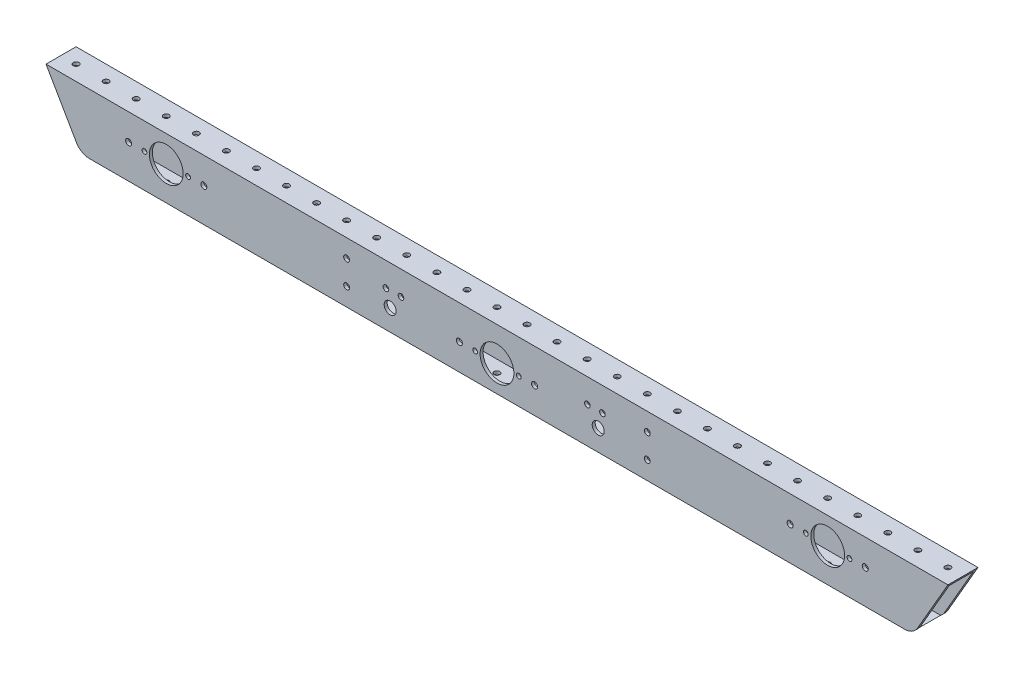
ISO-10303-21;
HEADER;
FILE_DESCRIPTION(('STEP AP214'),'2;1');
FILE_NAME('part.step','',(''),(''),'','','');
FILE_SCHEMA(('AUTOMOTIVE_DESIGN { 1 0 10303 214 1 1 1 1 }'));
ENDSEC;
DATA;
#1=APPLICATION_CONTEXT('core data for automotive mechanical design processes');
#2=APPLICATION_PROTOCOL_DEFINITION('international standard','automotive_design',2000,#1);
#3=PRODUCT_CONTEXT('',#1,'mechanical');
#4=PRODUCT('Part','Part','',(#3));
#5=PRODUCT_RELATED_PRODUCT_CATEGORY('part','',(#4));
#6=PRODUCT_DEFINITION_FORMATION('','',#4);
#7=PRODUCT_DEFINITION_CONTEXT('part definition',#1,'design');
#8=PRODUCT_DEFINITION('design','',#6,#7);
#9=PRODUCT_DEFINITION_SHAPE('','',#8);
#10=(LENGTH_UNIT() NAMED_UNIT(*) SI_UNIT(.MILLI.,.METRE.));
#11=(NAMED_UNIT(*) PLANE_ANGLE_UNIT() SI_UNIT($,.RADIAN.));
#12=(NAMED_UNIT(*) SI_UNIT($,.STERADIAN.) SOLID_ANGLE_UNIT());
#13=UNCERTAINTY_MEASURE_WITH_UNIT(LENGTH_MEASURE(1.E-05),#10,'distance_accuracy_value','');
#14=(GEOMETRIC_REPRESENTATION_CONTEXT(3) GLOBAL_UNCERTAINTY_ASSIGNED_CONTEXT((#13)) GLOBAL_UNIT_ASSIGNED_CONTEXT((#10,
#11,#12)) REPRESENTATION_CONTEXT('',''));
#15=CARTESIAN_POINT('',(0.,0.,0.));
#16=DIRECTION('',(0.,0.,1.));
#17=DIRECTION('',(1.,0.,0.));
#18=AXIS2_PLACEMENT_3D('',#15,#16,#17);
#19=CARTESIAN_POINT('',(-381.,-25.4,25.4));
#20=DIRECTION('',(0.,1.,0.));
#21=DIRECTION('',(-1.,0.,0.));
#22=AXIS2_PLACEMENT_3D('',#19,#20,#21);
#23=PLANE('',#22);
#24=DIRECTION('',(1.,0.,0.));
#25=VECTOR('',#24,1.);
#26=CARTESIAN_POINT('',(-381.,-25.4,25.4));
#27=LINE('',#26,#25);
#28=CARTESIAN_POINT('',(-344.338257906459,-25.4000000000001,25.4));
#29=VERTEX_POINT('',#28);
#30=CARTESIAN_POINT('',(344.338257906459,-25.4,25.4));
#31=VERTEX_POINT('',#30);
#32=EDGE_CURVE('E174',#29,#31,#27,.T.);
#33=ORIENTED_EDGE('',*,*,#32,.F.);
#34=DIRECTION('',(0.,0.,1.));
#35=VECTOR('',#34,1.);
#36=CARTESIAN_POINT('',(-344.338257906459,-25.4000000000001,0.));
#37=LINE('',#36,#35);
#38=CARTESIAN_POINT('',(-344.338257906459,-25.4000000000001,14.5978318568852));
#39=VERTEX_POINT('',#38);
#40=EDGE_CURVE('E644',#39,#29,#37,.T.);
#41=ORIENTED_EDGE('',*,*,#40,.F.);
#42=CARTESIAN_POINT('',(-342.9,-25.4,12.7000000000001));
#43=DIRECTION('',(0.,1.,0.));
#44=DIRECTION('',(0.,0.,1.));
#45=AXIS2_PLACEMENT_3D('',#42,#43,#44);
#46=CIRCLE('',#45,2.38125000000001);
#47=CARTESIAN_POINT('',(-344.338257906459,-25.4,10.802168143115));
#48=VERTEX_POINT('',#47);
#49=EDGE_CURVE('E197',#39,#48,#46,.T.);
#50=ORIENTED_EDGE('',*,*,#49,.T.);
#51=CARTESIAN_POINT('',(-344.338257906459,-25.4000000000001,0.));
#52=VERTEX_POINT('',#51);
#53=EDGE_CURVE('E621',#52,#48,#37,.T.);
#54=ORIENTED_EDGE('',*,*,#53,.F.);
#55=DIRECTION('',(1.,0.,0.));
#56=VECTOR('',#55,1.);
#57=CARTESIAN_POINT('',(-381.,-25.4,0.));
#58=LINE('',#57,#56);
#59=CARTESIAN_POINT('',(344.338257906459,-25.4,0.));
#60=VERTEX_POINT('',#59);
#61=EDGE_CURVE('E162',#52,#60,#58,.T.);
#62=ORIENTED_EDGE('',*,*,#61,.T.);
#63=DIRECTION('',(0.,0.,1.));
#64=VECTOR('',#63,1.);
#65=CARTESIAN_POINT('',(344.338257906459,-25.4,0.));
#66=LINE('',#65,#64);
#67=CARTESIAN_POINT('',(344.338257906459,-25.4,10.8021681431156));
#68=VERTEX_POINT('',#67);
#69=EDGE_CURVE('E618',#60,#68,#66,.T.);
#70=ORIENTED_EDGE('',*,*,#69,.T.);
#71=CARTESIAN_POINT('',(342.899999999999,-25.4,12.7000000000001));
#72=DIRECTION('',(0.,1.,0.));
#73=DIRECTION('',(0.,0.,1.));
#74=AXIS2_PLACEMENT_3D('',#71,#72,#73);
#75=CIRCLE('',#74,2.38125000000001);
#76=CARTESIAN_POINT('',(344.338257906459,-25.4,14.5978318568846));
#77=VERTEX_POINT('',#76);
#78=EDGE_CURVE('E192',#68,#77,#75,.T.);
#79=ORIENTED_EDGE('',*,*,#78,.T.);
#80=EDGE_CURVE('E646',#77,#31,#66,.T.);
#81=ORIENTED_EDGE('',*,*,#80,.T.);
#82=EDGE_LOOP('',(#33,#41,#50,#54,#62,#70,#79,#81));
#83=FACE_BOUND('',#82,.T.);
#84=CARTESIAN_POINT('',(-317.5,-25.4,12.7000000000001));
#85=DIRECTION('',(0.,1.,0.));
#86=DIRECTION('',(0.,0.,1.));
#87=AXIS2_PLACEMENT_3D('',#84,#85,#86);
#88=CIRCLE('',#87,2.38125000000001);
#89=CARTESIAN_POINT('',(-317.5,-25.4,15.0812500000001));
#90=VERTEX_POINT('',#89);
#91=EDGE_CURVE('E202',#90,#90,#88,.T.);
#92=ORIENTED_EDGE('',*,*,#91,.T.);
#93=EDGE_LOOP('',(#92));
#94=FACE_BOUND('',#93,.T.);
#95=CARTESIAN_POINT('',(-292.1,-25.4,12.7000000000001));
#96=DIRECTION('',(0.,1.,0.));
#97=DIRECTION('',(0.,0.,1.));
#98=AXIS2_PLACEMENT_3D('',#95,#96,#97);
#99=CIRCLE('',#98,2.38125000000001);
#100=CARTESIAN_POINT('',(-292.1,-25.4,15.0812500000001));
#101=VERTEX_POINT('',#100);
#102=EDGE_CURVE('E207',#101,#101,#99,.T.);
#103=ORIENTED_EDGE('',*,*,#102,.T.);
#104=EDGE_LOOP('',(#103));
#105=FACE_BOUND('',#104,.T.);
#106=CARTESIAN_POINT('',(-266.7,-25.4,12.7000000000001));
#107=DIRECTION('',(0.,1.,0.));
#108=DIRECTION('',(0.,0.,1.));
#109=AXIS2_PLACEMENT_3D('',#106,#107,#108);
#110=CIRCLE('',#109,2.38125000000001);
#111=CARTESIAN_POINT('',(-266.7,-25.4,15.0812500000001));
#112=VERTEX_POINT('',#111);
#113=EDGE_CURVE('E212',#112,#112,#110,.T.);
#114=ORIENTED_EDGE('',*,*,#113,.T.);
#115=EDGE_LOOP('',(#114));
#116=FACE_BOUND('',#115,.T.);
#117=CARTESIAN_POINT('',(-241.3,-25.4,12.7000000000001));
#118=DIRECTION('',(0.,1.,0.));
#119=DIRECTION('',(0.,0.,1.));
#120=AXIS2_PLACEMENT_3D('',#117,#118,#119);
#121=CIRCLE('',#120,2.38125000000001);
#122=CARTESIAN_POINT('',(-241.3,-25.4,15.0812500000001));
#123=VERTEX_POINT('',#122);
#124=EDGE_CURVE('E217',#123,#123,#121,.T.);
#125=ORIENTED_EDGE('',*,*,#124,.T.);
#126=EDGE_LOOP('',(#125));
#127=FACE_BOUND('',#126,.T.);
#128=CARTESIAN_POINT('',(-215.9,-25.4,12.7000000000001));
#129=DIRECTION('',(0.,1.,0.));
#130=DIRECTION('',(0.,0.,1.));
#131=AXIS2_PLACEMENT_3D('',#128,#129,#130);
#132=CIRCLE('',#131,2.38125000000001);
#133=CARTESIAN_POINT('',(-215.9,-25.4,15.0812500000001));
#134=VERTEX_POINT('',#133);
#135=EDGE_CURVE('E222',#134,#134,#132,.T.);
#136=ORIENTED_EDGE('',*,*,#135,.T.);
#137=EDGE_LOOP('',(#136));
#138=FACE_BOUND('',#137,.T.);
#139=CARTESIAN_POINT('',(-190.5,-25.4,12.7000000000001));
#140=DIRECTION('',(0.,1.,0.));
#141=DIRECTION('',(0.,0.,1.));
#142=AXIS2_PLACEMENT_3D('',#139,#140,#141);
#143=CIRCLE('',#142,2.38125000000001);
#144=CARTESIAN_POINT('',(-190.5,-25.4,15.0812500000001));
#145=VERTEX_POINT('',#144);
#146=EDGE_CURVE('E227',#145,#145,#143,.T.);
#147=ORIENTED_EDGE('',*,*,#146,.T.);
#148=EDGE_LOOP('',(#147));
#149=FACE_BOUND('',#148,.T.);
#150=CARTESIAN_POINT('',(-165.1,-25.4,12.7000000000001));
#151=DIRECTION('',(0.,1.,0.));
#152=DIRECTION('',(0.,0.,1.));
#153=AXIS2_PLACEMENT_3D('',#150,#151,#152);
#154=CIRCLE('',#153,2.38125000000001);
#155=CARTESIAN_POINT('',(-165.1,-25.4,15.0812500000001));
#156=VERTEX_POINT('',#155);
#157=EDGE_CURVE('E232',#156,#156,#154,.T.);
#158=ORIENTED_EDGE('',*,*,#157,.T.);
#159=EDGE_LOOP('',(#158));
#160=FACE_BOUND('',#159,.T.);
#161=CARTESIAN_POINT('',(-139.7,-25.4,12.7000000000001));
#162=DIRECTION('',(0.,1.,0.));
#163=DIRECTION('',(0.,0.,1.));
#164=AXIS2_PLACEMENT_3D('',#161,#162,#163);
#165=CIRCLE('',#164,2.38125000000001);
#166=CARTESIAN_POINT('',(-139.7,-25.4,15.0812500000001));
#167=VERTEX_POINT('',#166);
#168=EDGE_CURVE('E237',#167,#167,#165,.T.);
#169=ORIENTED_EDGE('',*,*,#168,.T.);
#170=EDGE_LOOP('',(#169));
#171=FACE_BOUND('',#170,.T.);
#172=CARTESIAN_POINT('',(-114.3,-25.4,12.7000000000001));
#173=DIRECTION('',(0.,1.,0.));
#174=DIRECTION('',(0.,0.,1.));
#175=AXIS2_PLACEMENT_3D('',#172,#173,#174);
#176=CIRCLE('',#175,2.38125000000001);
#177=CARTESIAN_POINT('',(-114.3,-25.4,15.0812500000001));
#178=VERTEX_POINT('',#177);
#179=EDGE_CURVE('E242',#178,#178,#176,.T.);
#180=ORIENTED_EDGE('',*,*,#179,.T.);
#181=EDGE_LOOP('',(#180));
#182=FACE_BOUND('',#181,.T.);
#183=CARTESIAN_POINT('',(-88.9000000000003,-25.4,12.7000000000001));
#184=DIRECTION('',(0.,1.,0.));
#185=DIRECTION('',(0.,0.,1.));
#186=AXIS2_PLACEMENT_3D('',#183,#184,#185);
#187=CIRCLE('',#186,2.38125000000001);
#188=CARTESIAN_POINT('',(-88.9000000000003,-25.4,15.0812500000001));
#189=VERTEX_POINT('',#188);
#190=EDGE_CURVE('E247',#189,#189,#187,.T.);
#191=ORIENTED_EDGE('',*,*,#190,.T.);
#192=EDGE_LOOP('',(#191));
#193=FACE_BOUND('',#192,.T.);
#194=CARTESIAN_POINT('',(-63.5000000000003,-25.4,12.7000000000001));
#195=DIRECTION('',(0.,1.,0.));
#196=DIRECTION('',(0.,0.,1.));
#197=AXIS2_PLACEMENT_3D('',#194,#195,#196);
#198=CIRCLE('',#197,2.38125000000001);
#199=CARTESIAN_POINT('',(-63.5000000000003,-25.4,15.0812500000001));
#200=VERTEX_POINT('',#199);
#201=EDGE_CURVE('E252',#200,#200,#198,.T.);
#202=ORIENTED_EDGE('',*,*,#201,.T.);
#203=EDGE_LOOP('',(#202));
#204=FACE_BOUND('',#203,.T.);
#205=CARTESIAN_POINT('',(-38.1000000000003,-25.4,12.7000000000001));
#206=DIRECTION('',(0.,1.,0.));
#207=DIRECTION('',(0.,0.,1.));
#208=AXIS2_PLACEMENT_3D('',#205,#206,#207);
#209=CIRCLE('',#208,2.38125000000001);
#210=CARTESIAN_POINT('',(-38.1000000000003,-25.4,15.0812500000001));
#211=VERTEX_POINT('',#210);
#212=EDGE_CURVE('E257',#211,#211,#209,.T.);
#213=ORIENTED_EDGE('',*,*,#212,.T.);
#214=EDGE_LOOP('',(#213));
#215=FACE_BOUND('',#214,.T.);
#216=CARTESIAN_POINT('',(-12.7000000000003,-25.4,12.7000000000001));
#217=DIRECTION('',(0.,1.,0.));
#218=DIRECTION('',(0.,0.,1.));
#219=AXIS2_PLACEMENT_3D('',#216,#217,#218);
#220=CIRCLE('',#219,2.38125000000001);
#221=CARTESIAN_POINT('',(-12.7000000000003,-25.4,15.0812500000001));
#222=VERTEX_POINT('',#221);
#223=EDGE_CURVE('E262',#222,#222,#220,.T.);
#224=ORIENTED_EDGE('',*,*,#223,.T.);
#225=EDGE_LOOP('',(#224));
#226=FACE_BOUND('',#225,.T.);
#227=CARTESIAN_POINT('',(12.6999999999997,-25.4,12.7000000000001));
#228=DIRECTION('',(0.,1.,0.));
#229=DIRECTION('',(0.,0.,1.));
#230=AXIS2_PLACEMENT_3D('',#227,#228,#229);
#231=CIRCLE('',#230,2.38125000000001);
#232=CARTESIAN_POINT('',(12.6999999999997,-25.4,15.0812500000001));
#233=VERTEX_POINT('',#232);
#234=EDGE_CURVE('E267',#233,#233,#231,.T.);
#235=ORIENTED_EDGE('',*,*,#234,.T.);
#236=EDGE_LOOP('',(#235));
#237=FACE_BOUND('',#236,.T.);
#238=CARTESIAN_POINT('',(38.0999999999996,-25.4,12.7000000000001));
#239=DIRECTION('',(0.,1.,0.));
#240=DIRECTION('',(0.,0.,1.));
#241=AXIS2_PLACEMENT_3D('',#238,#239,#240);
#242=CIRCLE('',#241,2.38125000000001);
#243=CARTESIAN_POINT('',(38.0999999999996,-25.4,15.0812500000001));
#244=VERTEX_POINT('',#243);
#245=EDGE_CURVE('E272',#244,#244,#242,.T.);
#246=ORIENTED_EDGE('',*,*,#245,.T.);
#247=EDGE_LOOP('',(#246));
#248=FACE_BOUND('',#247,.T.);
#249=CARTESIAN_POINT('',(63.4999999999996,-25.4,12.7000000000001));
#250=DIRECTION('',(0.,1.,0.));
#251=DIRECTION('',(0.,0.,1.));
#252=AXIS2_PLACEMENT_3D('',#249,#250,#251);
#253=CIRCLE('',#252,2.38125000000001);
#254=CARTESIAN_POINT('',(63.4999999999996,-25.4,15.0812500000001));
#255=VERTEX_POINT('',#254);
#256=EDGE_CURVE('E277',#255,#255,#253,.T.);
#257=ORIENTED_EDGE('',*,*,#256,.T.);
#258=EDGE_LOOP('',(#257));
#259=FACE_BOUND('',#258,.T.);
#260=CARTESIAN_POINT('',(88.8999999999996,-25.4,12.7000000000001));
#261=DIRECTION('',(0.,1.,0.));
#262=DIRECTION('',(0.,0.,1.));
#263=AXIS2_PLACEMENT_3D('',#260,#261,#262);
#264=CIRCLE('',#263,2.38125000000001);
#265=CARTESIAN_POINT('',(88.8999999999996,-25.4,15.0812500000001));
#266=VERTEX_POINT('',#265);
#267=EDGE_CURVE('E282',#266,#266,#264,.T.);
#268=ORIENTED_EDGE('',*,*,#267,.T.);
#269=EDGE_LOOP('',(#268));
#270=FACE_BOUND('',#269,.T.);
#271=CARTESIAN_POINT('',(114.3,-25.4,12.7000000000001));
#272=DIRECTION('',(0.,1.,0.));
#273=DIRECTION('',(0.,0.,1.));
#274=AXIS2_PLACEMENT_3D('',#271,#272,#273);
#275=CIRCLE('',#274,2.38125000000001);
#276=CARTESIAN_POINT('',(114.3,-25.4,15.0812500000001));
#277=VERTEX_POINT('',#276);
#278=EDGE_CURVE('E287',#277,#277,#275,.T.);
#279=ORIENTED_EDGE('',*,*,#278,.T.);
#280=EDGE_LOOP('',(#279));
#281=FACE_BOUND('',#280,.T.);
#282=CARTESIAN_POINT('',(139.7,-25.4,12.7000000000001));
#283=DIRECTION('',(0.,1.,0.));
#284=DIRECTION('',(0.,0.,1.));
#285=AXIS2_PLACEMENT_3D('',#282,#283,#284);
#286=CIRCLE('',#285,2.38125000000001);
#287=CARTESIAN_POINT('',(139.7,-25.4,15.0812500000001));
#288=VERTEX_POINT('',#287);
#289=EDGE_CURVE('E292',#288,#288,#286,.T.);
#290=ORIENTED_EDGE('',*,*,#289,.T.);
#291=EDGE_LOOP('',(#290));
#292=FACE_BOUND('',#291,.T.);
#293=CARTESIAN_POINT('',(165.1,-25.4,12.7000000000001));
#294=DIRECTION('',(0.,1.,0.));
#295=DIRECTION('',(0.,0.,1.));
#296=AXIS2_PLACEMENT_3D('',#293,#294,#295);
#297=CIRCLE('',#296,2.38125000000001);
#298=CARTESIAN_POINT('',(165.1,-25.4,15.0812500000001));
#299=VERTEX_POINT('',#298);
#300=EDGE_CURVE('E297',#299,#299,#297,.T.);
#301=ORIENTED_EDGE('',*,*,#300,.T.);
#302=EDGE_LOOP('',(#301));
#303=FACE_BOUND('',#302,.T.);
#304=CARTESIAN_POINT('',(190.5,-25.4,12.7000000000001));
#305=DIRECTION('',(0.,1.,0.));
#306=DIRECTION('',(0.,0.,1.));
#307=AXIS2_PLACEMENT_3D('',#304,#305,#306);
#308=CIRCLE('',#307,2.38125000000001);
#309=CARTESIAN_POINT('',(190.5,-25.4,15.0812500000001));
#310=VERTEX_POINT('',#309);
#311=EDGE_CURVE('E302',#310,#310,#308,.T.);
#312=ORIENTED_EDGE('',*,*,#311,.T.);
#313=EDGE_LOOP('',(#312));
#314=FACE_BOUND('',#313,.T.);
#315=CARTESIAN_POINT('',(215.899999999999,-25.4,12.7000000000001));
#316=DIRECTION('',(0.,1.,0.));
#317=DIRECTION('',(0.,0.,1.));
#318=AXIS2_PLACEMENT_3D('',#315,#316,#317);
#319=CIRCLE('',#318,2.38125000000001);
#320=CARTESIAN_POINT('',(215.899999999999,-25.4,15.0812500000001));
#321=VERTEX_POINT('',#320);
#322=EDGE_CURVE('E307',#321,#321,#319,.T.);
#323=ORIENTED_EDGE('',*,*,#322,.T.);
#324=EDGE_LOOP('',(#323));
#325=FACE_BOUND('',#324,.T.);
#326=CARTESIAN_POINT('',(241.299999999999,-25.4,12.7000000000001));
#327=DIRECTION('',(0.,1.,0.));
#328=DIRECTION('',(0.,0.,1.));
#329=AXIS2_PLACEMENT_3D('',#326,#327,#328);
#330=CIRCLE('',#329,2.38125000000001);
#331=CARTESIAN_POINT('',(241.299999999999,-25.4,15.0812500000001));
#332=VERTEX_POINT('',#331);
#333=EDGE_CURVE('E312',#332,#332,#330,.T.);
#334=ORIENTED_EDGE('',*,*,#333,.T.);
#335=EDGE_LOOP('',(#334));
#336=FACE_BOUND('',#335,.T.);
#337=CARTESIAN_POINT('',(266.699999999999,-25.4,12.7000000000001));
#338=DIRECTION('',(0.,1.,0.));
#339=DIRECTION('',(0.,0.,1.));
#340=AXIS2_PLACEMENT_3D('',#337,#338,#339);
#341=CIRCLE('',#340,2.38125000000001);
#342=CARTESIAN_POINT('',(266.699999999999,-25.4,15.0812500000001));
#343=VERTEX_POINT('',#342);
#344=EDGE_CURVE('E317',#343,#343,#341,.T.);
#345=ORIENTED_EDGE('',*,*,#344,.T.);
#346=EDGE_LOOP('',(#345));
#347=FACE_BOUND('',#346,.T.);
#348=CARTESIAN_POINT('',(292.099999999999,-25.4,12.7000000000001));
#349=DIRECTION('',(0.,1.,0.));
#350=DIRECTION('',(0.,0.,1.));
#351=AXIS2_PLACEMENT_3D('',#348,#349,#350);
#352=CIRCLE('',#351,2.38125000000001);
#353=CARTESIAN_POINT('',(292.099999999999,-25.4,15.0812500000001));
#354=VERTEX_POINT('',#353);
#355=EDGE_CURVE('E322',#354,#354,#352,.T.);
#356=ORIENTED_EDGE('',*,*,#355,.T.);
#357=EDGE_LOOP('',(#356));
#358=FACE_BOUND('',#357,.T.);
#359=CARTESIAN_POINT('',(317.499999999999,-25.4,12.7000000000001));
#360=DIRECTION('',(0.,1.,0.));
#361=DIRECTION('',(0.,0.,1.));
#362=AXIS2_PLACEMENT_3D('',#359,#360,#361);
#363=CIRCLE('',#362,2.38125000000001);
#364=CARTESIAN_POINT('',(317.499999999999,-25.4,15.0812500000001));
#365=VERTEX_POINT('',#364);
#366=EDGE_CURVE('E326',#365,#365,#363,.T.);
#367=ORIENTED_EDGE('',*,*,#366,.T.);
#368=EDGE_LOOP('',(#367));
#369=FACE_BOUND('',#368,.T.);
#370=ADVANCED_FACE('F34',(#83,#94,#105,#116,#127,#138,#149,#160,#171,#182,#193,#204,#215,#226,
#237,#248,#259,#270,#281,#292,#303,#314,#325,#336,#347,#358,#369),#23,.F.);
#371=CARTESIAN_POINT('',(-279.4,3.17499999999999,25.4));
#372=DIRECTION('',(0.,0.,-1.));
#373=DIRECTION('',(-1.,0.,0.));
#374=AXIS2_PLACEMENT_3D('',#371,#372,#373);
#375=CYLINDRICAL_SURFACE('',#374,14.2748);
#376=CARTESIAN_POINT('',(-279.4,3.17499999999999,22.86));
#377=DIRECTION('',(0.,0.,1.));
#378=DIRECTION('',(1.,0.,0.));
#379=AXIS2_PLACEMENT_3D('',#376,#377,#378);
#380=CIRCLE('',#379,14.2748);
#381=CARTESIAN_POINT('',(-265.1252,3.17499999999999,22.86));
#382=VERTEX_POINT('',#381);
#383=EDGE_CURVE('E591',#382,#382,#380,.T.);
#384=ORIENTED_EDGE('',*,*,#383,.F.);
#385=EDGE_LOOP('',(#384));
#386=FACE_BOUND('',#385,.T.);
#387=CARTESIAN_POINT('',(-279.4,3.17499999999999,25.4));
#388=DIRECTION('',(0.,0.,1.));
#389=DIRECTION('',(1.,0.,0.));
#390=AXIS2_PLACEMENT_3D('',#387,#388,#389);
#391=CIRCLE('',#390,14.2748);
#392=CARTESIAN_POINT('',(-265.1252,3.17499999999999,25.4));
#393=VERTEX_POINT('',#392);
#394=EDGE_CURVE('E163',#393,#393,#391,.T.);
#395=ORIENTED_EDGE('',*,*,#394,.T.);
#396=EDGE_LOOP('',(#395));
#397=FACE_BOUND('',#396,.T.);
#398=ADVANCED_FACE('F496',(#386,#397),#375,.F.);
#399=CARTESIAN_POINT('',(0.,-3.175,25.4));
#400=DIRECTION('',(0.,0.,-1.));
#401=DIRECTION('',(-1.,0.,0.));
#402=AXIS2_PLACEMENT_3D('',#399,#400,#401);
#403=CYLINDRICAL_SURFACE('',#402,14.2748);
#404=CARTESIAN_POINT('',(0.,-3.175,22.86));
#405=DIRECTION('',(0.,0.,1.));
#406=DIRECTION('',(1.,0.,0.));
#407=AXIS2_PLACEMENT_3D('',#404,#405,#406);
#408=CIRCLE('',#407,14.2748);
#409=CARTESIAN_POINT('',(14.2748,-3.175,22.86));
#410=VERTEX_POINT('',#409);
#411=EDGE_CURVE('E186',#410,#410,#408,.T.);
#412=ORIENTED_EDGE('',*,*,#411,.F.);
#413=EDGE_LOOP('',(#412));
#414=FACE_BOUND('',#413,.T.);
#415=CARTESIAN_POINT('',(0.,-3.175,25.4));
#416=DIRECTION('',(0.,0.,1.));
#417=DIRECTION('',(1.,0.,0.));
#418=AXIS2_PLACEMENT_3D('',#415,#416,#417);
#419=CIRCLE('',#418,14.2748);
#420=CARTESIAN_POINT('',(14.2748,-3.175,25.4));
#421=VERTEX_POINT('',#420);
#422=EDGE_CURVE('E601',#421,#421,#419,.T.);
#423=ORIENTED_EDGE('',*,*,#422,.T.);
#424=EDGE_LOOP('',(#423));
#425=FACE_BOUND('',#424,.T.);
#426=ADVANCED_FACE('F501',(#414,#425),#403,.F.);
#427=CARTESIAN_POINT('',(279.4,3.17499999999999,25.4));
#428=DIRECTION('',(0.,0.,-1.));
#429=DIRECTION('',(-1.,0.,0.));
#430=AXIS2_PLACEMENT_3D('',#427,#428,#429);
#431=CYLINDRICAL_SURFACE('',#430,14.2748);
#432=CARTESIAN_POINT('',(279.4,3.17499999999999,22.86));
#433=DIRECTION('',(0.,0.,1.));
#434=DIRECTION('',(1.,0.,0.));
#435=AXIS2_PLACEMENT_3D('',#432,#433,#434);
#436=CIRCLE('',#435,14.2748);
#437=CARTESIAN_POINT('',(293.6748,3.17499999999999,22.86));
#438=VERTEX_POINT('',#437);
#439=EDGE_CURVE('E183',#438,#438,#436,.T.);
#440=ORIENTED_EDGE('',*,*,#439,.F.);
#441=EDGE_LOOP('',(#440));
#442=FACE_BOUND('',#441,.T.);
#443=CARTESIAN_POINT('',(279.4,3.17499999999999,25.4));
#444=DIRECTION('',(0.,0.,1.));
#445=DIRECTION('',(1.,0.,0.));
#446=AXIS2_PLACEMENT_3D('',#443,#444,#445);
#447=CIRCLE('',#446,14.2748);
#448=CARTESIAN_POINT('',(293.6748,3.17499999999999,25.4));
#449=VERTEX_POINT('',#448);
#450=EDGE_CURVE('E595',#449,#449,#447,.T.);
#451=ORIENTED_EDGE('',*,*,#450,.T.);
#452=EDGE_LOOP('',(#451));
#453=FACE_BOUND('',#452,.T.);
#454=ADVANCED_FACE('F513',(#442,#453),#431,.F.);
#455=CARTESIAN_POINT('',(0.,0.,25.4));
#456=DIRECTION('',(0.,0.,-1.));
#457=DIRECTION('',(-1.,0.,0.));
#458=AXIS2_PLACEMENT_3D('',#455,#456,#457);
#459=PLANE('',#458);
#460=CARTESIAN_POINT('',(297.8277,3.175,25.4));
#461=DIRECTION('',(0.,0.,1.));
#462=DIRECTION('',(1.,0.,0.));
#463=AXIS2_PLACEMENT_3D('',#460,#461,#462);
#464=CIRCLE('',#463,2.01929999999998);
#465=CARTESIAN_POINT('',(299.847,3.175,25.4));
#466=VERTEX_POINT('',#465);
#467=EDGE_CURVE('E1250',#466,#466,#464,.T.);
#468=ORIENTED_EDGE('',*,*,#467,.F.);
#469=EDGE_LOOP('',(#468));
#470=FACE_BOUND('',#469,.T.);
#471=CARTESIAN_POINT('',(260.9723,3.17499999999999,25.4));
#472=DIRECTION('',(0.,0.,1.));
#473=DIRECTION('',(1.,0.,0.));
#474=AXIS2_PLACEMENT_3D('',#471,#472,#473);
#475=CIRCLE('',#474,2.01929999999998);
#476=CARTESIAN_POINT('',(262.9916,3.17499999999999,25.4));
#477=VERTEX_POINT('',#476);
#478=EDGE_CURVE('E978',#477,#477,#475,.T.);
#479=ORIENTED_EDGE('',*,*,#478,.F.);
#480=EDGE_LOOP('',(#479));
#481=FACE_BOUND('',#480,.T.);
#482=CARTESIAN_POINT('',(18.4277,-3.175,25.4));
#483=DIRECTION('',(0.,0.,1.));
#484=DIRECTION('',(1.,0.,0.));
#485=AXIS2_PLACEMENT_3D('',#482,#483,#484);
#486=CIRCLE('',#485,2.0193);
#487=CARTESIAN_POINT('',(20.447,-3.175,25.4));
#488=VERTEX_POINT('',#487);
#489=EDGE_CURVE('E975',#488,#488,#486,.T.);
#490=ORIENTED_EDGE('',*,*,#489,.F.);
#491=EDGE_LOOP('',(#490));
#492=FACE_BOUND('',#491,.T.);
#493=CARTESIAN_POINT('',(-18.4277,-3.175,25.4));
#494=DIRECTION('',(0.,0.,1.));
#495=DIRECTION('',(1.,0.,0.));
#496=AXIS2_PLACEMENT_3D('',#493,#494,#495);
#497=CIRCLE('',#496,2.0193);
#498=CARTESIAN_POINT('',(-16.4084,-3.175,25.4));
#499=VERTEX_POINT('',#498);
#500=EDGE_CURVE('E994',#499,#499,#497,.T.);
#501=ORIENTED_EDGE('',*,*,#500,.F.);
#502=EDGE_LOOP('',(#501));
#503=FACE_BOUND('',#502,.T.);
#504=CARTESIAN_POINT('',(-260.9723,3.17499999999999,25.4));
#505=DIRECTION('',(0.,0.,1.));
#506=DIRECTION('',(1.,0.,0.));
#507=AXIS2_PLACEMENT_3D('',#504,#505,#506);
#508=CIRCLE('',#507,2.01929999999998);
#509=CARTESIAN_POINT('',(-258.953,3.17499999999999,25.4));
#510=VERTEX_POINT('',#509);
#511=EDGE_CURVE('E1001',#510,#510,#508,.T.);
#512=ORIENTED_EDGE('',*,*,#511,.F.);
#513=EDGE_LOOP('',(#512));
#514=FACE_BOUND('',#513,.T.);
#515=CARTESIAN_POINT('',(-297.8277,3.17499999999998,25.4));
#516=DIRECTION('',(0.,0.,1.));
#517=DIRECTION('',(1.,0.,0.));
#518=AXIS2_PLACEMENT_3D('',#515,#516,#517);
#519=CIRCLE('',#518,2.01929999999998);
#520=CARTESIAN_POINT('',(-295.8084,3.17499999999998,25.4));
#521=VERTEX_POINT('',#520);
#522=EDGE_CURVE('E1008',#521,#521,#519,.T.);
#523=ORIENTED_EDGE('',*,*,#522,.F.);
#524=EDGE_LOOP('',(#523));
#525=FACE_BOUND('',#524,.T.);
#526=CARTESIAN_POINT('',(311.15,3.175,25.4));
#527=DIRECTION('',(0.,0.,1.));
#528=DIRECTION('',(1.,0.,0.));
#529=AXIS2_PLACEMENT_3D('',#526,#527,#528);
#530=CIRCLE('',#529,2.55270000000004);
#531=CARTESIAN_POINT('',(313.7027,3.175,25.4));
#532=VERTEX_POINT('',#531);
#533=EDGE_CURVE('E1015',#532,#532,#530,.T.);
#534=ORIENTED_EDGE('',*,*,#533,.F.);
#535=EDGE_LOOP('',(#534));
#536=FACE_BOUND('',#535,.T.);
#537=CARTESIAN_POINT('',(247.65,3.17499999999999,25.4));
#538=DIRECTION('',(0.,0.,1.));
#539=DIRECTION('',(1.,0.,0.));
#540=AXIS2_PLACEMENT_3D('',#537,#538,#539);
#541=CIRCLE('',#540,2.55270000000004);
#542=CARTESIAN_POINT('',(250.2027,3.17499999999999,25.4));
#543=VERTEX_POINT('',#542);
#544=EDGE_CURVE('E1022',#543,#543,#541,.T.);
#545=ORIENTED_EDGE('',*,*,#544,.F.);
#546=EDGE_LOOP('',(#545));
#547=FACE_BOUND('',#546,.T.);
#548=CARTESIAN_POINT('',(31.75,-3.175,25.4));
#549=DIRECTION('',(0.,0.,1.));
#550=DIRECTION('',(1.,0.,0.));
#551=AXIS2_PLACEMENT_3D('',#548,#549,#550);
#552=CIRCLE('',#551,2.5527);
#553=CARTESIAN_POINT('',(34.3027,-3.175,25.4));
#554=VERTEX_POINT('',#553);
#555=EDGE_CURVE('E1029',#554,#554,#552,.T.);
#556=ORIENTED_EDGE('',*,*,#555,.F.);
#557=EDGE_LOOP('',(#556));
#558=FACE_BOUND('',#557,.T.);
#559=CARTESIAN_POINT('',(-31.75,-3.175,25.4));
#560=DIRECTION('',(0.,0.,1.));
#561=DIRECTION('',(1.,0.,0.));
#562=AXIS2_PLACEMENT_3D('',#559,#560,#561);
#563=CIRCLE('',#562,2.5527);
#564=CARTESIAN_POINT('',(-29.1973,-3.175,25.4));
#565=VERTEX_POINT('',#564);
#566=EDGE_CURVE('E1036',#565,#565,#563,.T.);
#567=ORIENTED_EDGE('',*,*,#566,.F.);
#568=EDGE_LOOP('',(#567));
#569=FACE_BOUND('',#568,.T.);
#570=CARTESIAN_POINT('',(-247.65,3.17500000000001,25.4));
#571=DIRECTION('',(0.,0.,1.));
#572=DIRECTION('',(1.,0.,0.));
#573=AXIS2_PLACEMENT_3D('',#570,#571,#572);
#574=CIRCLE('',#573,2.55269999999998);
#575=CARTESIAN_POINT('',(-245.0973,3.17500000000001,25.4));
#576=VERTEX_POINT('',#575);
#577=EDGE_CURVE('E1043',#576,#576,#574,.T.);
#578=ORIENTED_EDGE('',*,*,#577,.F.);
#579=EDGE_LOOP('',(#578));
#580=FACE_BOUND('',#579,.T.);
#581=CARTESIAN_POINT('',(-311.15,3.17499999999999,25.4));
#582=DIRECTION('',(0.,0.,1.));
#583=DIRECTION('',(1.,0.,0.));
#584=AXIS2_PLACEMENT_3D('',#581,#582,#583);
#585=CIRCLE('',#584,2.55270000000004);
#586=CARTESIAN_POINT('',(-308.5973,3.17499999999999,25.4));
#587=VERTEX_POINT('',#586);
#588=EDGE_CURVE('E1050',#587,#587,#585,.T.);
#589=ORIENTED_EDGE('',*,*,#588,.F.);
#590=EDGE_LOOP('',(#589));
#591=FACE_BOUND('',#590,.T.);
#592=CARTESIAN_POINT('',(85.536004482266,-7.61770629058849,25.4));
#593=DIRECTION('',(0.,0.,1.));
#594=DIRECTION('',(1.,0.,0.));
#595=AXIS2_PLACEMENT_3D('',#592,#593,#594);
#596=CIRCLE('',#595,5.08000000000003);
#597=CARTESIAN_POINT('',(90.616004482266,-7.61770629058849,25.4));
#598=VERTEX_POINT('',#597);
#599=EDGE_CURVE('E1057',#598,#598,#596,.T.);
#600=ORIENTED_EDGE('',*,*,#599,.F.);
#601=EDGE_LOOP('',(#600));
#602=FACE_BOUND('',#601,.T.);
#603=CARTESIAN_POINT('',(89.0920044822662,5.08229370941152,25.4));
#604=DIRECTION('',(0.,0.,1.));
#605=DIRECTION('',(1.,0.,0.));
#606=AXIS2_PLACEMENT_3D('',#603,#604,#605);
#607=CIRCLE('',#606,2.38125000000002);
#608=CARTESIAN_POINT('',(91.4732544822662,5.08229370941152,25.4));
#609=VERTEX_POINT('',#608);
#610=EDGE_CURVE('E1064',#609,#609,#607,.T.);
#611=ORIENTED_EDGE('',*,*,#610,.F.);
#612=EDGE_LOOP('',(#611));
#613=FACE_BOUND('',#612,.T.);
#614=CARTESIAN_POINT('',(76.3920044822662,5.08229370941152,25.4));
#615=DIRECTION('',(0.,0.,1.));
#616=DIRECTION('',(1.,0.,0.));
#617=AXIS2_PLACEMENT_3D('',#614,#615,#616);
#618=CIRCLE('',#617,2.38125000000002);
#619=CARTESIAN_POINT('',(78.7732544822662,5.08229370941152,25.4));
#620=VERTEX_POINT('',#619);
#621=EDGE_CURVE('E1071',#620,#620,#618,.T.);
#622=ORIENTED_EDGE('',*,*,#621,.F.);
#623=EDGE_LOOP('',(#622));
#624=FACE_BOUND('',#623,.T.);
#625=CARTESIAN_POINT('',(-93.7879955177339,5.08229370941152,25.4));
#626=DIRECTION('',(0.,0.,1.));
#627=DIRECTION('',(1.,0.,0.));
#628=AXIS2_PLACEMENT_3D('',#625,#626,#627);
#629=CIRCLE('',#628,2.38125000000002);
#630=CARTESIAN_POINT('',(-91.4067455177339,5.08229370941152,25.4));
#631=VERTEX_POINT('',#630);
#632=EDGE_CURVE('E1078',#631,#631,#629,.T.);
#633=ORIENTED_EDGE('',*,*,#632,.F.);
#634=EDGE_LOOP('',(#633));
#635=FACE_BOUND('',#634,.T.);
#636=CARTESIAN_POINT('',(-81.0879955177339,5.08229370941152,25.4));
#637=DIRECTION('',(0.,0.,1.));
#638=DIRECTION('',(1.,0.,0.));
#639=AXIS2_PLACEMENT_3D('',#636,#637,#638);
#640=CIRCLE('',#639,2.38125000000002);
#641=CARTESIAN_POINT('',(-78.7067455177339,5.08229370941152,25.4));
#642=VERTEX_POINT('',#641);
#643=EDGE_CURVE('E1085',#642,#642,#640,.T.);
#644=ORIENTED_EDGE('',*,*,#643,.F.);
#645=EDGE_LOOP('',(#644));
#646=FACE_BOUND('',#645,.T.);
#647=CARTESIAN_POINT('',(-90.2319955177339,-7.61770629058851,25.4));
#648=DIRECTION('',(0.,0.,1.));
#649=DIRECTION('',(1.,0.,0.));
#650=AXIS2_PLACEMENT_3D('',#647,#648,#649);
#651=CIRCLE('',#650,5.08);
#652=CARTESIAN_POINT('',(-85.1519955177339,-7.61770629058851,25.4));
#653=VERTEX_POINT('',#652);
#654=EDGE_CURVE('E1092',#653,#653,#651,.T.);
#655=ORIENTED_EDGE('',*,*,#654,.F.);
#656=EDGE_LOOP('',(#655));
#657=FACE_BOUND('',#656,.T.);
#658=CARTESIAN_POINT('',(-127.,-10.16,25.4));
#659=DIRECTION('',(0.,0.,-1.));
#660=DIRECTION('',(-1.,0.,0.));
#661=AXIS2_PLACEMENT_3D('',#658,#659,#660);
#662=CIRCLE('',#661,2.4892);
#663=CARTESIAN_POINT('',(-129.4892,-10.16,25.4));
#664=VERTEX_POINT('',#663);
#665=EDGE_CURVE('E1099',#664,#664,#662,.T.);
#666=ORIENTED_EDGE('',*,*,#665,.T.);
#667=EDGE_LOOP('',(#666));
#668=FACE_BOUND('',#667,.T.);
#669=CARTESIAN_POINT('',(-127.,10.16,25.4));
#670=DIRECTION('',(0.,0.,-1.));
#671=DIRECTION('',(-1.,0.,0.));
#672=AXIS2_PLACEMENT_3D('',#669,#670,#671);
#673=CIRCLE('',#672,2.4892);
#674=CARTESIAN_POINT('',(-129.4892,10.16,25.4));
#675=VERTEX_POINT('',#674);
#676=EDGE_CURVE('E1106',#675,#675,#673,.T.);
#677=ORIENTED_EDGE('',*,*,#676,.T.);
#678=EDGE_LOOP('',(#677));
#679=FACE_BOUND('',#678,.T.);
#680=CARTESIAN_POINT('',(127.,-10.16,25.4));
#681=DIRECTION('',(0.,0.,1.));
#682=DIRECTION('',(1.,0.,0.));
#683=AXIS2_PLACEMENT_3D('',#680,#681,#682);
#684=CIRCLE('',#683,2.4892);
#685=CARTESIAN_POINT('',(129.4892,-10.16,25.4));
#686=VERTEX_POINT('',#685);
#687=EDGE_CURVE('E1113',#686,#686,#684,.T.);
#688=ORIENTED_EDGE('',*,*,#687,.F.);
#689=EDGE_LOOP('',(#688));
#690=FACE_BOUND('',#689,.T.);
#691=CARTESIAN_POINT('',(127.,10.16,25.4));
#692=DIRECTION('',(0.,0.,1.));
#693=DIRECTION('',(1.,0.,0.));
#694=AXIS2_PLACEMENT_3D('',#691,#692,#693);
#695=CIRCLE('',#694,2.4892);
#696=CARTESIAN_POINT('',(129.4892,10.16,25.4));
#697=VERTEX_POINT('',#696);
#698=EDGE_CURVE('E1120',#697,#697,#695,.T.);
#699=ORIENTED_EDGE('',*,*,#698,.F.);
#700=EDGE_LOOP('',(#699));
#701=FACE_BOUND('',#700,.T.);
#702=DIRECTION('',(-1.,0.,0.));
#703=VECTOR('',#702,1.);
#704=CARTESIAN_POINT('',(-381.,25.4,25.4));
#705=LINE('',#704,#703);
#706=CARTESIAN_POINT('',(381.,25.4000000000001,25.4));
#707=VERTEX_POINT('',#706);
#708=CARTESIAN_POINT('',(-381.,25.4,25.4));
#709=VERTEX_POINT('',#708);
#710=EDGE_CURVE('E167',#707,#709,#705,.T.);
#711=ORIENTED_EDGE('',*,*,#710,.T.);
#712=DIRECTION('',(-0.499999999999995,0.866025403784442,0.));
#713=VECTOR('',#712,1.);
#714=CARTESIAN_POINT('',(-381.,25.4,25.4));
#715=LINE('',#714,#713);
#716=CARTESIAN_POINT('',(-355.336780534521,-19.05,25.4));
#717=VERTEX_POINT('',#716);
#718=EDGE_CURVE('E150',#717,#709,#715,.T.);
#719=ORIENTED_EDGE('',*,*,#718,.F.);
#720=CARTESIAN_POINT('',(-344.338257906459,-12.7000000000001,25.4));
#721=DIRECTION('',(0.,0.,-1.));
#722=DIRECTION('',(1.,0.,0.));
#723=AXIS2_PLACEMENT_3D('',#720,#721,#722);
#724=CIRCLE('',#723,12.7);
#725=EDGE_CURVE('E634',#29,#717,#724,.T.);
#726=ORIENTED_EDGE('',*,*,#725,.F.);
#727=ORIENTED_EDGE('',*,*,#32,.T.);
#728=CARTESIAN_POINT('',(344.338257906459,-12.7,25.4));
#729=DIRECTION('',(0.,0.,-1.));
#730=DIRECTION('',(-1.,0.,0.));
#731=AXIS2_PLACEMENT_3D('',#728,#729,#730);
#732=CIRCLE('',#731,12.7);
#733=CARTESIAN_POINT('',(355.336780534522,-19.0499999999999,25.4));
#734=VERTEX_POINT('',#733);
#735=EDGE_CURVE('E631',#734,#31,#732,.T.);
#736=ORIENTED_EDGE('',*,*,#735,.F.);
#737=DIRECTION('',(-0.499999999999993,-0.866025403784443,0.));
#738=VECTOR('',#737,1.);
#739=CARTESIAN_POINT('',(381.,25.4000000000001,25.4));
#740=LINE('',#739,#738);
#741=EDGE_CURVE('E629',#707,#734,#740,.T.);
#742=ORIENTED_EDGE('',*,*,#741,.F.);
#743=EDGE_LOOP('',(#711,#719,#726,#727,#736,#742));
#744=FACE_BOUND('',#743,.T.);
#745=ORIENTED_EDGE('',*,*,#394,.F.);
#746=EDGE_LOOP('',(#745));
#747=FACE_BOUND('',#746,.T.);
#748=ORIENTED_EDGE('',*,*,#422,.F.);
#749=EDGE_LOOP('',(#748));
#750=FACE_BOUND('',#749,.T.);
#751=ORIENTED_EDGE('',*,*,#450,.F.);
#752=EDGE_LOOP('',(#751));
#753=FACE_BOUND('',#752,.T.);
#754=ADVANCED_FACE('F510',(#470,#481,#492,#503,#514,#525,#536,#547,#558,#569,#580,#591,#602,
#613,#624,#635,#646,#657,#668,#679,#690,#701,#744,#747,#750,#753),#459,.F.);
#755=CARTESIAN_POINT('',(0.,0.,0.));
#756=DIRECTION('',(0.,0.,-1.));
#757=DIRECTION('',(-1.,0.,0.));
#758=AXIS2_PLACEMENT_3D('',#755,#756,#757);
#759=PLANE('',#758);
#760=CARTESIAN_POINT('',(297.8277,3.175,0.));
#761=DIRECTION('',(0.,0.,1.));
#762=DIRECTION('',(1.,0.,0.));
#763=AXIS2_PLACEMENT_3D('',#760,#761,#762);
#764=CIRCLE('',#763,2.01929999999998);
#765=CARTESIAN_POINT('',(299.847,3.175,0.));
#766=VERTEX_POINT('',#765);
#767=EDGE_CURVE('E1254',#766,#766,#764,.T.);
#768=ORIENTED_EDGE('',*,*,#767,.T.);
#769=EDGE_LOOP('',(#768));
#770=FACE_BOUND('',#769,.T.);
#771=CARTESIAN_POINT('',(260.9723,3.17499999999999,0.));
#772=DIRECTION('',(0.,0.,1.));
#773=DIRECTION('',(1.,0.,0.));
#774=AXIS2_PLACEMENT_3D('',#771,#772,#773);
#775=CIRCLE('',#774,2.01929999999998);
#776=CARTESIAN_POINT('',(262.9916,3.17499999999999,0.));
#777=VERTEX_POINT('',#776);
#778=EDGE_CURVE('E971',#777,#777,#775,.T.);
#779=ORIENTED_EDGE('',*,*,#778,.T.);
#780=EDGE_LOOP('',(#779));
#781=FACE_BOUND('',#780,.T.);
#782=CARTESIAN_POINT('',(18.4277,-3.175,0.));
#783=DIRECTION('',(0.,0.,1.));
#784=DIRECTION('',(1.,0.,0.));
#785=AXIS2_PLACEMENT_3D('',#782,#783,#784);
#786=CIRCLE('',#785,2.0193);
#787=CARTESIAN_POINT('',(20.447,-3.175,0.));
#788=VERTEX_POINT('',#787);
#789=EDGE_CURVE('E967',#788,#788,#786,.T.);
#790=ORIENTED_EDGE('',*,*,#789,.T.);
#791=EDGE_LOOP('',(#790));
#792=FACE_BOUND('',#791,.T.);
#793=CARTESIAN_POINT('',(-18.4277,-3.175,0.));
#794=DIRECTION('',(0.,0.,1.));
#795=DIRECTION('',(1.,0.,0.));
#796=AXIS2_PLACEMENT_3D('',#793,#794,#795);
#797=CIRCLE('',#796,2.0193);
#798=CARTESIAN_POINT('',(-16.4084,-3.175,0.));
#799=VERTEX_POINT('',#798);
#800=EDGE_CURVE('E963',#799,#799,#797,.T.);
#801=ORIENTED_EDGE('',*,*,#800,.T.);
#802=EDGE_LOOP('',(#801));
#803=FACE_BOUND('',#802,.T.);
#804=CARTESIAN_POINT('',(-260.9723,3.17499999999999,0.));
#805=DIRECTION('',(0.,0.,1.));
#806=DIRECTION('',(1.,0.,0.));
#807=AXIS2_PLACEMENT_3D('',#804,#805,#806);
#808=CIRCLE('',#807,2.01929999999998);
#809=CARTESIAN_POINT('',(-258.953,3.17499999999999,0.));
#810=VERTEX_POINT('',#809);
#811=EDGE_CURVE('E958',#810,#810,#808,.T.);
#812=ORIENTED_EDGE('',*,*,#811,.T.);
#813=EDGE_LOOP('',(#812));
#814=FACE_BOUND('',#813,.T.);
#815=CARTESIAN_POINT('',(-297.8277,3.17499999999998,0.));
#816=DIRECTION('',(0.,0.,1.));
#817=DIRECTION('',(1.,0.,0.));
#818=AXIS2_PLACEMENT_3D('',#815,#816,#817);
#819=CIRCLE('',#818,2.01929999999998);
#820=CARTESIAN_POINT('',(-295.8084,3.17499999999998,0.));
#821=VERTEX_POINT('',#820);
#822=EDGE_CURVE('E953',#821,#821,#819,.T.);
#823=ORIENTED_EDGE('',*,*,#822,.T.);
#824=EDGE_LOOP('',(#823));
#825=FACE_BOUND('',#824,.T.);
#826=CARTESIAN_POINT('',(311.15,3.175,0.));
#827=DIRECTION('',(0.,0.,1.));
#828=DIRECTION('',(1.,0.,0.));
#829=AXIS2_PLACEMENT_3D('',#826,#827,#828);
#830=CIRCLE('',#829,2.55270000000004);
#831=CARTESIAN_POINT('',(313.7027,3.175,0.));
#832=VERTEX_POINT('',#831);
#833=EDGE_CURVE('E948',#832,#832,#830,.T.);
#834=ORIENTED_EDGE('',*,*,#833,.T.);
#835=EDGE_LOOP('',(#834));
#836=FACE_BOUND('',#835,.T.);
#837=CARTESIAN_POINT('',(247.65,3.17499999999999,0.));
#838=DIRECTION('',(0.,0.,1.));
#839=DIRECTION('',(1.,0.,0.));
#840=AXIS2_PLACEMENT_3D('',#837,#838,#839);
#841=CIRCLE('',#840,2.55270000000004);
#842=CARTESIAN_POINT('',(250.2027,3.17499999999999,0.));
#843=VERTEX_POINT('',#842);
#844=EDGE_CURVE('E943',#843,#843,#841,.T.);
#845=ORIENTED_EDGE('',*,*,#844,.T.);
#846=EDGE_LOOP('',(#845));
#847=FACE_BOUND('',#846,.T.);
#848=CARTESIAN_POINT('',(31.75,-3.175,0.));
#849=DIRECTION('',(0.,0.,1.));
#850=DIRECTION('',(1.,0.,0.));
#851=AXIS2_PLACEMENT_3D('',#848,#849,#850);
#852=CIRCLE('',#851,2.5527);
#853=CARTESIAN_POINT('',(34.3027,-3.175,0.));
#854=VERTEX_POINT('',#853);
#855=EDGE_CURVE('E938',#854,#854,#852,.T.);
#856=ORIENTED_EDGE('',*,*,#855,.T.);
#857=EDGE_LOOP('',(#856));
#858=FACE_BOUND('',#857,.T.);
#859=CARTESIAN_POINT('',(-31.75,-3.175,0.));
#860=DIRECTION('',(0.,0.,1.));
#861=DIRECTION('',(1.,0.,0.));
#862=AXIS2_PLACEMENT_3D('',#859,#860,#861);
#863=CIRCLE('',#862,2.5527);
#864=CARTESIAN_POINT('',(-29.1973,-3.175,0.));
#865=VERTEX_POINT('',#864);
#866=EDGE_CURVE('E933',#865,#865,#863,.T.);
#867=ORIENTED_EDGE('',*,*,#866,.T.);
#868=EDGE_LOOP('',(#867));
#869=FACE_BOUND('',#868,.T.);
#870=CARTESIAN_POINT('',(-247.65,3.17500000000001,0.));
#871=DIRECTION('',(0.,0.,1.));
#872=DIRECTION('',(1.,0.,0.));
#873=AXIS2_PLACEMENT_3D('',#870,#871,#872);
#874=CIRCLE('',#873,2.55269999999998);
#875=CARTESIAN_POINT('',(-245.0973,3.17500000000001,0.));
#876=VERTEX_POINT('',#875);
#877=EDGE_CURVE('E928',#876,#876,#874,.T.);
#878=ORIENTED_EDGE('',*,*,#877,.T.);
#879=EDGE_LOOP('',(#878));
#880=FACE_BOUND('',#879,.T.);
#881=CARTESIAN_POINT('',(-311.15,3.17499999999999,0.));
#882=DIRECTION('',(0.,0.,1.));
#883=DIRECTION('',(1.,0.,0.));
#884=AXIS2_PLACEMENT_3D('',#881,#882,#883);
#885=CIRCLE('',#884,2.55270000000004);
#886=CARTESIAN_POINT('',(-308.5973,3.17499999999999,0.));
#887=VERTEX_POINT('',#886);
#888=EDGE_CURVE('E923',#887,#887,#885,.T.);
#889=ORIENTED_EDGE('',*,*,#888,.T.);
#890=EDGE_LOOP('',(#889));
#891=FACE_BOUND('',#890,.T.);
#892=CARTESIAN_POINT('',(85.536004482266,-7.61770629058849,0.));
#893=DIRECTION('',(0.,0.,1.));
#894=DIRECTION('',(1.,0.,0.));
#895=AXIS2_PLACEMENT_3D('',#892,#893,#894);
#896=CIRCLE('',#895,5.08000000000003);
#897=CARTESIAN_POINT('',(90.616004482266,-7.61770629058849,0.));
#898=VERTEX_POINT('',#897);
#899=EDGE_CURVE('E918',#898,#898,#896,.T.);
#900=ORIENTED_EDGE('',*,*,#899,.T.);
#901=EDGE_LOOP('',(#900));
#902=FACE_BOUND('',#901,.T.);
#903=CARTESIAN_POINT('',(89.0920044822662,5.08229370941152,0.));
#904=DIRECTION('',(0.,0.,1.));
#905=DIRECTION('',(1.,0.,0.));
#906=AXIS2_PLACEMENT_3D('',#903,#904,#905);
#907=CIRCLE('',#906,2.38125000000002);
#908=CARTESIAN_POINT('',(91.4732544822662,5.08229370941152,0.));
#909=VERTEX_POINT('',#908);
#910=EDGE_CURVE('E913',#909,#909,#907,.T.);
#911=ORIENTED_EDGE('',*,*,#910,.T.);
#912=EDGE_LOOP('',(#911));
#913=FACE_BOUND('',#912,.T.);
#914=CARTESIAN_POINT('',(76.3920044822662,5.08229370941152,0.));
#915=DIRECTION('',(0.,0.,1.));
#916=DIRECTION('',(1.,0.,0.));
#917=AXIS2_PLACEMENT_3D('',#914,#915,#916);
#918=CIRCLE('',#917,2.38125000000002);
#919=CARTESIAN_POINT('',(78.7732544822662,5.08229370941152,0.));
#920=VERTEX_POINT('',#919);
#921=EDGE_CURVE('E908',#920,#920,#918,.T.);
#922=ORIENTED_EDGE('',*,*,#921,.T.);
#923=EDGE_LOOP('',(#922));
#924=FACE_BOUND('',#923,.T.);
#925=CARTESIAN_POINT('',(-93.7879955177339,5.08229370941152,0.));
#926=DIRECTION('',(0.,0.,1.));
#927=DIRECTION('',(1.,0.,0.));
#928=AXIS2_PLACEMENT_3D('',#925,#926,#927);
#929=CIRCLE('',#928,2.38125000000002);
#930=CARTESIAN_POINT('',(-91.4067455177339,5.08229370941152,0.));
#931=VERTEX_POINT('',#930);
#932=EDGE_CURVE('E903',#931,#931,#929,.T.);
#933=ORIENTED_EDGE('',*,*,#932,.T.);
#934=EDGE_LOOP('',(#933));
#935=FACE_BOUND('',#934,.T.);
#936=CARTESIAN_POINT('',(-81.0879955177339,5.08229370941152,0.));
#937=DIRECTION('',(0.,0.,1.));
#938=DIRECTION('',(1.,0.,0.));
#939=AXIS2_PLACEMENT_3D('',#936,#937,#938);
#940=CIRCLE('',#939,2.38125000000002);
#941=CARTESIAN_POINT('',(-78.7067455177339,5.08229370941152,0.));
#942=VERTEX_POINT('',#941);
#943=EDGE_CURVE('E898',#942,#942,#940,.T.);
#944=ORIENTED_EDGE('',*,*,#943,.T.);
#945=EDGE_LOOP('',(#944));
#946=FACE_BOUND('',#945,.T.);
#947=CARTESIAN_POINT('',(-90.2319955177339,-7.61770629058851,0.));
#948=DIRECTION('',(0.,0.,1.));
#949=DIRECTION('',(1.,0.,0.));
#950=AXIS2_PLACEMENT_3D('',#947,#948,#949);
#951=CIRCLE('',#950,5.08);
#952=CARTESIAN_POINT('',(-85.1519955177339,-7.61770629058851,0.));
#953=VERTEX_POINT('',#952);
#954=EDGE_CURVE('E893',#953,#953,#951,.T.);
#955=ORIENTED_EDGE('',*,*,#954,.T.);
#956=EDGE_LOOP('',(#955));
#957=FACE_BOUND('',#956,.T.);
#958=CARTESIAN_POINT('',(-127.,-10.16,0.));
#959=DIRECTION('',(0.,0.,-1.));
#960=DIRECTION('',(-1.,0.,0.));
#961=AXIS2_PLACEMENT_3D('',#958,#959,#960);
#962=CIRCLE('',#961,2.4892);
#963=CARTESIAN_POINT('',(-129.4892,-10.16,0.));
#964=VERTEX_POINT('',#963);
#965=EDGE_CURVE('E888',#964,#964,#962,.T.);
#966=ORIENTED_EDGE('',*,*,#965,.F.);
#967=EDGE_LOOP('',(#966));
#968=FACE_BOUND('',#967,.T.);
#969=CARTESIAN_POINT('',(-127.,10.16,0.));
#970=DIRECTION('',(0.,0.,-1.));
#971=DIRECTION('',(-1.,0.,0.));
#972=AXIS2_PLACEMENT_3D('',#969,#970,#971);
#973=CIRCLE('',#972,2.4892);
#974=CARTESIAN_POINT('',(-129.4892,10.16,0.));
#975=VERTEX_POINT('',#974);
#976=EDGE_CURVE('E883',#975,#975,#973,.T.);
#977=ORIENTED_EDGE('',*,*,#976,.F.);
#978=EDGE_LOOP('',(#977));
#979=FACE_BOUND('',#978,.T.);
#980=CARTESIAN_POINT('',(127.,-10.16,0.));
#981=DIRECTION('',(0.,0.,1.));
#982=DIRECTION('',(1.,0.,0.));
#983=AXIS2_PLACEMENT_3D('',#980,#981,#982);
#984=CIRCLE('',#983,2.4892);
#985=CARTESIAN_POINT('',(129.4892,-10.16,0.));
#986=VERTEX_POINT('',#985);
#987=EDGE_CURVE('E878',#986,#986,#984,.T.);
#988=ORIENTED_EDGE('',*,*,#987,.T.);
#989=EDGE_LOOP('',(#988));
#990=FACE_BOUND('',#989,.T.);
#991=CARTESIAN_POINT('',(127.,10.16,0.));
#992=DIRECTION('',(0.,0.,1.));
#993=DIRECTION('',(1.,0.,0.));
#994=AXIS2_PLACEMENT_3D('',#991,#992,#993);
#995=CIRCLE('',#994,2.4892);
#996=CARTESIAN_POINT('',(129.4892,10.16,0.));
#997=VERTEX_POINT('',#996);
#998=EDGE_CURVE('E873',#997,#997,#995,.T.);
#999=ORIENTED_EDGE('',*,*,#998,.T.);
#1000=EDGE_LOOP('',(#999));
#1001=FACE_BOUND('',#1000,.T.);
#1002=DIRECTION('',(-0.499999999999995,0.866025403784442,0.));
#1003=VECTOR('',#1002,1.);
#1004=CARTESIAN_POINT('',(-381.,25.4,0.));
#1005=LINE('',#1004,#1003);
#1006=CARTESIAN_POINT('',(-355.336780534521,-19.05,0.));
#1007=VERTEX_POINT('',#1006);
#1008=CARTESIAN_POINT('',(-381.,25.4,0.));
#1009=VERTEX_POINT('',#1008);
#1010=EDGE_CURVE('E159',#1007,#1009,#1005,.T.);
#1011=ORIENTED_EDGE('',*,*,#1010,.T.);
#1012=DIRECTION('',(-1.,0.,0.));
#1013=VECTOR('',#1012,1.);
#1014=CARTESIAN_POINT('',(-381.,25.4,0.));
#1015=LINE('',#1014,#1013);
#1016=CARTESIAN_POINT('',(381.,25.4000000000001,0.));
#1017=VERTEX_POINT('',#1016);
#1018=EDGE_CURVE('E154',#1017,#1009,#1015,.T.);
#1019=ORIENTED_EDGE('',*,*,#1018,.F.);
#1020=DIRECTION('',(-0.499999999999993,-0.866025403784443,0.));
#1021=VECTOR('',#1020,1.);
#1022=CARTESIAN_POINT('',(381.,25.4000000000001,0.));
#1023=LINE('',#1022,#1021);
#1024=CARTESIAN_POINT('',(355.336780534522,-19.0499999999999,0.));
#1025=VERTEX_POINT('',#1024);
#1026=EDGE_CURVE('E138',#1017,#1025,#1023,.T.);
#1027=ORIENTED_EDGE('',*,*,#1026,.T.);
#1028=CARTESIAN_POINT('',(344.338257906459,-12.7,0.));
#1029=DIRECTION('',(0.,0.,-1.));
#1030=DIRECTION('',(-1.,0.,0.));
#1031=AXIS2_PLACEMENT_3D('',#1028,#1029,#1030);
#1032=CIRCLE('',#1031,12.7);
#1033=EDGE_CURVE('E149',#1025,#60,#1032,.T.);
#1034=ORIENTED_EDGE('',*,*,#1033,.T.);
#1035=ORIENTED_EDGE('',*,*,#61,.F.);
#1036=CARTESIAN_POINT('',(-344.338257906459,-12.7000000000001,0.));
#1037=DIRECTION('',(0.,0.,-1.));
#1038=DIRECTION('',(1.,0.,0.));
#1039=AXIS2_PLACEMENT_3D('',#1036,#1037,#1038);
#1040=CIRCLE('',#1039,12.7);
#1041=EDGE_CURVE('E622',#52,#1007,#1040,.T.);
#1042=ORIENTED_EDGE('',*,*,#1041,.T.);
#1043=EDGE_LOOP('',(#1011,#1019,#1027,#1034,#1035,#1042));
#1044=FACE_BOUND('',#1043,.T.);
#1045=CARTESIAN_POINT('',(0.,-3.175,0.));
#1046=DIRECTION('',(0.,0.,1.));
#1047=DIRECTION('',(1.,0.,0.));
#1048=AXIS2_PLACEMENT_3D('',#1045,#1046,#1047);
#1049=CIRCLE('',#1048,14.2748);
#1050=CARTESIAN_POINT('',(14.2748,-3.175,0.));
#1051=VERTEX_POINT('',#1050);
#1052=EDGE_CURVE('E598',#1051,#1051,#1049,.T.);
#1053=ORIENTED_EDGE('',*,*,#1052,.T.);
#1054=EDGE_LOOP('',(#1053));
#1055=FACE_BOUND('',#1054,.T.);
#1056=CARTESIAN_POINT('',(-279.4,3.17499999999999,0.));
#1057=DIRECTION('',(0.,0.,1.));
#1058=DIRECTION('',(1.,0.,0.));
#1059=AXIS2_PLACEMENT_3D('',#1056,#1057,#1058);
#1060=CIRCLE('',#1059,14.2748);
#1061=CARTESIAN_POINT('',(-265.1252,3.17499999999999,0.));
#1062=VERTEX_POINT('',#1061);
#1063=EDGE_CURVE('E604',#1062,#1062,#1060,.T.);
#1064=ORIENTED_EDGE('',*,*,#1063,.T.);
#1065=EDGE_LOOP('',(#1064));
#1066=FACE_BOUND('',#1065,.T.);
#1067=CARTESIAN_POINT('',(279.4,3.17499999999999,0.));
#1068=DIRECTION('',(0.,0.,1.));
#1069=DIRECTION('',(1.,0.,0.));
#1070=AXIS2_PLACEMENT_3D('',#1067,#1068,#1069);
#1071=CIRCLE('',#1070,14.2748);
#1072=CARTESIAN_POINT('',(293.6748,3.17499999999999,0.));
#1073=VERTEX_POINT('',#1072);
#1074=EDGE_CURVE('E594',#1073,#1073,#1071,.T.);
#1075=ORIENTED_EDGE('',*,*,#1074,.T.);
#1076=EDGE_LOOP('',(#1075));
#1077=FACE_BOUND('',#1076,.T.);
#1078=ADVANCED_FACE('F155',(#770,#781,#792,#803,#814,#825,#836,#847,#858,#869,#880,#891,#902,
#913,#924,#935,#946,#957,#968,#979,#990,#1001,#1044,#1055,#1066,#1077),#759,.T.);
#1079=CARTESIAN_POINT('',(-381.,25.4,25.4));
#1080=DIRECTION('',(0.,-1.,0.));
#1081=DIRECTION('',(1.,0.,0.));
#1082=AXIS2_PLACEMENT_3D('',#1079,#1080,#1081);
#1083=PLANE('',#1082);
#1084=CARTESIAN_POINT('',(368.299999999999,25.4,12.7000000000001));
#1085=DIRECTION('',(0.,1.,0.));
#1086=DIRECTION('',(0.,0.,1.));
#1087=AXIS2_PLACEMENT_3D('',#1084,#1085,#1086);
#1088=CIRCLE('',#1087,2.38125000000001);
#1089=CARTESIAN_POINT('',(368.299999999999,25.4,15.0812500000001));
#1090=VERTEX_POINT('',#1089);
#1091=EDGE_CURVE('E671',#1090,#1090,#1088,.T.);
#1092=ORIENTED_EDGE('',*,*,#1091,.F.);
#1093=EDGE_LOOP('',(#1092));
#1094=FACE_BOUND('',#1093,.T.);
#1095=CARTESIAN_POINT('',(317.499999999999,25.4,12.7000000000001));
#1096=DIRECTION('',(0.,1.,0.));
#1097=DIRECTION('',(0.,0.,1.));
#1098=AXIS2_PLACEMENT_3D('',#1095,#1096,#1097);
#1099=CIRCLE('',#1098,2.38125000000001);
#1100=CARTESIAN_POINT('',(317.499999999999,25.4,15.0812500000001));
#1101=VERTEX_POINT('',#1100);
#1102=EDGE_CURVE('E677',#1101,#1101,#1099,.T.);
#1103=ORIENTED_EDGE('',*,*,#1102,.F.);
#1104=EDGE_LOOP('',(#1103));
#1105=FACE_BOUND('',#1104,.T.);
#1106=CARTESIAN_POINT('',(292.099999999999,25.4,12.7000000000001));
#1107=DIRECTION('',(0.,1.,0.));
#1108=DIRECTION('',(0.,0.,1.));
#1109=AXIS2_PLACEMENT_3D('',#1106,#1107,#1108);
#1110=CIRCLE('',#1109,2.38125000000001);
#1111=CARTESIAN_POINT('',(292.099999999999,25.4,15.0812500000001));
#1112=VERTEX_POINT('',#1111);
#1113=EDGE_CURVE('E684',#1112,#1112,#1110,.T.);
#1114=ORIENTED_EDGE('',*,*,#1113,.F.);
#1115=EDGE_LOOP('',(#1114));
#1116=FACE_BOUND('',#1115,.T.);
#1117=CARTESIAN_POINT('',(266.699999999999,25.4,12.7000000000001));
#1118=DIRECTION('',(0.,1.,0.));
#1119=DIRECTION('',(0.,0.,1.));
#1120=AXIS2_PLACEMENT_3D('',#1117,#1118,#1119);
#1121=CIRCLE('',#1120,2.38125000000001);
#1122=CARTESIAN_POINT('',(266.699999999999,25.4,15.0812500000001));
#1123=VERTEX_POINT('',#1122);
#1124=EDGE_CURVE('E691',#1123,#1123,#1121,.T.);
#1125=ORIENTED_EDGE('',*,*,#1124,.F.);
#1126=EDGE_LOOP('',(#1125));
#1127=FACE_BOUND('',#1126,.T.);
#1128=CARTESIAN_POINT('',(241.299999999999,25.4,12.7000000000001));
#1129=DIRECTION('',(0.,1.,0.));
#1130=DIRECTION('',(0.,0.,1.));
#1131=AXIS2_PLACEMENT_3D('',#1128,#1129,#1130);
#1132=CIRCLE('',#1131,2.38125000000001);
#1133=CARTESIAN_POINT('',(241.299999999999,25.4,15.0812500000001));
#1134=VERTEX_POINT('',#1133);
#1135=EDGE_CURVE('E698',#1134,#1134,#1132,.T.);
#1136=ORIENTED_EDGE('',*,*,#1135,.F.);
#1137=EDGE_LOOP('',(#1136));
#1138=FACE_BOUND('',#1137,.T.);
#1139=CARTESIAN_POINT('',(215.899999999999,25.4,12.7000000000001));
#1140=DIRECTION('',(0.,1.,0.));
#1141=DIRECTION('',(0.,0.,1.));
#1142=AXIS2_PLACEMENT_3D('',#1139,#1140,#1141);
#1143=CIRCLE('',#1142,2.38125000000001);
#1144=CARTESIAN_POINT('',(215.899999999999,25.4,15.0812500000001));
#1145=VERTEX_POINT('',#1144);
#1146=EDGE_CURVE('E705',#1145,#1145,#1143,.T.);
#1147=ORIENTED_EDGE('',*,*,#1146,.F.);
#1148=EDGE_LOOP('',(#1147));
#1149=FACE_BOUND('',#1148,.T.);
#1150=CARTESIAN_POINT('',(190.5,25.4,12.7000000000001));
#1151=DIRECTION('',(0.,1.,0.));
#1152=DIRECTION('',(0.,0.,1.));
#1153=AXIS2_PLACEMENT_3D('',#1150,#1151,#1152);
#1154=CIRCLE('',#1153,2.38125000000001);
#1155=CARTESIAN_POINT('',(190.5,25.4,15.0812500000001));
#1156=VERTEX_POINT('',#1155);
#1157=EDGE_CURVE('E712',#1156,#1156,#1154,.T.);
#1158=ORIENTED_EDGE('',*,*,#1157,.F.);
#1159=EDGE_LOOP('',(#1158));
#1160=FACE_BOUND('',#1159,.T.);
#1161=CARTESIAN_POINT('',(165.1,25.4,12.7000000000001));
#1162=DIRECTION('',(0.,1.,0.));
#1163=DIRECTION('',(0.,0.,1.));
#1164=AXIS2_PLACEMENT_3D('',#1161,#1162,#1163);
#1165=CIRCLE('',#1164,2.38125000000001);
#1166=CARTESIAN_POINT('',(165.1,25.4,15.0812500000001));
#1167=VERTEX_POINT('',#1166);
#1168=EDGE_CURVE('E719',#1167,#1167,#1165,.T.);
#1169=ORIENTED_EDGE('',*,*,#1168,.F.);
#1170=EDGE_LOOP('',(#1169));
#1171=FACE_BOUND('',#1170,.T.);
#1172=CARTESIAN_POINT('',(139.7,25.4,12.7000000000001));
#1173=DIRECTION('',(0.,1.,0.));
#1174=DIRECTION('',(0.,0.,1.));
#1175=AXIS2_PLACEMENT_3D('',#1172,#1173,#1174);
#1176=CIRCLE('',#1175,2.38125000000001);
#1177=CARTESIAN_POINT('',(139.7,25.4,15.0812500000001));
#1178=VERTEX_POINT('',#1177);
#1179=EDGE_CURVE('E726',#1178,#1178,#1176,.T.);
#1180=ORIENTED_EDGE('',*,*,#1179,.F.);
#1181=EDGE_LOOP('',(#1180));
#1182=FACE_BOUND('',#1181,.T.);
#1183=CARTESIAN_POINT('',(114.3,25.4,12.7000000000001));
#1184=DIRECTION('',(0.,1.,0.));
#1185=DIRECTION('',(0.,0.,1.));
#1186=AXIS2_PLACEMENT_3D('',#1183,#1184,#1185);
#1187=CIRCLE('',#1186,2.38125000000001);
#1188=CARTESIAN_POINT('',(114.3,25.4,15.0812500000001));
#1189=VERTEX_POINT('',#1188);
#1190=EDGE_CURVE('E733',#1189,#1189,#1187,.T.);
#1191=ORIENTED_EDGE('',*,*,#1190,.F.);
#1192=EDGE_LOOP('',(#1191));
#1193=FACE_BOUND('',#1192,.T.);
#1194=CARTESIAN_POINT('',(88.8999999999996,25.4,12.7000000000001));
#1195=DIRECTION('',(0.,1.,0.));
#1196=DIRECTION('',(0.,0.,1.));
#1197=AXIS2_PLACEMENT_3D('',#1194,#1195,#1196);
#1198=CIRCLE('',#1197,2.38125000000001);
#1199=CARTESIAN_POINT('',(88.8999999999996,25.4,15.0812500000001));
#1200=VERTEX_POINT('',#1199);
#1201=EDGE_CURVE('E740',#1200,#1200,#1198,.T.);
#1202=ORIENTED_EDGE('',*,*,#1201,.F.);
#1203=EDGE_LOOP('',(#1202));
#1204=FACE_BOUND('',#1203,.T.);
#1205=CARTESIAN_POINT('',(63.4999999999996,25.4,12.7000000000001));
#1206=DIRECTION('',(0.,1.,0.));
#1207=DIRECTION('',(0.,0.,1.));
#1208=AXIS2_PLACEMENT_3D('',#1205,#1206,#1207);
#1209=CIRCLE('',#1208,2.38125000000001);
#1210=CARTESIAN_POINT('',(63.4999999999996,25.4,15.0812500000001));
#1211=VERTEX_POINT('',#1210);
#1212=EDGE_CURVE('E747',#1211,#1211,#1209,.T.);
#1213=ORIENTED_EDGE('',*,*,#1212,.F.);
#1214=EDGE_LOOP('',(#1213));
#1215=FACE_BOUND('',#1214,.T.);
#1216=CARTESIAN_POINT('',(38.0999999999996,25.4,12.7000000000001));
#1217=DIRECTION('',(0.,1.,0.));
#1218=DIRECTION('',(0.,0.,1.));
#1219=AXIS2_PLACEMENT_3D('',#1216,#1217,#1218);
#1220=CIRCLE('',#1219,2.38125000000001);
#1221=CARTESIAN_POINT('',(38.0999999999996,25.4,15.0812500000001));
#1222=VERTEX_POINT('',#1221);
#1223=EDGE_CURVE('E754',#1222,#1222,#1220,.T.);
#1224=ORIENTED_EDGE('',*,*,#1223,.F.);
#1225=EDGE_LOOP('',(#1224));
#1226=FACE_BOUND('',#1225,.T.);
#1227=CARTESIAN_POINT('',(12.6999999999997,25.4,12.7000000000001));
#1228=DIRECTION('',(0.,1.,0.));
#1229=DIRECTION('',(0.,0.,1.));
#1230=AXIS2_PLACEMENT_3D('',#1227,#1228,#1229);
#1231=CIRCLE('',#1230,2.38125000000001);
#1232=CARTESIAN_POINT('',(12.6999999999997,25.4,15.0812500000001));
#1233=VERTEX_POINT('',#1232);
#1234=EDGE_CURVE('E761',#1233,#1233,#1231,.T.);
#1235=ORIENTED_EDGE('',*,*,#1234,.F.);
#1236=EDGE_LOOP('',(#1235));
#1237=FACE_BOUND('',#1236,.T.);
#1238=CARTESIAN_POINT('',(-12.7000000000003,25.4,12.7000000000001));
#1239=DIRECTION('',(0.,1.,0.));
#1240=DIRECTION('',(0.,0.,1.));
#1241=AXIS2_PLACEMENT_3D('',#1238,#1239,#1240);
#1242=CIRCLE('',#1241,2.38125000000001);
#1243=CARTESIAN_POINT('',(-12.7000000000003,25.4,15.0812500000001));
#1244=VERTEX_POINT('',#1243);
#1245=EDGE_CURVE('E768',#1244,#1244,#1242,.T.);
#1246=ORIENTED_EDGE('',*,*,#1245,.F.);
#1247=EDGE_LOOP('',(#1246));
#1248=FACE_BOUND('',#1247,.T.);
#1249=CARTESIAN_POINT('',(-38.1000000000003,25.4,12.7000000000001));
#1250=DIRECTION('',(0.,1.,0.));
#1251=DIRECTION('',(0.,0.,1.));
#1252=AXIS2_PLACEMENT_3D('',#1249,#1250,#1251);
#1253=CIRCLE('',#1252,2.38125000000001);
#1254=CARTESIAN_POINT('',(-38.1000000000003,25.4,15.0812500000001));
#1255=VERTEX_POINT('',#1254);
#1256=EDGE_CURVE('E775',#1255,#1255,#1253,.T.);
#1257=ORIENTED_EDGE('',*,*,#1256,.F.);
#1258=EDGE_LOOP('',(#1257));
#1259=FACE_BOUND('',#1258,.T.);
#1260=CARTESIAN_POINT('',(-63.5000000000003,25.4,12.7000000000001));
#1261=DIRECTION('',(0.,1.,0.));
#1262=DIRECTION('',(0.,0.,1.));
#1263=AXIS2_PLACEMENT_3D('',#1260,#1261,#1262);
#1264=CIRCLE('',#1263,2.38125000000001);
#1265=CARTESIAN_POINT('',(-63.5000000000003,25.4,15.0812500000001));
#1266=VERTEX_POINT('',#1265);
#1267=EDGE_CURVE('E782',#1266,#1266,#1264,.T.);
#1268=ORIENTED_EDGE('',*,*,#1267,.F.);
#1269=EDGE_LOOP('',(#1268));
#1270=FACE_BOUND('',#1269,.T.);
#1271=CARTESIAN_POINT('',(-88.9000000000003,25.4,12.7000000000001));
#1272=DIRECTION('',(0.,1.,0.));
#1273=DIRECTION('',(0.,0.,1.));
#1274=AXIS2_PLACEMENT_3D('',#1271,#1272,#1273);
#1275=CIRCLE('',#1274,2.38125000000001);
#1276=CARTESIAN_POINT('',(-88.9000000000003,25.4,15.0812500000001));
#1277=VERTEX_POINT('',#1276);
#1278=EDGE_CURVE('E789',#1277,#1277,#1275,.T.);
#1279=ORIENTED_EDGE('',*,*,#1278,.F.);
#1280=EDGE_LOOP('',(#1279));
#1281=FACE_BOUND('',#1280,.T.);
#1282=CARTESIAN_POINT('',(-114.3,25.4,12.7000000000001));
#1283=DIRECTION('',(0.,1.,0.));
#1284=DIRECTION('',(0.,0.,1.));
#1285=AXIS2_PLACEMENT_3D('',#1282,#1283,#1284);
#1286=CIRCLE('',#1285,2.38125000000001);
#1287=CARTESIAN_POINT('',(-114.3,25.4,15.0812500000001));
#1288=VERTEX_POINT('',#1287);
#1289=EDGE_CURVE('E796',#1288,#1288,#1286,.T.);
#1290=ORIENTED_EDGE('',*,*,#1289,.F.);
#1291=EDGE_LOOP('',(#1290));
#1292=FACE_BOUND('',#1291,.T.);
#1293=CARTESIAN_POINT('',(-139.7,25.4,12.7000000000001));
#1294=DIRECTION('',(0.,1.,0.));
#1295=DIRECTION('',(0.,0.,1.));
#1296=AXIS2_PLACEMENT_3D('',#1293,#1294,#1295);
#1297=CIRCLE('',#1296,2.38125000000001);
#1298=CARTESIAN_POINT('',(-139.7,25.4,15.0812500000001));
#1299=VERTEX_POINT('',#1298);
#1300=EDGE_CURVE('E803',#1299,#1299,#1297,.T.);
#1301=ORIENTED_EDGE('',*,*,#1300,.F.);
#1302=EDGE_LOOP('',(#1301));
#1303=FACE_BOUND('',#1302,.T.);
#1304=CARTESIAN_POINT('',(-165.1,25.4,12.7000000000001));
#1305=DIRECTION('',(0.,1.,0.));
#1306=DIRECTION('',(0.,0.,1.));
#1307=AXIS2_PLACEMENT_3D('',#1304,#1305,#1306);
#1308=CIRCLE('',#1307,2.38125000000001);
#1309=CARTESIAN_POINT('',(-165.1,25.4,15.0812500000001));
#1310=VERTEX_POINT('',#1309);
#1311=EDGE_CURVE('E810',#1310,#1310,#1308,.T.);
#1312=ORIENTED_EDGE('',*,*,#1311,.F.);
#1313=EDGE_LOOP('',(#1312));
#1314=FACE_BOUND('',#1313,.T.);
#1315=CARTESIAN_POINT('',(-190.5,25.4,12.7000000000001));
#1316=DIRECTION('',(0.,1.,0.));
#1317=DIRECTION('',(0.,0.,1.));
#1318=AXIS2_PLACEMENT_3D('',#1315,#1316,#1317);
#1319=CIRCLE('',#1318,2.38125000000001);
#1320=CARTESIAN_POINT('',(-190.5,25.4,15.0812500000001));
#1321=VERTEX_POINT('',#1320);
#1322=EDGE_CURVE('E817',#1321,#1321,#1319,.T.);
#1323=ORIENTED_EDGE('',*,*,#1322,.F.);
#1324=EDGE_LOOP('',(#1323));
#1325=FACE_BOUND('',#1324,.T.);
#1326=CARTESIAN_POINT('',(-215.9,25.4,12.7000000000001));
#1327=DIRECTION('',(0.,1.,0.));
#1328=DIRECTION('',(0.,0.,1.));
#1329=AXIS2_PLACEMENT_3D('',#1326,#1327,#1328);
#1330=CIRCLE('',#1329,2.38125000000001);
#1331=CARTESIAN_POINT('',(-215.9,25.4,15.0812500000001));
#1332=VERTEX_POINT('',#1331);
#1333=EDGE_CURVE('E824',#1332,#1332,#1330,.T.);
#1334=ORIENTED_EDGE('',*,*,#1333,.F.);
#1335=EDGE_LOOP('',(#1334));
#1336=FACE_BOUND('',#1335,.T.);
#1337=CARTESIAN_POINT('',(-241.3,25.4,12.7000000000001));
#1338=DIRECTION('',(0.,1.,0.));
#1339=DIRECTION('',(0.,0.,1.));
#1340=AXIS2_PLACEMENT_3D('',#1337,#1338,#1339);
#1341=CIRCLE('',#1340,2.38125000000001);
#1342=CARTESIAN_POINT('',(-241.3,25.4,15.0812500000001));
#1343=VERTEX_POINT('',#1342);
#1344=EDGE_CURVE('E831',#1343,#1343,#1341,.T.);
#1345=ORIENTED_EDGE('',*,*,#1344,.F.);
#1346=EDGE_LOOP('',(#1345));
#1347=FACE_BOUND('',#1346,.T.);
#1348=CARTESIAN_POINT('',(-266.7,25.4,12.7000000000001));
#1349=DIRECTION('',(0.,1.,0.));
#1350=DIRECTION('',(0.,0.,1.));
#1351=AXIS2_PLACEMENT_3D('',#1348,#1349,#1350);
#1352=CIRCLE('',#1351,2.38125000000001);
#1353=CARTESIAN_POINT('',(-266.7,25.4,15.0812500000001));
#1354=VERTEX_POINT('',#1353);
#1355=EDGE_CURVE('E838',#1354,#1354,#1352,.T.);
#1356=ORIENTED_EDGE('',*,*,#1355,.F.);
#1357=EDGE_LOOP('',(#1356));
#1358=FACE_BOUND('',#1357,.T.);
#1359=CARTESIAN_POINT('',(-292.1,25.4,12.7000000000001));
#1360=DIRECTION('',(0.,1.,0.));
#1361=DIRECTION('',(0.,0.,1.));
#1362=AXIS2_PLACEMENT_3D('',#1359,#1360,#1361);
#1363=CIRCLE('',#1362,2.38125000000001);
#1364=CARTESIAN_POINT('',(-292.1,25.4,15.0812500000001));
#1365=VERTEX_POINT('',#1364);
#1366=EDGE_CURVE('E845',#1365,#1365,#1363,.T.);
#1367=ORIENTED_EDGE('',*,*,#1366,.F.);
#1368=EDGE_LOOP('',(#1367));
#1369=FACE_BOUND('',#1368,.T.);
#1370=CARTESIAN_POINT('',(-317.5,25.4,12.7000000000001));
#1371=DIRECTION('',(0.,1.,0.));
#1372=DIRECTION('',(0.,0.,1.));
#1373=AXIS2_PLACEMENT_3D('',#1370,#1371,#1372);
#1374=CIRCLE('',#1373,2.38125000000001);
#1375=CARTESIAN_POINT('',(-317.5,25.4,15.0812500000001));
#1376=VERTEX_POINT('',#1375);
#1377=EDGE_CURVE('E852',#1376,#1376,#1374,.T.);
#1378=ORIENTED_EDGE('',*,*,#1377,.F.);
#1379=EDGE_LOOP('',(#1378));
#1380=FACE_BOUND('',#1379,.T.);
#1381=CARTESIAN_POINT('',(-342.9,25.4,12.7000000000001));
#1382=DIRECTION('',(0.,1.,0.));
#1383=DIRECTION('',(0.,0.,1.));
#1384=AXIS2_PLACEMENT_3D('',#1381,#1382,#1383);
#1385=CIRCLE('',#1384,2.38125000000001);
#1386=CARTESIAN_POINT('',(-342.9,25.4,15.0812500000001));
#1387=VERTEX_POINT('',#1386);
#1388=EDGE_CURVE('E858',#1387,#1387,#1385,.T.);
#1389=ORIENTED_EDGE('',*,*,#1388,.F.);
#1390=EDGE_LOOP('',(#1389));
#1391=FACE_BOUND('',#1390,.T.);
#1392=CARTESIAN_POINT('',(342.899999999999,25.4,12.7000000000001));
#1393=DIRECTION('',(0.,1.,0.));
#1394=DIRECTION('',(0.,0.,1.));
#1395=AXIS2_PLACEMENT_3D('',#1392,#1393,#1394);
#1396=CIRCLE('',#1395,2.38125000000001);
#1397=CARTESIAN_POINT('',(342.899999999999,25.4,15.0812500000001));
#1398=VERTEX_POINT('',#1397);
#1399=EDGE_CURVE('E560',#1398,#1398,#1396,.T.);
#1400=ORIENTED_EDGE('',*,*,#1399,.F.);
#1401=EDGE_LOOP('',(#1400));
#1402=FACE_BOUND('',#1401,.T.);
#1403=CARTESIAN_POINT('',(-368.3,25.4,12.7000000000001));
#1404=DIRECTION('',(0.,1.,0.));
#1405=DIRECTION('',(0.,0.,1.));
#1406=AXIS2_PLACEMENT_3D('',#1403,#1404,#1405);
#1407=CIRCLE('',#1406,2.38125000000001);
#1408=CARTESIAN_POINT('',(-368.3,25.4,15.0812500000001));
#1409=VERTEX_POINT('',#1408);
#1410=EDGE_CURVE('E564',#1409,#1409,#1407,.T.);
#1411=ORIENTED_EDGE('',*,*,#1410,.F.);
#1412=EDGE_LOOP('',(#1411));
#1413=FACE_BOUND('',#1412,.T.);
#1414=ORIENTED_EDGE('',*,*,#1018,.T.);
#1415=DIRECTION('',(0.,0.,-1.));
#1416=VECTOR('',#1415,1.);
#1417=CARTESIAN_POINT('',(-381.,25.4,25.4));
#1418=LINE('',#1417,#1416);
#1419=EDGE_CURVE('E169',#709,#1009,#1418,.T.);
#1420=ORIENTED_EDGE('',*,*,#1419,.F.);
#1421=ORIENTED_EDGE('',*,*,#710,.F.);
#1422=DIRECTION('',(0.,0.,-1.));
#1423=VECTOR('',#1422,1.);
#1424=CARTESIAN_POINT('',(381.,25.4000000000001,25.4));
#1425=LINE('',#1424,#1423);
#1426=EDGE_CURVE('E143',#707,#1017,#1425,.T.);
#1427=ORIENTED_EDGE('',*,*,#1426,.T.);
#1428=EDGE_LOOP('',(#1414,#1420,#1421,#1427));
#1429=FACE_BOUND('',#1428,.T.);
#1430=ADVANCED_FACE('F36',(#1094,#1105,#1116,#1127,#1138,#1149,#1160,#1171,#1182,#1193,#1204,
#1215,#1226,#1237,#1248,#1259,#1270,#1281,#1292,#1303,#1314,#1325,#1336,#1347,#1358,#1369,#1380,
#1391,#1402,#1413,#1429),#1083,.F.);
#1431=CARTESIAN_POINT('',(-279.4,3.17499999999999,2.54));
#1432=DIRECTION('',(0.,0.,-1.));
#1433=DIRECTION('',(-1.,0.,0.));
#1434=AXIS2_PLACEMENT_3D('',#1431,#1432,#1433);
#1435=CIRCLE('',#1434,14.2748);
#1436=CARTESIAN_POINT('',(-293.6748,3.17499999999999,2.54));
#1437=VERTEX_POINT('',#1436);
#1438=EDGE_CURVE('E187',#1437,#1437,#1435,.T.);
#1439=ORIENTED_EDGE('',*,*,#1438,.F.);
#1440=EDGE_LOOP('',(#1439));
#1441=FACE_BOUND('',#1440,.T.);
#1442=ORIENTED_EDGE('',*,*,#1063,.F.);
#1443=EDGE_LOOP('',(#1442));
#1444=FACE_BOUND('',#1443,.T.);
#1445=ADVANCED_FACE('F504',(#1441,#1444),#375,.F.);
#1446=CARTESIAN_POINT('',(0.,-3.175,2.54));
#1447=DIRECTION('',(0.,0.,-1.));
#1448=DIRECTION('',(-1.,0.,0.));
#1449=AXIS2_PLACEMENT_3D('',#1446,#1447,#1448);
#1450=CIRCLE('',#1449,14.2748);
#1451=CARTESIAN_POINT('',(-14.2748,-3.175,2.54));
#1452=VERTEX_POINT('',#1451);
#1453=EDGE_CURVE('E181',#1452,#1452,#1450,.T.);
#1454=ORIENTED_EDGE('',*,*,#1453,.F.);
#1455=EDGE_LOOP('',(#1454));
#1456=FACE_BOUND('',#1455,.T.);
#1457=ORIENTED_EDGE('',*,*,#1052,.F.);
#1458=EDGE_LOOP('',(#1457));
#1459=FACE_BOUND('',#1458,.T.);
#1460=ADVANCED_FACE('F517',(#1456,#1459),#403,.F.);
#1461=CARTESIAN_POINT('',(279.4,3.17499999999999,2.54));
#1462=DIRECTION('',(0.,0.,-1.));
#1463=DIRECTION('',(-1.,0.,0.));
#1464=AXIS2_PLACEMENT_3D('',#1461,#1462,#1463);
#1465=CIRCLE('',#1464,14.2748);
#1466=CARTESIAN_POINT('',(265.1252,3.17499999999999,2.54));
#1467=VERTEX_POINT('',#1466);
#1468=EDGE_CURVE('E178',#1467,#1467,#1465,.T.);
#1469=ORIENTED_EDGE('',*,*,#1468,.F.);
#1470=EDGE_LOOP('',(#1469));
#1471=FACE_BOUND('',#1470,.T.);
#1472=ORIENTED_EDGE('',*,*,#1074,.F.);
#1473=EDGE_LOOP('',(#1472));
#1474=FACE_BOUND('',#1473,.T.);
#1475=ADVANCED_FACE('F521',(#1471,#1474),#431,.F.);
#1476=CARTESIAN_POINT('',(-381.,22.8600000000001,22.86));
#1477=DIRECTION('',(0.,0.,1.));
#1478=DIRECTION('',(1.,0.,0.));
#1479=AXIS2_PLACEMENT_3D('',#1476,#1477,#1478);
#1480=PLANE('',#1479);
#1481=CARTESIAN_POINT('',(297.8277,3.175,22.86));
#1482=DIRECTION('',(0.,0.,1.));
#1483=DIRECTION('',(1.,0.,0.));
#1484=AXIS2_PLACEMENT_3D('',#1481,#1482,#1483);
#1485=CIRCLE('',#1484,2.01929999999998);
#1486=CARTESIAN_POINT('',(299.847,3.175,22.86));
#1487=VERTEX_POINT('',#1486);
#1488=EDGE_CURVE('E983',#1487,#1487,#1485,.T.);
#1489=ORIENTED_EDGE('',*,*,#1488,.T.);
#1490=EDGE_LOOP('',(#1489));
#1491=FACE_BOUND('',#1490,.T.);
#1492=CARTESIAN_POINT('',(260.9723,3.17499999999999,22.86));
#1493=DIRECTION('',(0.,0.,1.));
#1494=DIRECTION('',(1.,0.,0.));
#1495=AXIS2_PLACEMENT_3D('',#1492,#1493,#1494);
#1496=CIRCLE('',#1495,2.01929999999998);
#1497=CARTESIAN_POINT('',(262.9916,3.17499999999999,22.86));
#1498=VERTEX_POINT('',#1497);
#1499=EDGE_CURVE('E970',#1498,#1498,#1496,.T.);
#1500=ORIENTED_EDGE('',*,*,#1499,.T.);
#1501=EDGE_LOOP('',(#1500));
#1502=FACE_BOUND('',#1501,.T.);
#1503=CARTESIAN_POINT('',(18.4277,-3.175,22.86));
#1504=DIRECTION('',(0.,0.,1.));
#1505=DIRECTION('',(1.,0.,0.));
#1506=AXIS2_PLACEMENT_3D('',#1503,#1504,#1505);
#1507=CIRCLE('',#1506,2.0193);
#1508=CARTESIAN_POINT('',(20.447,-3.175,22.86));
#1509=VERTEX_POINT('',#1508);
#1510=EDGE_CURVE('E966',#1509,#1509,#1507,.T.);
#1511=ORIENTED_EDGE('',*,*,#1510,.T.);
#1512=EDGE_LOOP('',(#1511));
#1513=FACE_BOUND('',#1512,.T.);
#1514=CARTESIAN_POINT('',(-18.4277,-3.175,22.86));
#1515=DIRECTION('',(0.,0.,1.));
#1516=DIRECTION('',(1.,0.,0.));
#1517=AXIS2_PLACEMENT_3D('',#1514,#1515,#1516);
#1518=CIRCLE('',#1517,2.0193);
#1519=CARTESIAN_POINT('',(-16.4084,-3.175,22.86));
#1520=VERTEX_POINT('',#1519);
#1521=EDGE_CURVE('E962',#1520,#1520,#1518,.T.);
#1522=ORIENTED_EDGE('',*,*,#1521,.T.);
#1523=EDGE_LOOP('',(#1522));
#1524=FACE_BOUND('',#1523,.T.);
#1525=CARTESIAN_POINT('',(-260.9723,3.17499999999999,22.86));
#1526=DIRECTION('',(0.,0.,1.));
#1527=DIRECTION('',(1.,0.,0.));
#1528=AXIS2_PLACEMENT_3D('',#1525,#1526,#1527);
#1529=CIRCLE('',#1528,2.01929999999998);
#1530=CARTESIAN_POINT('',(-258.953,3.17499999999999,22.86));
#1531=VERTEX_POINT('',#1530);
#1532=EDGE_CURVE('E957',#1531,#1531,#1529,.T.);
#1533=ORIENTED_EDGE('',*,*,#1532,.T.);
#1534=EDGE_LOOP('',(#1533));
#1535=FACE_BOUND('',#1534,.T.);
#1536=CARTESIAN_POINT('',(-297.8277,3.17499999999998,22.86));
#1537=DIRECTION('',(0.,0.,1.));
#1538=DIRECTION('',(1.,0.,0.));
#1539=AXIS2_PLACEMENT_3D('',#1536,#1537,#1538);
#1540=CIRCLE('',#1539,2.01929999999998);
#1541=CARTESIAN_POINT('',(-295.8084,3.17499999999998,22.86));
#1542=VERTEX_POINT('',#1541);
#1543=EDGE_CURVE('E952',#1542,#1542,#1540,.T.);
#1544=ORIENTED_EDGE('',*,*,#1543,.T.);
#1545=EDGE_LOOP('',(#1544));
#1546=FACE_BOUND('',#1545,.T.);
#1547=CARTESIAN_POINT('',(311.15,3.175,22.86));
#1548=DIRECTION('',(0.,0.,1.));
#1549=DIRECTION('',(1.,0.,0.));
#1550=AXIS2_PLACEMENT_3D('',#1547,#1548,#1549);
#1551=CIRCLE('',#1550,2.55270000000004);
#1552=CARTESIAN_POINT('',(313.7027,3.175,22.86));
#1553=VERTEX_POINT('',#1552);
#1554=EDGE_CURVE('E947',#1553,#1553,#1551,.T.);
#1555=ORIENTED_EDGE('',*,*,#1554,.T.);
#1556=EDGE_LOOP('',(#1555));
#1557=FACE_BOUND('',#1556,.T.);
#1558=CARTESIAN_POINT('',(247.65,3.17499999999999,22.86));
#1559=DIRECTION('',(0.,0.,1.));
#1560=DIRECTION('',(1.,0.,0.));
#1561=AXIS2_PLACEMENT_3D('',#1558,#1559,#1560);
#1562=CIRCLE('',#1561,2.55270000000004);
#1563=CARTESIAN_POINT('',(250.2027,3.17499999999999,22.86));
#1564=VERTEX_POINT('',#1563);
#1565=EDGE_CURVE('E942',#1564,#1564,#1562,.T.);
#1566=ORIENTED_EDGE('',*,*,#1565,.T.);
#1567=EDGE_LOOP('',(#1566));
#1568=FACE_BOUND('',#1567,.T.);
#1569=CARTESIAN_POINT('',(31.75,-3.175,22.86));
#1570=DIRECTION('',(0.,0.,1.));
#1571=DIRECTION('',(1.,0.,0.));
#1572=AXIS2_PLACEMENT_3D('',#1569,#1570,#1571);
#1573=CIRCLE('',#1572,2.5527);
#1574=CARTESIAN_POINT('',(34.3027,-3.175,22.86));
#1575=VERTEX_POINT('',#1574);
#1576=EDGE_CURVE('E937',#1575,#1575,#1573,.T.);
#1577=ORIENTED_EDGE('',*,*,#1576,.T.);
#1578=EDGE_LOOP('',(#1577));
#1579=FACE_BOUND('',#1578,.T.);
#1580=CARTESIAN_POINT('',(-31.75,-3.175,22.86));
#1581=DIRECTION('',(0.,0.,1.));
#1582=DIRECTION('',(1.,0.,0.));
#1583=AXIS2_PLACEMENT_3D('',#1580,#1581,#1582);
#1584=CIRCLE('',#1583,2.5527);
#1585=CARTESIAN_POINT('',(-29.1973,-3.175,22.86));
#1586=VERTEX_POINT('',#1585);
#1587=EDGE_CURVE('E932',#1586,#1586,#1584,.T.);
#1588=ORIENTED_EDGE('',*,*,#1587,.T.);
#1589=EDGE_LOOP('',(#1588));
#1590=FACE_BOUND('',#1589,.T.);
#1591=CARTESIAN_POINT('',(-247.65,3.17500000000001,22.86));
#1592=DIRECTION('',(0.,0.,1.));
#1593=DIRECTION('',(1.,0.,0.));
#1594=AXIS2_PLACEMENT_3D('',#1591,#1592,#1593);
#1595=CIRCLE('',#1594,2.55269999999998);
#1596=CARTESIAN_POINT('',(-245.0973,3.17500000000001,22.86));
#1597=VERTEX_POINT('',#1596);
#1598=EDGE_CURVE('E927',#1597,#1597,#1595,.T.);
#1599=ORIENTED_EDGE('',*,*,#1598,.T.);
#1600=EDGE_LOOP('',(#1599));
#1601=FACE_BOUND('',#1600,.T.);
#1602=CARTESIAN_POINT('',(-311.15,3.17499999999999,22.86));
#1603=DIRECTION('',(0.,0.,1.));
#1604=DIRECTION('',(1.,0.,0.));
#1605=AXIS2_PLACEMENT_3D('',#1602,#1603,#1604);
#1606=CIRCLE('',#1605,2.55270000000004);
#1607=CARTESIAN_POINT('',(-308.5973,3.17499999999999,22.86));
#1608=VERTEX_POINT('',#1607);
#1609=EDGE_CURVE('E922',#1608,#1608,#1606,.T.);
#1610=ORIENTED_EDGE('',*,*,#1609,.T.);
#1611=EDGE_LOOP('',(#1610));
#1612=FACE_BOUND('',#1611,.T.);
#1613=CARTESIAN_POINT('',(85.536004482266,-7.61770629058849,22.86));
#1614=DIRECTION('',(0.,0.,1.));
#1615=DIRECTION('',(1.,0.,0.));
#1616=AXIS2_PLACEMENT_3D('',#1613,#1614,#1615);
#1617=CIRCLE('',#1616,5.08000000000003);
#1618=CARTESIAN_POINT('',(90.616004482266,-7.61770629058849,22.86));
#1619=VERTEX_POINT('',#1618);
#1620=EDGE_CURVE('E917',#1619,#1619,#1617,.T.);
#1621=ORIENTED_EDGE('',*,*,#1620,.T.);
#1622=EDGE_LOOP('',(#1621));
#1623=FACE_BOUND('',#1622,.T.);
#1624=CARTESIAN_POINT('',(89.0920044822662,5.08229370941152,22.86));
#1625=DIRECTION('',(0.,0.,1.));
#1626=DIRECTION('',(1.,0.,0.));
#1627=AXIS2_PLACEMENT_3D('',#1624,#1625,#1626);
#1628=CIRCLE('',#1627,2.38125000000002);
#1629=CARTESIAN_POINT('',(91.4732544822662,5.08229370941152,22.86));
#1630=VERTEX_POINT('',#1629);
#1631=EDGE_CURVE('E912',#1630,#1630,#1628,.T.);
#1632=ORIENTED_EDGE('',*,*,#1631,.T.);
#1633=EDGE_LOOP('',(#1632));
#1634=FACE_BOUND('',#1633,.T.);
#1635=CARTESIAN_POINT('',(76.3920044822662,5.08229370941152,22.86));
#1636=DIRECTION('',(0.,0.,1.));
#1637=DIRECTION('',(1.,0.,0.));
#1638=AXIS2_PLACEMENT_3D('',#1635,#1636,#1637);
#1639=CIRCLE('',#1638,2.38125000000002);
#1640=CARTESIAN_POINT('',(78.7732544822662,5.08229370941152,22.86));
#1641=VERTEX_POINT('',#1640);
#1642=EDGE_CURVE('E907',#1641,#1641,#1639,.T.);
#1643=ORIENTED_EDGE('',*,*,#1642,.T.);
#1644=EDGE_LOOP('',(#1643));
#1645=FACE_BOUND('',#1644,.T.);
#1646=CARTESIAN_POINT('',(-93.7879955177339,5.08229370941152,22.86));
#1647=DIRECTION('',(0.,0.,1.));
#1648=DIRECTION('',(1.,0.,0.));
#1649=AXIS2_PLACEMENT_3D('',#1646,#1647,#1648);
#1650=CIRCLE('',#1649,2.38125000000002);
#1651=CARTESIAN_POINT('',(-91.4067455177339,5.08229370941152,22.86));
#1652=VERTEX_POINT('',#1651);
#1653=EDGE_CURVE('E902',#1652,#1652,#1650,.T.);
#1654=ORIENTED_EDGE('',*,*,#1653,.T.);
#1655=EDGE_LOOP('',(#1654));
#1656=FACE_BOUND('',#1655,.T.);
#1657=CARTESIAN_POINT('',(-81.0879955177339,5.08229370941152,22.86));
#1658=DIRECTION('',(0.,0.,1.));
#1659=DIRECTION('',(1.,0.,0.));
#1660=AXIS2_PLACEMENT_3D('',#1657,#1658,#1659);
#1661=CIRCLE('',#1660,2.38125000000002);
#1662=CARTESIAN_POINT('',(-78.7067455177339,5.08229370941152,22.86));
#1663=VERTEX_POINT('',#1662);
#1664=EDGE_CURVE('E897',#1663,#1663,#1661,.T.);
#1665=ORIENTED_EDGE('',*,*,#1664,.T.);
#1666=EDGE_LOOP('',(#1665));
#1667=FACE_BOUND('',#1666,.T.);
#1668=CARTESIAN_POINT('',(-90.2319955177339,-7.61770629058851,22.86));
#1669=DIRECTION('',(0.,0.,1.));
#1670=DIRECTION('',(1.,0.,0.));
#1671=AXIS2_PLACEMENT_3D('',#1668,#1669,#1670);
#1672=CIRCLE('',#1671,5.08);
#1673=CARTESIAN_POINT('',(-85.1519955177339,-7.61770629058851,22.86));
#1674=VERTEX_POINT('',#1673);
#1675=EDGE_CURVE('E892',#1674,#1674,#1672,.T.);
#1676=ORIENTED_EDGE('',*,*,#1675,.T.);
#1677=EDGE_LOOP('',(#1676));
#1678=FACE_BOUND('',#1677,.T.);
#1679=CARTESIAN_POINT('',(-127.,-10.16,22.86));
#1680=DIRECTION('',(0.,0.,1.));
#1681=DIRECTION('',(1.,0.,0.));
#1682=AXIS2_PLACEMENT_3D('',#1679,#1680,#1681);
#1683=CIRCLE('',#1682,2.4892);
#1684=CARTESIAN_POINT('',(-124.5108,-10.16,22.86));
#1685=VERTEX_POINT('',#1684);
#1686=EDGE_CURVE('E887',#1685,#1685,#1683,.F.);
#1687=ORIENTED_EDGE('',*,*,#1686,.F.);
#1688=EDGE_LOOP('',(#1687));
#1689=FACE_BOUND('',#1688,.T.);
#1690=CARTESIAN_POINT('',(-127.,10.16,22.86));
#1691=DIRECTION('',(0.,0.,1.));
#1692=DIRECTION('',(1.,0.,0.));
#1693=AXIS2_PLACEMENT_3D('',#1690,#1691,#1692);
#1694=CIRCLE('',#1693,2.4892);
#1695=CARTESIAN_POINT('',(-124.5108,10.16,22.86));
#1696=VERTEX_POINT('',#1695);
#1697=EDGE_CURVE('E882',#1696,#1696,#1694,.F.);
#1698=ORIENTED_EDGE('',*,*,#1697,.F.);
#1699=EDGE_LOOP('',(#1698));
#1700=FACE_BOUND('',#1699,.T.);
#1701=CARTESIAN_POINT('',(127.,-10.16,22.86));
#1702=DIRECTION('',(0.,0.,1.));
#1703=DIRECTION('',(1.,0.,0.));
#1704=AXIS2_PLACEMENT_3D('',#1701,#1702,#1703);
#1705=CIRCLE('',#1704,2.4892);
#1706=CARTESIAN_POINT('',(129.4892,-10.16,22.86));
#1707=VERTEX_POINT('',#1706);
#1708=EDGE_CURVE('E877',#1707,#1707,#1705,.T.);
#1709=ORIENTED_EDGE('',*,*,#1708,.T.);
#1710=EDGE_LOOP('',(#1709));
#1711=FACE_BOUND('',#1710,.T.);
#1712=CARTESIAN_POINT('',(127.,10.16,22.86));
#1713=DIRECTION('',(0.,0.,1.));
#1714=DIRECTION('',(1.,0.,0.));
#1715=AXIS2_PLACEMENT_3D('',#1712,#1713,#1714);
#1716=CIRCLE('',#1715,2.4892);
#1717=CARTESIAN_POINT('',(129.4892,10.16,22.86));
#1718=VERTEX_POINT('',#1717);
#1719=EDGE_CURVE('E632',#1718,#1718,#1716,.T.);
#1720=ORIENTED_EDGE('',*,*,#1719,.T.);
#1721=EDGE_LOOP('',(#1720));
#1722=FACE_BOUND('',#1721,.T.);
#1723=ORIENTED_EDGE('',*,*,#383,.T.);
#1724=EDGE_LOOP('',(#1723));
#1725=FACE_BOUND('',#1724,.T.);
#1726=ORIENTED_EDGE('',*,*,#411,.T.);
#1727=EDGE_LOOP('',(#1726));
#1728=FACE_BOUND('',#1727,.T.);
#1729=ORIENTED_EDGE('',*,*,#439,.T.);
#1730=EDGE_LOOP('',(#1729));
#1731=FACE_BOUND('',#1730,.T.);
#1732=CARTESIAN_POINT('',(-344.338257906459,-12.7000000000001,22.86));
#1733=DIRECTION('',(0.,0.,1.));
#1734=DIRECTION('',(1.,0.,0.));
#1735=AXIS2_PLACEMENT_3D('',#1732,#1733,#1734);
#1736=CIRCLE('',#1735,12.7);
#1737=CARTESIAN_POINT('',(-351.958257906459,-22.8599999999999,22.86));
#1738=VERTEX_POINT('',#1737);
#1739=CARTESIAN_POINT('',(-355.336780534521,-19.05,22.86));
#1740=VERTEX_POINT('',#1739);
#1741=EDGE_CURVE('E51',#1738,#1740,#1736,.F.);
#1742=ORIENTED_EDGE('',*,*,#1741,.T.);
#1743=DIRECTION('',(-0.499999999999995,0.866025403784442,0.));
#1744=VECTOR('',#1743,1.);
#1745=CARTESIAN_POINT('',(-379.900147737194,23.4950000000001,22.86));
#1746=LINE('',#1745,#1744);
#1747=CARTESIAN_POINT('',(-379.533530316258,22.8600000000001,22.86));
#1748=VERTEX_POINT('',#1747);
#1749=EDGE_CURVE('E668',#1740,#1748,#1746,.T.);
#1750=ORIENTED_EDGE('',*,*,#1749,.T.);
#1751=DIRECTION('',(1.,0.,0.));
#1752=VECTOR('',#1751,1.);
#1753=CARTESIAN_POINT('',(-381.,22.8600000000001,22.86));
#1754=LINE('',#1753,#1752);
#1755=CARTESIAN_POINT('',(379.533530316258,22.8600000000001,22.86));
#1756=VERTEX_POINT('',#1755);
#1757=EDGE_CURVE('E182',#1748,#1756,#1754,.T.);
#1758=ORIENTED_EDGE('',*,*,#1757,.T.);
#1759=DIRECTION('',(-0.499999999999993,-0.866025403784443,0.));
#1760=VECTOR('',#1759,1.);
#1761=CARTESIAN_POINT('',(189.400147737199,-306.460678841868,22.86));
#1762=LINE('',#1761,#1760);
#1763=CARTESIAN_POINT('',(355.336780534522,-19.0499999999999,22.86));
#1764=VERTEX_POINT('',#1763);
#1765=EDGE_CURVE('E662',#1756,#1764,#1762,.T.);
#1766=ORIENTED_EDGE('',*,*,#1765,.T.);
#1767=CARTESIAN_POINT('',(344.338257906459,-12.7,22.86));
#1768=DIRECTION('',(0.,0.,1.));
#1769=DIRECTION('',(1.,0.,0.));
#1770=AXIS2_PLACEMENT_3D('',#1767,#1768,#1769);
#1771=CIRCLE('',#1770,12.7);
#1772=CARTESIAN_POINT('',(351.958257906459,-22.8599999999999,22.86));
#1773=VERTEX_POINT('',#1772);
#1774=EDGE_CURVE('E656',#1764,#1773,#1771,.F.);
#1775=ORIENTED_EDGE('',*,*,#1774,.T.);
#1776=DIRECTION('',(1.,0.,0.));
#1777=VECTOR('',#1776,1.);
#1778=CARTESIAN_POINT('',(-381.,-22.8599999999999,22.86));
#1779=LINE('',#1778,#1777);
#1780=EDGE_CURVE('E574',#1738,#1773,#1779,.T.);
#1781=ORIENTED_EDGE('',*,*,#1780,.F.);
#1782=EDGE_LOOP('',(#1742,#1750,#1758,#1766,#1775,#1781));
#1783=FACE_BOUND('',#1782,.T.);
#1784=ADVANCED_FACE('F525',(#1491,#1502,#1513,#1524,#1535,#1546,#1557,#1568,#1579,#1590,#1601,
#1612,#1623,#1634,#1645,#1656,#1667,#1678,#1689,#1700,#1711,#1722,#1725,#1728,#1731,#1783),
#1480,.F.);
#1785=CARTESIAN_POINT('',(-381.,22.8600000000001,2.54));
#1786=DIRECTION('',(0.,1.,0.));
#1787=DIRECTION('',(0.,0.,1.));
#1788=AXIS2_PLACEMENT_3D('',#1785,#1786,#1787);
#1789=PLANE('',#1788);
#1790=CARTESIAN_POINT('',(368.299999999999,22.8600000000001,12.7000000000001));
#1791=DIRECTION('',(0.,1.,0.));
#1792=DIRECTION('',(0.,0.,1.));
#1793=AXIS2_PLACEMENT_3D('',#1790,#1791,#1792);
#1794=CIRCLE('',#1793,2.38125000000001);
#1795=CARTESIAN_POINT('',(368.299999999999,22.8600000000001,15.0812500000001));
#1796=VERTEX_POINT('',#1795);
#1797=EDGE_CURVE('E674',#1796,#1796,#1794,.T.);
#1798=ORIENTED_EDGE('',*,*,#1797,.T.);
#1799=EDGE_LOOP('',(#1798));
#1800=FACE_BOUND('',#1799,.T.);
#1801=CARTESIAN_POINT('',(317.499999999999,22.8600000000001,12.7000000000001));
#1802=DIRECTION('',(0.,1.,0.));
#1803=DIRECTION('',(0.,0.,1.));
#1804=AXIS2_PLACEMENT_3D('',#1801,#1802,#1803);
#1805=CIRCLE('',#1804,2.38125000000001);
#1806=CARTESIAN_POINT('',(317.499999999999,22.8600000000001,15.0812500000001));
#1807=VERTEX_POINT('',#1806);
#1808=EDGE_CURVE('E325',#1807,#1807,#1805,.T.);
#1809=ORIENTED_EDGE('',*,*,#1808,.T.);
#1810=EDGE_LOOP('',(#1809));
#1811=FACE_BOUND('',#1810,.T.);
#1812=CARTESIAN_POINT('',(292.099999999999,22.8600000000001,12.7000000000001));
#1813=DIRECTION('',(0.,1.,0.));
#1814=DIRECTION('',(0.,0.,1.));
#1815=AXIS2_PLACEMENT_3D('',#1812,#1813,#1814);
#1816=CIRCLE('',#1815,2.38125000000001);
#1817=CARTESIAN_POINT('',(292.099999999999,22.8600000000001,15.0812500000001));
#1818=VERTEX_POINT('',#1817);
#1819=EDGE_CURVE('E321',#1818,#1818,#1816,.T.);
#1820=ORIENTED_EDGE('',*,*,#1819,.T.);
#1821=EDGE_LOOP('',(#1820));
#1822=FACE_BOUND('',#1821,.T.);
#1823=CARTESIAN_POINT('',(266.699999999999,22.8600000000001,12.7000000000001));
#1824=DIRECTION('',(0.,1.,0.));
#1825=DIRECTION('',(0.,0.,1.));
#1826=AXIS2_PLACEMENT_3D('',#1823,#1824,#1825);
#1827=CIRCLE('',#1826,2.38125000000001);
#1828=CARTESIAN_POINT('',(266.699999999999,22.8600000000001,15.0812500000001));
#1829=VERTEX_POINT('',#1828);
#1830=EDGE_CURVE('E316',#1829,#1829,#1827,.T.);
#1831=ORIENTED_EDGE('',*,*,#1830,.T.);
#1832=EDGE_LOOP('',(#1831));
#1833=FACE_BOUND('',#1832,.T.);
#1834=CARTESIAN_POINT('',(241.299999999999,22.8600000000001,12.7000000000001));
#1835=DIRECTION('',(0.,1.,0.));
#1836=DIRECTION('',(0.,0.,1.));
#1837=AXIS2_PLACEMENT_3D('',#1834,#1835,#1836);
#1838=CIRCLE('',#1837,2.38125000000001);
#1839=CARTESIAN_POINT('',(241.299999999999,22.8600000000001,15.0812500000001));
#1840=VERTEX_POINT('',#1839);
#1841=EDGE_CURVE('E311',#1840,#1840,#1838,.T.);
#1842=ORIENTED_EDGE('',*,*,#1841,.T.);
#1843=EDGE_LOOP('',(#1842));
#1844=FACE_BOUND('',#1843,.T.);
#1845=CARTESIAN_POINT('',(215.899999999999,22.8600000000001,12.7000000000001));
#1846=DIRECTION('',(0.,1.,0.));
#1847=DIRECTION('',(0.,0.,1.));
#1848=AXIS2_PLACEMENT_3D('',#1845,#1846,#1847);
#1849=CIRCLE('',#1848,2.38125000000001);
#1850=CARTESIAN_POINT('',(215.899999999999,22.8600000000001,15.0812500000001));
#1851=VERTEX_POINT('',#1850);
#1852=EDGE_CURVE('E306',#1851,#1851,#1849,.T.);
#1853=ORIENTED_EDGE('',*,*,#1852,.T.);
#1854=EDGE_LOOP('',(#1853));
#1855=FACE_BOUND('',#1854,.T.);
#1856=CARTESIAN_POINT('',(190.5,22.8600000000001,12.7000000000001));
#1857=DIRECTION('',(0.,1.,0.));
#1858=DIRECTION('',(0.,0.,1.));
#1859=AXIS2_PLACEMENT_3D('',#1856,#1857,#1858);
#1860=CIRCLE('',#1859,2.38125000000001);
#1861=CARTESIAN_POINT('',(190.5,22.8600000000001,15.0812500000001));
#1862=VERTEX_POINT('',#1861);
#1863=EDGE_CURVE('E301',#1862,#1862,#1860,.T.);
#1864=ORIENTED_EDGE('',*,*,#1863,.T.);
#1865=EDGE_LOOP('',(#1864));
#1866=FACE_BOUND('',#1865,.T.);
#1867=CARTESIAN_POINT('',(165.1,22.8600000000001,12.7000000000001));
#1868=DIRECTION('',(0.,1.,0.));
#1869=DIRECTION('',(0.,0.,1.));
#1870=AXIS2_PLACEMENT_3D('',#1867,#1868,#1869);
#1871=CIRCLE('',#1870,2.38125000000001);
#1872=CARTESIAN_POINT('',(165.1,22.8600000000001,15.0812500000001));
#1873=VERTEX_POINT('',#1872);
#1874=EDGE_CURVE('E296',#1873,#1873,#1871,.T.);
#1875=ORIENTED_EDGE('',*,*,#1874,.T.);
#1876=EDGE_LOOP('',(#1875));
#1877=FACE_BOUND('',#1876,.T.);
#1878=CARTESIAN_POINT('',(139.7,22.8600000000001,12.7000000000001));
#1879=DIRECTION('',(0.,1.,0.));
#1880=DIRECTION('',(0.,0.,1.));
#1881=AXIS2_PLACEMENT_3D('',#1878,#1879,#1880);
#1882=CIRCLE('',#1881,2.38125000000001);
#1883=CARTESIAN_POINT('',(139.7,22.8600000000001,15.0812500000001));
#1884=VERTEX_POINT('',#1883);
#1885=EDGE_CURVE('E291',#1884,#1884,#1882,.T.);
#1886=ORIENTED_EDGE('',*,*,#1885,.T.);
#1887=EDGE_LOOP('',(#1886));
#1888=FACE_BOUND('',#1887,.T.);
#1889=CARTESIAN_POINT('',(114.3,22.8600000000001,12.7000000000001));
#1890=DIRECTION('',(0.,1.,0.));
#1891=DIRECTION('',(0.,0.,1.));
#1892=AXIS2_PLACEMENT_3D('',#1889,#1890,#1891);
#1893=CIRCLE('',#1892,2.38125000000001);
#1894=CARTESIAN_POINT('',(114.3,22.8600000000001,15.0812500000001));
#1895=VERTEX_POINT('',#1894);
#1896=EDGE_CURVE('E286',#1895,#1895,#1893,.T.);
#1897=ORIENTED_EDGE('',*,*,#1896,.T.);
#1898=EDGE_LOOP('',(#1897));
#1899=FACE_BOUND('',#1898,.T.);
#1900=CARTESIAN_POINT('',(88.8999999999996,22.8600000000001,12.7000000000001));
#1901=DIRECTION('',(0.,1.,0.));
#1902=DIRECTION('',(0.,0.,1.));
#1903=AXIS2_PLACEMENT_3D('',#1900,#1901,#1902);
#1904=CIRCLE('',#1903,2.38125000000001);
#1905=CARTESIAN_POINT('',(88.8999999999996,22.8600000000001,15.0812500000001));
#1906=VERTEX_POINT('',#1905);
#1907=EDGE_CURVE('E281',#1906,#1906,#1904,.T.);
#1908=ORIENTED_EDGE('',*,*,#1907,.T.);
#1909=EDGE_LOOP('',(#1908));
#1910=FACE_BOUND('',#1909,.T.);
#1911=CARTESIAN_POINT('',(63.4999999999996,22.8600000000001,12.7000000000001));
#1912=DIRECTION('',(0.,1.,0.));
#1913=DIRECTION('',(0.,0.,1.));
#1914=AXIS2_PLACEMENT_3D('',#1911,#1912,#1913);
#1915=CIRCLE('',#1914,2.38125000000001);
#1916=CARTESIAN_POINT('',(63.4999999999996,22.8600000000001,15.0812500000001));
#1917=VERTEX_POINT('',#1916);
#1918=EDGE_CURVE('E276',#1917,#1917,#1915,.T.);
#1919=ORIENTED_EDGE('',*,*,#1918,.T.);
#1920=EDGE_LOOP('',(#1919));
#1921=FACE_BOUND('',#1920,.T.);
#1922=CARTESIAN_POINT('',(38.0999999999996,22.8600000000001,12.7000000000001));
#1923=DIRECTION('',(0.,1.,0.));
#1924=DIRECTION('',(0.,0.,1.));
#1925=AXIS2_PLACEMENT_3D('',#1922,#1923,#1924);
#1926=CIRCLE('',#1925,2.38125000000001);
#1927=CARTESIAN_POINT('',(38.0999999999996,22.8600000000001,15.0812500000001));
#1928=VERTEX_POINT('',#1927);
#1929=EDGE_CURVE('E271',#1928,#1928,#1926,.T.);
#1930=ORIENTED_EDGE('',*,*,#1929,.T.);
#1931=EDGE_LOOP('',(#1930));
#1932=FACE_BOUND('',#1931,.T.);
#1933=CARTESIAN_POINT('',(12.6999999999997,22.8600000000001,12.7000000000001));
#1934=DIRECTION('',(0.,1.,0.));
#1935=DIRECTION('',(0.,0.,1.));
#1936=AXIS2_PLACEMENT_3D('',#1933,#1934,#1935);
#1937=CIRCLE('',#1936,2.38125000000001);
#1938=CARTESIAN_POINT('',(12.6999999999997,22.8600000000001,15.0812500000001));
#1939=VERTEX_POINT('',#1938);
#1940=EDGE_CURVE('E266',#1939,#1939,#1937,.T.);
#1941=ORIENTED_EDGE('',*,*,#1940,.T.);
#1942=EDGE_LOOP('',(#1941));
#1943=FACE_BOUND('',#1942,.T.);
#1944=CARTESIAN_POINT('',(-12.7000000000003,22.8600000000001,12.7000000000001));
#1945=DIRECTION('',(0.,1.,0.));
#1946=DIRECTION('',(0.,0.,1.));
#1947=AXIS2_PLACEMENT_3D('',#1944,#1945,#1946);
#1948=CIRCLE('',#1947,2.38125000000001);
#1949=CARTESIAN_POINT('',(-12.7000000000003,22.8600000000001,15.0812500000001));
#1950=VERTEX_POINT('',#1949);
#1951=EDGE_CURVE('E261',#1950,#1950,#1948,.T.);
#1952=ORIENTED_EDGE('',*,*,#1951,.T.);
#1953=EDGE_LOOP('',(#1952));
#1954=FACE_BOUND('',#1953,.T.);
#1955=CARTESIAN_POINT('',(-38.1000000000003,22.8600000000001,12.7000000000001));
#1956=DIRECTION('',(0.,1.,0.));
#1957=DIRECTION('',(0.,0.,1.));
#1958=AXIS2_PLACEMENT_3D('',#1955,#1956,#1957);
#1959=CIRCLE('',#1958,2.38125000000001);
#1960=CARTESIAN_POINT('',(-38.1000000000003,22.8600000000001,15.0812500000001));
#1961=VERTEX_POINT('',#1960);
#1962=EDGE_CURVE('E256',#1961,#1961,#1959,.T.);
#1963=ORIENTED_EDGE('',*,*,#1962,.T.);
#1964=EDGE_LOOP('',(#1963));
#1965=FACE_BOUND('',#1964,.T.);
#1966=CARTESIAN_POINT('',(-63.5000000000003,22.8600000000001,12.7000000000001));
#1967=DIRECTION('',(0.,1.,0.));
#1968=DIRECTION('',(0.,0.,1.));
#1969=AXIS2_PLACEMENT_3D('',#1966,#1967,#1968);
#1970=CIRCLE('',#1969,2.38125000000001);
#1971=CARTESIAN_POINT('',(-63.5000000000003,22.8600000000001,15.0812500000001));
#1972=VERTEX_POINT('',#1971);
#1973=EDGE_CURVE('E251',#1972,#1972,#1970,.T.);
#1974=ORIENTED_EDGE('',*,*,#1973,.T.);
#1975=EDGE_LOOP('',(#1974));
#1976=FACE_BOUND('',#1975,.T.);
#1977=CARTESIAN_POINT('',(-88.9000000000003,22.8600000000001,12.7000000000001));
#1978=DIRECTION('',(0.,1.,0.));
#1979=DIRECTION('',(0.,0.,1.));
#1980=AXIS2_PLACEMENT_3D('',#1977,#1978,#1979);
#1981=CIRCLE('',#1980,2.38125000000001);
#1982=CARTESIAN_POINT('',(-88.9000000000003,22.8600000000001,15.0812500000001));
#1983=VERTEX_POINT('',#1982);
#1984=EDGE_CURVE('E246',#1983,#1983,#1981,.T.);
#1985=ORIENTED_EDGE('',*,*,#1984,.T.);
#1986=EDGE_LOOP('',(#1985));
#1987=FACE_BOUND('',#1986,.T.);
#1988=CARTESIAN_POINT('',(-114.3,22.8600000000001,12.7000000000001));
#1989=DIRECTION('',(0.,1.,0.));
#1990=DIRECTION('',(0.,0.,1.));
#1991=AXIS2_PLACEMENT_3D('',#1988,#1989,#1990);
#1992=CIRCLE('',#1991,2.38125000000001);
#1993=CARTESIAN_POINT('',(-114.3,22.8600000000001,15.0812500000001));
#1994=VERTEX_POINT('',#1993);
#1995=EDGE_CURVE('E241',#1994,#1994,#1992,.T.);
#1996=ORIENTED_EDGE('',*,*,#1995,.T.);
#1997=EDGE_LOOP('',(#1996));
#1998=FACE_BOUND('',#1997,.T.);
#1999=CARTESIAN_POINT('',(-139.7,22.8600000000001,12.7000000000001));
#2000=DIRECTION('',(0.,1.,0.));
#2001=DIRECTION('',(0.,0.,1.));
#2002=AXIS2_PLACEMENT_3D('',#1999,#2000,#2001);
#2003=CIRCLE('',#2002,2.38125000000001);
#2004=CARTESIAN_POINT('',(-139.7,22.8600000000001,15.0812500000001));
#2005=VERTEX_POINT('',#2004);
#2006=EDGE_CURVE('E236',#2005,#2005,#2003,.T.);
#2007=ORIENTED_EDGE('',*,*,#2006,.T.);
#2008=EDGE_LOOP('',(#2007));
#2009=FACE_BOUND('',#2008,.T.);
#2010=CARTESIAN_POINT('',(-165.1,22.8600000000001,12.7000000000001));
#2011=DIRECTION('',(0.,1.,0.));
#2012=DIRECTION('',(0.,0.,1.));
#2013=AXIS2_PLACEMENT_3D('',#2010,#2011,#2012);
#2014=CIRCLE('',#2013,2.38125000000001);
#2015=CARTESIAN_POINT('',(-165.1,22.8600000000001,15.0812500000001));
#2016=VERTEX_POINT('',#2015);
#2017=EDGE_CURVE('E231',#2016,#2016,#2014,.T.);
#2018=ORIENTED_EDGE('',*,*,#2017,.T.);
#2019=EDGE_LOOP('',(#2018));
#2020=FACE_BOUND('',#2019,.T.);
#2021=CARTESIAN_POINT('',(-190.5,22.8600000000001,12.7000000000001));
#2022=DIRECTION('',(0.,1.,0.));
#2023=DIRECTION('',(0.,0.,1.));
#2024=AXIS2_PLACEMENT_3D('',#2021,#2022,#2023);
#2025=CIRCLE('',#2024,2.38125000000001);
#2026=CARTESIAN_POINT('',(-190.5,22.8600000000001,15.0812500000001));
#2027=VERTEX_POINT('',#2026);
#2028=EDGE_CURVE('E226',#2027,#2027,#2025,.T.);
#2029=ORIENTED_EDGE('',*,*,#2028,.T.);
#2030=EDGE_LOOP('',(#2029));
#2031=FACE_BOUND('',#2030,.T.);
#2032=CARTESIAN_POINT('',(-215.9,22.8600000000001,12.7000000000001));
#2033=DIRECTION('',(0.,1.,0.));
#2034=DIRECTION('',(0.,0.,1.));
#2035=AXIS2_PLACEMENT_3D('',#2032,#2033,#2034);
#2036=CIRCLE('',#2035,2.38125000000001);
#2037=CARTESIAN_POINT('',(-215.9,22.8600000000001,15.0812500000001));
#2038=VERTEX_POINT('',#2037);
#2039=EDGE_CURVE('E221',#2038,#2038,#2036,.T.);
#2040=ORIENTED_EDGE('',*,*,#2039,.T.);
#2041=EDGE_LOOP('',(#2040));
#2042=FACE_BOUND('',#2041,.T.);
#2043=CARTESIAN_POINT('',(-241.3,22.8600000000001,12.7000000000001));
#2044=DIRECTION('',(0.,1.,0.));
#2045=DIRECTION('',(0.,0.,1.));
#2046=AXIS2_PLACEMENT_3D('',#2043,#2044,#2045);
#2047=CIRCLE('',#2046,2.38125000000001);
#2048=CARTESIAN_POINT('',(-241.3,22.8600000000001,15.0812500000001));
#2049=VERTEX_POINT('',#2048);
#2050=EDGE_CURVE('E216',#2049,#2049,#2047,.T.);
#2051=ORIENTED_EDGE('',*,*,#2050,.T.);
#2052=EDGE_LOOP('',(#2051));
#2053=FACE_BOUND('',#2052,.T.);
#2054=CARTESIAN_POINT('',(-266.7,22.8600000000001,12.7000000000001));
#2055=DIRECTION('',(0.,1.,0.));
#2056=DIRECTION('',(0.,0.,1.));
#2057=AXIS2_PLACEMENT_3D('',#2054,#2055,#2056);
#2058=CIRCLE('',#2057,2.38125000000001);
#2059=CARTESIAN_POINT('',(-266.7,22.8600000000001,15.0812500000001));
#2060=VERTEX_POINT('',#2059);
#2061=EDGE_CURVE('E211',#2060,#2060,#2058,.T.);
#2062=ORIENTED_EDGE('',*,*,#2061,.T.);
#2063=EDGE_LOOP('',(#2062));
#2064=FACE_BOUND('',#2063,.T.);
#2065=CARTESIAN_POINT('',(-292.1,22.8600000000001,12.7000000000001));
#2066=DIRECTION('',(0.,1.,0.));
#2067=DIRECTION('',(0.,0.,1.));
#2068=AXIS2_PLACEMENT_3D('',#2065,#2066,#2067);
#2069=CIRCLE('',#2068,2.38125000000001);
#2070=CARTESIAN_POINT('',(-292.1,22.8600000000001,15.0812500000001));
#2071=VERTEX_POINT('',#2070);
#2072=EDGE_CURVE('E206',#2071,#2071,#2069,.T.);
#2073=ORIENTED_EDGE('',*,*,#2072,.T.);
#2074=EDGE_LOOP('',(#2073));
#2075=FACE_BOUND('',#2074,.T.);
#2076=CARTESIAN_POINT('',(-317.5,22.8600000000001,12.7000000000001));
#2077=DIRECTION('',(0.,1.,0.));
#2078=DIRECTION('',(0.,0.,1.));
#2079=AXIS2_PLACEMENT_3D('',#2076,#2077,#2078);
#2080=CIRCLE('',#2079,2.38125000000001);
#2081=CARTESIAN_POINT('',(-317.5,22.8600000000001,15.0812500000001));
#2082=VERTEX_POINT('',#2081);
#2083=EDGE_CURVE('E201',#2082,#2082,#2080,.T.);
#2084=ORIENTED_EDGE('',*,*,#2083,.T.);
#2085=EDGE_LOOP('',(#2084));
#2086=FACE_BOUND('',#2085,.T.);
#2087=CARTESIAN_POINT('',(-342.9,22.8600000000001,12.7000000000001));
#2088=DIRECTION('',(0.,1.,0.));
#2089=DIRECTION('',(0.,0.,1.));
#2090=AXIS2_PLACEMENT_3D('',#2087,#2088,#2089);
#2091=CIRCLE('',#2090,2.38125000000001);
#2092=CARTESIAN_POINT('',(-342.9,22.8600000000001,15.0812500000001));
#2093=VERTEX_POINT('',#2092);
#2094=EDGE_CURVE('E196',#2093,#2093,#2091,.T.);
#2095=ORIENTED_EDGE('',*,*,#2094,.T.);
#2096=EDGE_LOOP('',(#2095));
#2097=FACE_BOUND('',#2096,.T.);
#2098=CARTESIAN_POINT('',(342.899999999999,22.8600000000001,12.7000000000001));
#2099=DIRECTION('',(0.,1.,0.));
#2100=DIRECTION('',(0.,0.,1.));
#2101=AXIS2_PLACEMENT_3D('',#2098,#2099,#2100);
#2102=CIRCLE('',#2101,2.38125000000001);
#2103=CARTESIAN_POINT('',(342.899999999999,22.8600000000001,15.0812500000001));
#2104=VERTEX_POINT('',#2103);
#2105=EDGE_CURVE('E191',#2104,#2104,#2102,.T.);
#2106=ORIENTED_EDGE('',*,*,#2105,.T.);
#2107=EDGE_LOOP('',(#2106));
#2108=FACE_BOUND('',#2107,.T.);
#2109=CARTESIAN_POINT('',(-368.3,22.8600000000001,12.7000000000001));
#2110=DIRECTION('',(0.,1.,0.));
#2111=DIRECTION('',(0.,0.,1.));
#2112=AXIS2_PLACEMENT_3D('',#2109,#2110,#2111);
#2113=CIRCLE('',#2112,2.38125000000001);
#2114=CARTESIAN_POINT('',(-368.3,22.8600000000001,15.0812500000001));
#2115=VERTEX_POINT('',#2114);
#2116=EDGE_CURVE('E567',#2115,#2115,#2113,.T.);
#2117=ORIENTED_EDGE('',*,*,#2116,.T.);
#2118=EDGE_LOOP('',(#2117));
#2119=FACE_BOUND('',#2118,.T.);
#2120=ORIENTED_EDGE('',*,*,#1757,.F.);
#2121=DIRECTION('',(0.,0.,-1.));
#2122=VECTOR('',#2121,1.);
#2123=CARTESIAN_POINT('',(-379.533530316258,22.8600000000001,2.54));
#2124=LINE('',#2123,#2122);
#2125=CARTESIAN_POINT('',(-379.533530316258,22.8600000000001,2.54));
#2126=VERTEX_POINT('',#2125);
#2127=EDGE_CURVE('E665',#1748,#2126,#2124,.T.);
#2128=ORIENTED_EDGE('',*,*,#2127,.T.);
#2129=DIRECTION('',(1.,0.,0.));
#2130=VECTOR('',#2129,1.);
#2131=CARTESIAN_POINT('',(-381.,22.8600000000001,2.54));
#2132=LINE('',#2131,#2130);
#2133=CARTESIAN_POINT('',(379.533530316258,22.8600000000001,2.54));
#2134=VERTEX_POINT('',#2133);
#2135=EDGE_CURVE('E577',#2126,#2134,#2132,.T.);
#2136=ORIENTED_EDGE('',*,*,#2135,.T.);
#2137=DIRECTION('',(0.,0.,1.));
#2138=VECTOR('',#2137,1.);
#2139=CARTESIAN_POINT('',(379.533530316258,22.8600000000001,2.54));
#2140=LINE('',#2139,#2138);
#2141=EDGE_CURVE('E659',#2134,#1756,#2140,.T.);
#2142=ORIENTED_EDGE('',*,*,#2141,.T.);
#2143=EDGE_LOOP('',(#2120,#2128,#2136,#2142));
#2144=FACE_BOUND('',#2143,.T.);
#2145=ADVANCED_FACE('F529',(#1800,#1811,#1822,#1833,#1844,#1855,#1866,#1877,#1888,#1899,#1910,
#1921,#1932,#1943,#1954,#1965,#1976,#1987,#1998,#2009,#2020,#2031,#2042,#2053,#2064,#2075,#2086,
#2097,#2108,#2119,#2144),#1789,.F.);
#2146=CARTESIAN_POINT('',(-381.,-22.8599999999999,2.54));
#2147=DIRECTION('',(0.,0.,-1.));
#2148=DIRECTION('',(-1.,0.,0.));
#2149=AXIS2_PLACEMENT_3D('',#2146,#2147,#2148);
#2150=PLANE('',#2149);
#2151=CARTESIAN_POINT('',(297.8277,3.175,2.54));
#2152=DIRECTION('',(0.,0.,-1.));
#2153=DIRECTION('',(-1.,0.,0.));
#2154=AXIS2_PLACEMENT_3D('',#2151,#2152,#2153);
#2155=CIRCLE('',#2154,2.01929999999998);
#2156=CARTESIAN_POINT('',(295.8084,3.175,2.54));
#2157=VERTEX_POINT('',#2156);
#2158=EDGE_CURVE('E38',#2157,#2157,#2155,.T.);
#2159=ORIENTED_EDGE('',*,*,#2158,.T.);
#2160=EDGE_LOOP('',(#2159));
#2161=FACE_BOUND('',#2160,.T.);
#2162=CARTESIAN_POINT('',(260.9723,3.17499999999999,2.54));
#2163=DIRECTION('',(0.,0.,-1.));
#2164=DIRECTION('',(-1.,0.,0.));
#2165=AXIS2_PLACEMENT_3D('',#2162,#2163,#2164);
#2166=CIRCLE('',#2165,2.01929999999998);
#2167=CARTESIAN_POINT('',(258.953,3.17499999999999,2.54));
#2168=VERTEX_POINT('',#2167);
#2169=EDGE_CURVE('E968',#2168,#2168,#2166,.T.);
#2170=ORIENTED_EDGE('',*,*,#2169,.T.);
#2171=EDGE_LOOP('',(#2170));
#2172=FACE_BOUND('',#2171,.T.);
#2173=CARTESIAN_POINT('',(18.4277,-3.175,2.54));
#2174=DIRECTION('',(0.,0.,-1.));
#2175=DIRECTION('',(-1.,0.,0.));
#2176=AXIS2_PLACEMENT_3D('',#2173,#2174,#2175);
#2177=CIRCLE('',#2176,2.0193);
#2178=CARTESIAN_POINT('',(16.4084,-3.175,2.54));
#2179=VERTEX_POINT('',#2178);
#2180=EDGE_CURVE('E964',#2179,#2179,#2177,.T.);
#2181=ORIENTED_EDGE('',*,*,#2180,.T.);
#2182=EDGE_LOOP('',(#2181));
#2183=FACE_BOUND('',#2182,.T.);
#2184=CARTESIAN_POINT('',(-18.4277,-3.175,2.54));
#2185=DIRECTION('',(0.,0.,-1.));
#2186=DIRECTION('',(-1.,0.,0.));
#2187=AXIS2_PLACEMENT_3D('',#2184,#2185,#2186);
#2188=CIRCLE('',#2187,2.0193);
#2189=CARTESIAN_POINT('',(-20.447,-3.175,2.54));
#2190=VERTEX_POINT('',#2189);
#2191=EDGE_CURVE('E959',#2190,#2190,#2188,.T.);
#2192=ORIENTED_EDGE('',*,*,#2191,.T.);
#2193=EDGE_LOOP('',(#2192));
#2194=FACE_BOUND('',#2193,.T.);
#2195=CARTESIAN_POINT('',(-260.9723,3.17499999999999,2.54));
#2196=DIRECTION('',(0.,0.,-1.));
#2197=DIRECTION('',(-1.,0.,0.));
#2198=AXIS2_PLACEMENT_3D('',#2195,#2196,#2197);
#2199=CIRCLE('',#2198,2.01929999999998);
#2200=CARTESIAN_POINT('',(-262.9916,3.17499999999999,2.54));
#2201=VERTEX_POINT('',#2200);
#2202=EDGE_CURVE('E954',#2201,#2201,#2199,.T.);
#2203=ORIENTED_EDGE('',*,*,#2202,.T.);
#2204=EDGE_LOOP('',(#2203));
#2205=FACE_BOUND('',#2204,.T.);
#2206=CARTESIAN_POINT('',(-297.8277,3.17499999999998,2.54));
#2207=DIRECTION('',(0.,0.,-1.));
#2208=DIRECTION('',(-1.,0.,0.));
#2209=AXIS2_PLACEMENT_3D('',#2206,#2207,#2208);
#2210=CIRCLE('',#2209,2.01929999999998);
#2211=CARTESIAN_POINT('',(-299.847,3.17499999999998,2.54));
#2212=VERTEX_POINT('',#2211);
#2213=EDGE_CURVE('E949',#2212,#2212,#2210,.T.);
#2214=ORIENTED_EDGE('',*,*,#2213,.T.);
#2215=EDGE_LOOP('',(#2214));
#2216=FACE_BOUND('',#2215,.T.);
#2217=CARTESIAN_POINT('',(311.15,3.175,2.54));
#2218=DIRECTION('',(0.,0.,-1.));
#2219=DIRECTION('',(-1.,0.,0.));
#2220=AXIS2_PLACEMENT_3D('',#2217,#2218,#2219);
#2221=CIRCLE('',#2220,2.55270000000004);
#2222=CARTESIAN_POINT('',(308.5973,3.175,2.54));
#2223=VERTEX_POINT('',#2222);
#2224=EDGE_CURVE('E944',#2223,#2223,#2221,.T.);
#2225=ORIENTED_EDGE('',*,*,#2224,.T.);
#2226=EDGE_LOOP('',(#2225));
#2227=FACE_BOUND('',#2226,.T.);
#2228=CARTESIAN_POINT('',(247.65,3.17499999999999,2.54));
#2229=DIRECTION('',(0.,0.,-1.));
#2230=DIRECTION('',(-1.,0.,0.));
#2231=AXIS2_PLACEMENT_3D('',#2228,#2229,#2230);
#2232=CIRCLE('',#2231,2.55270000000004);
#2233=CARTESIAN_POINT('',(245.0973,3.17499999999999,2.54));
#2234=VERTEX_POINT('',#2233);
#2235=EDGE_CURVE('E939',#2234,#2234,#2232,.T.);
#2236=ORIENTED_EDGE('',*,*,#2235,.T.);
#2237=EDGE_LOOP('',(#2236));
#2238=FACE_BOUND('',#2237,.T.);
#2239=CARTESIAN_POINT('',(31.75,-3.175,2.54));
#2240=DIRECTION('',(0.,0.,-1.));
#2241=DIRECTION('',(-1.,0.,0.));
#2242=AXIS2_PLACEMENT_3D('',#2239,#2240,#2241);
#2243=CIRCLE('',#2242,2.5527);
#2244=CARTESIAN_POINT('',(29.1973,-3.175,2.54));
#2245=VERTEX_POINT('',#2244);
#2246=EDGE_CURVE('E934',#2245,#2245,#2243,.T.);
#2247=ORIENTED_EDGE('',*,*,#2246,.T.);
#2248=EDGE_LOOP('',(#2247));
#2249=FACE_BOUND('',#2248,.T.);
#2250=CARTESIAN_POINT('',(-31.75,-3.175,2.54));
#2251=DIRECTION('',(0.,0.,-1.));
#2252=DIRECTION('',(-1.,0.,0.));
#2253=AXIS2_PLACEMENT_3D('',#2250,#2251,#2252);
#2254=CIRCLE('',#2253,2.5527);
#2255=CARTESIAN_POINT('',(-34.3027,-3.175,2.54));
#2256=VERTEX_POINT('',#2255);
#2257=EDGE_CURVE('E929',#2256,#2256,#2254,.T.);
#2258=ORIENTED_EDGE('',*,*,#2257,.T.);
#2259=EDGE_LOOP('',(#2258));
#2260=FACE_BOUND('',#2259,.T.);
#2261=CARTESIAN_POINT('',(-247.65,3.17500000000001,2.54));
#2262=DIRECTION('',(0.,0.,-1.));
#2263=DIRECTION('',(-1.,0.,0.));
#2264=AXIS2_PLACEMENT_3D('',#2261,#2262,#2263);
#2265=CIRCLE('',#2264,2.55269999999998);
#2266=CARTESIAN_POINT('',(-250.2027,3.17500000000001,2.54));
#2267=VERTEX_POINT('',#2266);
#2268=EDGE_CURVE('E924',#2267,#2267,#2265,.T.);
#2269=ORIENTED_EDGE('',*,*,#2268,.T.);
#2270=EDGE_LOOP('',(#2269));
#2271=FACE_BOUND('',#2270,.T.);
#2272=CARTESIAN_POINT('',(-311.15,3.17499999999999,2.54));
#2273=DIRECTION('',(0.,0.,-1.));
#2274=DIRECTION('',(-1.,0.,0.));
#2275=AXIS2_PLACEMENT_3D('',#2272,#2273,#2274);
#2276=CIRCLE('',#2275,2.55270000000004);
#2277=CARTESIAN_POINT('',(-313.7027,3.17499999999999,2.54));
#2278=VERTEX_POINT('',#2277);
#2279=EDGE_CURVE('E919',#2278,#2278,#2276,.T.);
#2280=ORIENTED_EDGE('',*,*,#2279,.T.);
#2281=EDGE_LOOP('',(#2280));
#2282=FACE_BOUND('',#2281,.T.);
#2283=CARTESIAN_POINT('',(85.536004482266,-7.61770629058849,2.54));
#2284=DIRECTION('',(0.,0.,-1.));
#2285=DIRECTION('',(-1.,0.,0.));
#2286=AXIS2_PLACEMENT_3D('',#2283,#2284,#2285);
#2287=CIRCLE('',#2286,5.08000000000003);
#2288=CARTESIAN_POINT('',(80.456004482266,-7.61770629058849,2.54));
#2289=VERTEX_POINT('',#2288);
#2290=EDGE_CURVE('E914',#2289,#2289,#2287,.T.);
#2291=ORIENTED_EDGE('',*,*,#2290,.T.);
#2292=EDGE_LOOP('',(#2291));
#2293=FACE_BOUND('',#2292,.T.);
#2294=CARTESIAN_POINT('',(89.0920044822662,5.08229370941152,2.54));
#2295=DIRECTION('',(0.,0.,-1.));
#2296=DIRECTION('',(-1.,0.,0.));
#2297=AXIS2_PLACEMENT_3D('',#2294,#2295,#2296);
#2298=CIRCLE('',#2297,2.38125000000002);
#2299=CARTESIAN_POINT('',(86.7107544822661,5.08229370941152,2.54));
#2300=VERTEX_POINT('',#2299);
#2301=EDGE_CURVE('E909',#2300,#2300,#2298,.T.);
#2302=ORIENTED_EDGE('',*,*,#2301,.T.);
#2303=EDGE_LOOP('',(#2302));
#2304=FACE_BOUND('',#2303,.T.);
#2305=CARTESIAN_POINT('',(76.3920044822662,5.08229370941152,2.54));
#2306=DIRECTION('',(0.,0.,-1.));
#2307=DIRECTION('',(-1.,0.,0.));
#2308=AXIS2_PLACEMENT_3D('',#2305,#2306,#2307);
#2309=CIRCLE('',#2308,2.38125000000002);
#2310=CARTESIAN_POINT('',(74.0107544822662,5.08229370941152,2.54));
#2311=VERTEX_POINT('',#2310);
#2312=EDGE_CURVE('E904',#2311,#2311,#2309,.T.);
#2313=ORIENTED_EDGE('',*,*,#2312,.T.);
#2314=EDGE_LOOP('',(#2313));
#2315=FACE_BOUND('',#2314,.T.);
#2316=CARTESIAN_POINT('',(-93.7879955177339,5.08229370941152,2.54));
#2317=DIRECTION('',(0.,0.,-1.));
#2318=DIRECTION('',(-1.,0.,0.));
#2319=AXIS2_PLACEMENT_3D('',#2316,#2317,#2318);
#2320=CIRCLE('',#2319,2.38125000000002);
#2321=CARTESIAN_POINT('',(-96.1692455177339,5.08229370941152,2.54));
#2322=VERTEX_POINT('',#2321);
#2323=EDGE_CURVE('E899',#2322,#2322,#2320,.T.);
#2324=ORIENTED_EDGE('',*,*,#2323,.T.);
#2325=EDGE_LOOP('',(#2324));
#2326=FACE_BOUND('',#2325,.T.);
#2327=CARTESIAN_POINT('',(-81.0879955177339,5.08229370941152,2.54));
#2328=DIRECTION('',(0.,0.,-1.));
#2329=DIRECTION('',(-1.,0.,0.));
#2330=AXIS2_PLACEMENT_3D('',#2327,#2328,#2329);
#2331=CIRCLE('',#2330,2.38125000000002);
#2332=CARTESIAN_POINT('',(-83.4692455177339,5.08229370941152,2.54));
#2333=VERTEX_POINT('',#2332);
#2334=EDGE_CURVE('E894',#2333,#2333,#2331,.T.);
#2335=ORIENTED_EDGE('',*,*,#2334,.T.);
#2336=EDGE_LOOP('',(#2335));
#2337=FACE_BOUND('',#2336,.T.);
#2338=CARTESIAN_POINT('',(-90.2319955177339,-7.61770629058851,2.54));
#2339=DIRECTION('',(0.,0.,-1.));
#2340=DIRECTION('',(-1.,0.,0.));
#2341=AXIS2_PLACEMENT_3D('',#2338,#2339,#2340);
#2342=CIRCLE('',#2341,5.08);
#2343=CARTESIAN_POINT('',(-95.3119955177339,-7.61770629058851,2.54));
#2344=VERTEX_POINT('',#2343);
#2345=EDGE_CURVE('E889',#2344,#2344,#2342,.T.);
#2346=ORIENTED_EDGE('',*,*,#2345,.T.);
#2347=EDGE_LOOP('',(#2346));
#2348=FACE_BOUND('',#2347,.T.);
#2349=CARTESIAN_POINT('',(-127.,-10.16,2.54));
#2350=DIRECTION('',(0.,0.,-1.));
#2351=DIRECTION('',(-1.,0.,0.));
#2352=AXIS2_PLACEMENT_3D('',#2349,#2350,#2351);
#2353=CIRCLE('',#2352,2.4892);
#2354=CARTESIAN_POINT('',(-129.4892,-10.16,2.54));
#2355=VERTEX_POINT('',#2354);
#2356=EDGE_CURVE('E884',#2355,#2355,#2353,.F.);
#2357=ORIENTED_EDGE('',*,*,#2356,.F.);
#2358=EDGE_LOOP('',(#2357));
#2359=FACE_BOUND('',#2358,.T.);
#2360=CARTESIAN_POINT('',(-127.,10.16,2.54));
#2361=DIRECTION('',(0.,0.,-1.));
#2362=DIRECTION('',(-1.,0.,0.));
#2363=AXIS2_PLACEMENT_3D('',#2360,#2361,#2362);
#2364=CIRCLE('',#2363,2.4892);
#2365=CARTESIAN_POINT('',(-129.4892,10.16,2.54));
#2366=VERTEX_POINT('',#2365);
#2367=EDGE_CURVE('E879',#2366,#2366,#2364,.F.);
#2368=ORIENTED_EDGE('',*,*,#2367,.F.);
#2369=EDGE_LOOP('',(#2368));
#2370=FACE_BOUND('',#2369,.T.);
#2371=CARTESIAN_POINT('',(127.,-10.16,2.54));
#2372=DIRECTION('',(0.,0.,-1.));
#2373=DIRECTION('',(-1.,0.,0.));
#2374=AXIS2_PLACEMENT_3D('',#2371,#2372,#2373);
#2375=CIRCLE('',#2374,2.4892);
#2376=CARTESIAN_POINT('',(124.5108,-10.16,2.54));
#2377=VERTEX_POINT('',#2376);
#2378=EDGE_CURVE('E874',#2377,#2377,#2375,.T.);
#2379=ORIENTED_EDGE('',*,*,#2378,.T.);
#2380=EDGE_LOOP('',(#2379));
#2381=FACE_BOUND('',#2380,.T.);
#2382=CARTESIAN_POINT('',(127.,10.16,2.54));
#2383=DIRECTION('',(0.,0.,-1.));
#2384=DIRECTION('',(-1.,0.,0.));
#2385=AXIS2_PLACEMENT_3D('',#2382,#2383,#2384);
#2386=CIRCLE('',#2385,2.4892);
#2387=CARTESIAN_POINT('',(124.5108,10.16,2.54));
#2388=VERTEX_POINT('',#2387);
#2389=EDGE_CURVE('E870',#2388,#2388,#2386,.T.);
#2390=ORIENTED_EDGE('',*,*,#2389,.T.);
#2391=EDGE_LOOP('',(#2390));
#2392=FACE_BOUND('',#2391,.T.);
#2393=ORIENTED_EDGE('',*,*,#1438,.T.);
#2394=EDGE_LOOP('',(#2393));
#2395=FACE_BOUND('',#2394,.T.);
#2396=ORIENTED_EDGE('',*,*,#1453,.T.);
#2397=EDGE_LOOP('',(#2396));
#2398=FACE_BOUND('',#2397,.T.);
#2399=ORIENTED_EDGE('',*,*,#1468,.T.);
#2400=EDGE_LOOP('',(#2399));
#2401=FACE_BOUND('',#2400,.T.);
#2402=ORIENTED_EDGE('',*,*,#2135,.F.);
#2403=DIRECTION('',(0.499999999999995,-0.866025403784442,0.));
#2404=VECTOR('',#2403,1.);
#2405=CARTESIAN_POINT('',(-360.102807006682,-10.7950000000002,2.54));
#2406=LINE('',#2405,#2404);
#2407=CARTESIAN_POINT('',(-355.336780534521,-19.05,2.54));
#2408=VERTEX_POINT('',#2407);
#2409=EDGE_CURVE('E11',#2126,#2408,#2406,.T.);
#2410=ORIENTED_EDGE('',*,*,#2409,.T.);
#2411=CARTESIAN_POINT('',(-344.338257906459,-12.7000000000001,2.54));
#2412=DIRECTION('',(0.,0.,-1.));
#2413=DIRECTION('',(-1.,0.,0.));
#2414=AXIS2_PLACEMENT_3D('',#2411,#2412,#2413);
#2415=CIRCLE('',#2414,12.7);
#2416=CARTESIAN_POINT('',(-351.958257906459,-22.8599999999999,2.54));
#2417=VERTEX_POINT('',#2416);
#2418=EDGE_CURVE('E649',#2408,#2417,#2415,.F.);
#2419=ORIENTED_EDGE('',*,*,#2418,.T.);
#2420=DIRECTION('',(1.,0.,0.));
#2421=VECTOR('',#2420,1.);
#2422=CARTESIAN_POINT('',(-381.,-22.8599999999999,2.54));
#2423=LINE('',#2422,#2421);
#2424=CARTESIAN_POINT('',(351.958257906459,-22.8599999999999,2.54));
#2425=VERTEX_POINT('',#2424);
#2426=EDGE_CURVE('E580',#2417,#2425,#2423,.T.);
#2427=ORIENTED_EDGE('',*,*,#2426,.T.);
#2428=CARTESIAN_POINT('',(344.338257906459,-12.7,2.54));
#2429=DIRECTION('',(0.,0.,-1.));
#2430=DIRECTION('',(-1.,0.,0.));
#2431=AXIS2_PLACEMENT_3D('',#2428,#2429,#2430);
#2432=CIRCLE('',#2431,12.7);
#2433=CARTESIAN_POINT('',(355.336780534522,-19.0499999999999,2.54));
#2434=VERTEX_POINT('',#2433);
#2435=EDGE_CURVE('E59',#2425,#2434,#2432,.F.);
#2436=ORIENTED_EDGE('',*,*,#2435,.T.);
#2437=DIRECTION('',(0.499999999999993,0.866025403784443,0.));
#2438=VECTOR('',#2437,1.);
#2439=CARTESIAN_POINT('',(169.602807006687,-340.750678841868,2.54));
#2440=LINE('',#2439,#2438);
#2441=EDGE_CURVE('E43',#2434,#2134,#2440,.T.);
#2442=ORIENTED_EDGE('',*,*,#2441,.T.);
#2443=EDGE_LOOP('',(#2402,#2410,#2419,#2427,#2436,#2442));
#2444=FACE_BOUND('',#2443,.T.);
#2445=ADVANCED_FACE('F535',(#2161,#2172,#2183,#2194,#2205,#2216,#2227,#2238,#2249,#2260,#2271,
#2282,#2293,#2304,#2315,#2326,#2337,#2348,#2359,#2370,#2381,#2392,#2395,#2398,#2401,#2444),
#2150,.F.);
#2446=CARTESIAN_POINT('',(-381.,-22.8599999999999,22.86));
#2447=DIRECTION('',(0.,-1.,0.));
#2448=DIRECTION('',(0.,0.,-1.));
#2449=AXIS2_PLACEMENT_3D('',#2446,#2447,#2448);
#2450=PLANE('',#2449);
#2451=CARTESIAN_POINT('',(317.499999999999,-22.8599999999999,12.7000000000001));
#2452=DIRECTION('',(0.,-1.,0.));
#2453=DIRECTION('',(0.,0.,-1.));
#2454=AXIS2_PLACEMENT_3D('',#2451,#2452,#2453);
#2455=CIRCLE('',#2454,2.38125000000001);
#2456=CARTESIAN_POINT('',(317.499999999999,-22.8599999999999,10.3187500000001));
#2457=VERTEX_POINT('',#2456);
#2458=EDGE_CURVE('E323',#2457,#2457,#2455,.T.);
#2459=ORIENTED_EDGE('',*,*,#2458,.T.);
#2460=EDGE_LOOP('',(#2459));
#2461=FACE_BOUND('',#2460,.T.);
#2462=CARTESIAN_POINT('',(292.099999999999,-22.8599999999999,12.7000000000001));
#2463=DIRECTION('',(0.,-1.,0.));
#2464=DIRECTION('',(0.,0.,-1.));
#2465=AXIS2_PLACEMENT_3D('',#2462,#2463,#2464);
#2466=CIRCLE('',#2465,2.38125000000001);
#2467=CARTESIAN_POINT('',(292.099999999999,-22.8599999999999,10.3187500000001));
#2468=VERTEX_POINT('',#2467);
#2469=EDGE_CURVE('E318',#2468,#2468,#2466,.T.);
#2470=ORIENTED_EDGE('',*,*,#2469,.T.);
#2471=EDGE_LOOP('',(#2470));
#2472=FACE_BOUND('',#2471,.T.);
#2473=CARTESIAN_POINT('',(266.699999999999,-22.8599999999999,12.7000000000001));
#2474=DIRECTION('',(0.,-1.,0.));
#2475=DIRECTION('',(0.,0.,-1.));
#2476=AXIS2_PLACEMENT_3D('',#2473,#2474,#2475);
#2477=CIRCLE('',#2476,2.38125000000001);
#2478=CARTESIAN_POINT('',(266.699999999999,-22.8599999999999,10.3187500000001));
#2479=VERTEX_POINT('',#2478);
#2480=EDGE_CURVE('E313',#2479,#2479,#2477,.T.);
#2481=ORIENTED_EDGE('',*,*,#2480,.T.);
#2482=EDGE_LOOP('',(#2481));
#2483=FACE_BOUND('',#2482,.T.);
#2484=CARTESIAN_POINT('',(241.299999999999,-22.8599999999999,12.7000000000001));
#2485=DIRECTION('',(0.,-1.,0.));
#2486=DIRECTION('',(0.,0.,-1.));
#2487=AXIS2_PLACEMENT_3D('',#2484,#2485,#2486);
#2488=CIRCLE('',#2487,2.38125000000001);
#2489=CARTESIAN_POINT('',(241.299999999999,-22.8599999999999,10.3187500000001));
#2490=VERTEX_POINT('',#2489);
#2491=EDGE_CURVE('E308',#2490,#2490,#2488,.T.);
#2492=ORIENTED_EDGE('',*,*,#2491,.T.);
#2493=EDGE_LOOP('',(#2492));
#2494=FACE_BOUND('',#2493,.T.);
#2495=CARTESIAN_POINT('',(215.899999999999,-22.8599999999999,12.7000000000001));
#2496=DIRECTION('',(0.,-1.,0.));
#2497=DIRECTION('',(0.,0.,-1.));
#2498=AXIS2_PLACEMENT_3D('',#2495,#2496,#2497);
#2499=CIRCLE('',#2498,2.38125000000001);
#2500=CARTESIAN_POINT('',(215.899999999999,-22.8599999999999,10.3187500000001));
#2501=VERTEX_POINT('',#2500);
#2502=EDGE_CURVE('E303',#2501,#2501,#2499,.T.);
#2503=ORIENTED_EDGE('',*,*,#2502,.T.);
#2504=EDGE_LOOP('',(#2503));
#2505=FACE_BOUND('',#2504,.T.);
#2506=CARTESIAN_POINT('',(190.5,-22.8599999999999,12.7000000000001));
#2507=DIRECTION('',(0.,-1.,0.));
#2508=DIRECTION('',(0.,0.,-1.));
#2509=AXIS2_PLACEMENT_3D('',#2506,#2507,#2508);
#2510=CIRCLE('',#2509,2.38125000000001);
#2511=CARTESIAN_POINT('',(190.5,-22.8599999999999,10.3187500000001));
#2512=VERTEX_POINT('',#2511);
#2513=EDGE_CURVE('E298',#2512,#2512,#2510,.T.);
#2514=ORIENTED_EDGE('',*,*,#2513,.T.);
#2515=EDGE_LOOP('',(#2514));
#2516=FACE_BOUND('',#2515,.T.);
#2517=CARTESIAN_POINT('',(165.1,-22.8599999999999,12.7000000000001));
#2518=DIRECTION('',(0.,-1.,0.));
#2519=DIRECTION('',(0.,0.,-1.));
#2520=AXIS2_PLACEMENT_3D('',#2517,#2518,#2519);
#2521=CIRCLE('',#2520,2.38125000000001);
#2522=CARTESIAN_POINT('',(165.1,-22.8599999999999,10.3187500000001));
#2523=VERTEX_POINT('',#2522);
#2524=EDGE_CURVE('E293',#2523,#2523,#2521,.T.);
#2525=ORIENTED_EDGE('',*,*,#2524,.T.);
#2526=EDGE_LOOP('',(#2525));
#2527=FACE_BOUND('',#2526,.T.);
#2528=CARTESIAN_POINT('',(139.7,-22.8599999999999,12.7000000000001));
#2529=DIRECTION('',(0.,-1.,0.));
#2530=DIRECTION('',(0.,0.,-1.));
#2531=AXIS2_PLACEMENT_3D('',#2528,#2529,#2530);
#2532=CIRCLE('',#2531,2.38125000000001);
#2533=CARTESIAN_POINT('',(139.7,-22.8599999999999,10.3187500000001));
#2534=VERTEX_POINT('',#2533);
#2535=EDGE_CURVE('E288',#2534,#2534,#2532,.T.);
#2536=ORIENTED_EDGE('',*,*,#2535,.T.);
#2537=EDGE_LOOP('',(#2536));
#2538=FACE_BOUND('',#2537,.T.);
#2539=CARTESIAN_POINT('',(114.3,-22.8599999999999,12.7000000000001));
#2540=DIRECTION('',(0.,-1.,0.));
#2541=DIRECTION('',(0.,0.,-1.));
#2542=AXIS2_PLACEMENT_3D('',#2539,#2540,#2541);
#2543=CIRCLE('',#2542,2.38125000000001);
#2544=CARTESIAN_POINT('',(114.3,-22.8599999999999,10.3187500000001));
#2545=VERTEX_POINT('',#2544);
#2546=EDGE_CURVE('E283',#2545,#2545,#2543,.T.);
#2547=ORIENTED_EDGE('',*,*,#2546,.T.);
#2548=EDGE_LOOP('',(#2547));
#2549=FACE_BOUND('',#2548,.T.);
#2550=CARTESIAN_POINT('',(88.8999999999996,-22.8599999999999,12.7000000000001));
#2551=DIRECTION('',(0.,-1.,0.));
#2552=DIRECTION('',(0.,0.,-1.));
#2553=AXIS2_PLACEMENT_3D('',#2550,#2551,#2552);
#2554=CIRCLE('',#2553,2.38125000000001);
#2555=CARTESIAN_POINT('',(88.8999999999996,-22.8599999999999,10.3187500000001));
#2556=VERTEX_POINT('',#2555);
#2557=EDGE_CURVE('E278',#2556,#2556,#2554,.T.);
#2558=ORIENTED_EDGE('',*,*,#2557,.T.);
#2559=EDGE_LOOP('',(#2558));
#2560=FACE_BOUND('',#2559,.T.);
#2561=CARTESIAN_POINT('',(63.4999999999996,-22.8599999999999,12.7000000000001));
#2562=DIRECTION('',(0.,-1.,0.));
#2563=DIRECTION('',(0.,0.,-1.));
#2564=AXIS2_PLACEMENT_3D('',#2561,#2562,#2563);
#2565=CIRCLE('',#2564,2.38125000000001);
#2566=CARTESIAN_POINT('',(63.4999999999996,-22.8599999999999,10.3187500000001));
#2567=VERTEX_POINT('',#2566);
#2568=EDGE_CURVE('E273',#2567,#2567,#2565,.T.);
#2569=ORIENTED_EDGE('',*,*,#2568,.T.);
#2570=EDGE_LOOP('',(#2569));
#2571=FACE_BOUND('',#2570,.T.);
#2572=CARTESIAN_POINT('',(38.0999999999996,-22.8599999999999,12.7000000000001));
#2573=DIRECTION('',(0.,-1.,0.));
#2574=DIRECTION('',(0.,0.,-1.));
#2575=AXIS2_PLACEMENT_3D('',#2572,#2573,#2574);
#2576=CIRCLE('',#2575,2.38125000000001);
#2577=CARTESIAN_POINT('',(38.0999999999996,-22.8599999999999,10.3187500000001));
#2578=VERTEX_POINT('',#2577);
#2579=EDGE_CURVE('E268',#2578,#2578,#2576,.T.);
#2580=ORIENTED_EDGE('',*,*,#2579,.T.);
#2581=EDGE_LOOP('',(#2580));
#2582=FACE_BOUND('',#2581,.T.);
#2583=CARTESIAN_POINT('',(12.6999999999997,-22.8599999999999,12.7000000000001));
#2584=DIRECTION('',(0.,-1.,0.));
#2585=DIRECTION('',(0.,0.,-1.));
#2586=AXIS2_PLACEMENT_3D('',#2583,#2584,#2585);
#2587=CIRCLE('',#2586,2.38125000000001);
#2588=CARTESIAN_POINT('',(12.6999999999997,-22.8599999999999,10.3187500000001));
#2589=VERTEX_POINT('',#2588);
#2590=EDGE_CURVE('E263',#2589,#2589,#2587,.T.);
#2591=ORIENTED_EDGE('',*,*,#2590,.T.);
#2592=EDGE_LOOP('',(#2591));
#2593=FACE_BOUND('',#2592,.T.);
#2594=CARTESIAN_POINT('',(-12.7000000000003,-22.8599999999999,12.7000000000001));
#2595=DIRECTION('',(0.,-1.,0.));
#2596=DIRECTION('',(0.,0.,-1.));
#2597=AXIS2_PLACEMENT_3D('',#2594,#2595,#2596);
#2598=CIRCLE('',#2597,2.38125000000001);
#2599=CARTESIAN_POINT('',(-12.7000000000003,-22.8599999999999,10.3187500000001));
#2600=VERTEX_POINT('',#2599);
#2601=EDGE_CURVE('E258',#2600,#2600,#2598,.T.);
#2602=ORIENTED_EDGE('',*,*,#2601,.T.);
#2603=EDGE_LOOP('',(#2602));
#2604=FACE_BOUND('',#2603,.T.);
#2605=CARTESIAN_POINT('',(-38.1000000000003,-22.8599999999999,12.7000000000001));
#2606=DIRECTION('',(0.,-1.,0.));
#2607=DIRECTION('',(0.,0.,-1.));
#2608=AXIS2_PLACEMENT_3D('',#2605,#2606,#2607);
#2609=CIRCLE('',#2608,2.38125000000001);
#2610=CARTESIAN_POINT('',(-38.1000000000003,-22.8599999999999,10.3187500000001));
#2611=VERTEX_POINT('',#2610);
#2612=EDGE_CURVE('E253',#2611,#2611,#2609,.T.);
#2613=ORIENTED_EDGE('',*,*,#2612,.T.);
#2614=EDGE_LOOP('',(#2613));
#2615=FACE_BOUND('',#2614,.T.);
#2616=CARTESIAN_POINT('',(-63.5000000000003,-22.8599999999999,12.7000000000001));
#2617=DIRECTION('',(0.,-1.,0.));
#2618=DIRECTION('',(0.,0.,-1.));
#2619=AXIS2_PLACEMENT_3D('',#2616,#2617,#2618);
#2620=CIRCLE('',#2619,2.38125000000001);
#2621=CARTESIAN_POINT('',(-63.5000000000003,-22.8599999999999,10.3187500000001));
#2622=VERTEX_POINT('',#2621);
#2623=EDGE_CURVE('E248',#2622,#2622,#2620,.T.);
#2624=ORIENTED_EDGE('',*,*,#2623,.T.);
#2625=EDGE_LOOP('',(#2624));
#2626=FACE_BOUND('',#2625,.T.);
#2627=CARTESIAN_POINT('',(-88.9000000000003,-22.8599999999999,12.7000000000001));
#2628=DIRECTION('',(0.,-1.,0.));
#2629=DIRECTION('',(0.,0.,-1.));
#2630=AXIS2_PLACEMENT_3D('',#2627,#2628,#2629);
#2631=CIRCLE('',#2630,2.38125000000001);
#2632=CARTESIAN_POINT('',(-88.9000000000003,-22.8599999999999,10.3187500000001));
#2633=VERTEX_POINT('',#2632);
#2634=EDGE_CURVE('E243',#2633,#2633,#2631,.T.);
#2635=ORIENTED_EDGE('',*,*,#2634,.T.);
#2636=EDGE_LOOP('',(#2635));
#2637=FACE_BOUND('',#2636,.T.);
#2638=CARTESIAN_POINT('',(-114.3,-22.8599999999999,12.7000000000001));
#2639=DIRECTION('',(0.,-1.,0.));
#2640=DIRECTION('',(0.,0.,-1.));
#2641=AXIS2_PLACEMENT_3D('',#2638,#2639,#2640);
#2642=CIRCLE('',#2641,2.38125000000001);
#2643=CARTESIAN_POINT('',(-114.3,-22.8599999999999,10.3187500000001));
#2644=VERTEX_POINT('',#2643);
#2645=EDGE_CURVE('E238',#2644,#2644,#2642,.T.);
#2646=ORIENTED_EDGE('',*,*,#2645,.T.);
#2647=EDGE_LOOP('',(#2646));
#2648=FACE_BOUND('',#2647,.T.);
#2649=CARTESIAN_POINT('',(-139.7,-22.8599999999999,12.7000000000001));
#2650=DIRECTION('',(0.,-1.,0.));
#2651=DIRECTION('',(0.,0.,-1.));
#2652=AXIS2_PLACEMENT_3D('',#2649,#2650,#2651);
#2653=CIRCLE('',#2652,2.38125000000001);
#2654=CARTESIAN_POINT('',(-139.7,-22.8599999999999,10.3187500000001));
#2655=VERTEX_POINT('',#2654);
#2656=EDGE_CURVE('E233',#2655,#2655,#2653,.T.);
#2657=ORIENTED_EDGE('',*,*,#2656,.T.);
#2658=EDGE_LOOP('',(#2657));
#2659=FACE_BOUND('',#2658,.T.);
#2660=CARTESIAN_POINT('',(-165.1,-22.8599999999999,12.7000000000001));
#2661=DIRECTION('',(0.,-1.,0.));
#2662=DIRECTION('',(0.,0.,-1.));
#2663=AXIS2_PLACEMENT_3D('',#2660,#2661,#2662);
#2664=CIRCLE('',#2663,2.38125000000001);
#2665=CARTESIAN_POINT('',(-165.1,-22.8599999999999,10.3187500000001));
#2666=VERTEX_POINT('',#2665);
#2667=EDGE_CURVE('E228',#2666,#2666,#2664,.T.);
#2668=ORIENTED_EDGE('',*,*,#2667,.T.);
#2669=EDGE_LOOP('',(#2668));
#2670=FACE_BOUND('',#2669,.T.);
#2671=CARTESIAN_POINT('',(-190.5,-22.8599999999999,12.7000000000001));
#2672=DIRECTION('',(0.,-1.,0.));
#2673=DIRECTION('',(0.,0.,-1.));
#2674=AXIS2_PLACEMENT_3D('',#2671,#2672,#2673);
#2675=CIRCLE('',#2674,2.38125000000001);
#2676=CARTESIAN_POINT('',(-190.5,-22.8599999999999,10.3187500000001));
#2677=VERTEX_POINT('',#2676);
#2678=EDGE_CURVE('E223',#2677,#2677,#2675,.T.);
#2679=ORIENTED_EDGE('',*,*,#2678,.T.);
#2680=EDGE_LOOP('',(#2679));
#2681=FACE_BOUND('',#2680,.T.);
#2682=CARTESIAN_POINT('',(-215.9,-22.8599999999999,12.7000000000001));
#2683=DIRECTION('',(0.,-1.,0.));
#2684=DIRECTION('',(0.,0.,-1.));
#2685=AXIS2_PLACEMENT_3D('',#2682,#2683,#2684);
#2686=CIRCLE('',#2685,2.38125000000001);
#2687=CARTESIAN_POINT('',(-215.9,-22.8599999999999,10.3187500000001));
#2688=VERTEX_POINT('',#2687);
#2689=EDGE_CURVE('E218',#2688,#2688,#2686,.T.);
#2690=ORIENTED_EDGE('',*,*,#2689,.T.);
#2691=EDGE_LOOP('',(#2690));
#2692=FACE_BOUND('',#2691,.T.);
#2693=CARTESIAN_POINT('',(-241.3,-22.8599999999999,12.7000000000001));
#2694=DIRECTION('',(0.,-1.,0.));
#2695=DIRECTION('',(0.,0.,-1.));
#2696=AXIS2_PLACEMENT_3D('',#2693,#2694,#2695);
#2697=CIRCLE('',#2696,2.38125000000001);
#2698=CARTESIAN_POINT('',(-241.3,-22.8599999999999,10.3187500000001));
#2699=VERTEX_POINT('',#2698);
#2700=EDGE_CURVE('E213',#2699,#2699,#2697,.T.);
#2701=ORIENTED_EDGE('',*,*,#2700,.T.);
#2702=EDGE_LOOP('',(#2701));
#2703=FACE_BOUND('',#2702,.T.);
#2704=CARTESIAN_POINT('',(-266.7,-22.8599999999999,12.7000000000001));
#2705=DIRECTION('',(0.,-1.,0.));
#2706=DIRECTION('',(0.,0.,-1.));
#2707=AXIS2_PLACEMENT_3D('',#2704,#2705,#2706);
#2708=CIRCLE('',#2707,2.38125000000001);
#2709=CARTESIAN_POINT('',(-266.7,-22.8599999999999,10.3187500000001));
#2710=VERTEX_POINT('',#2709);
#2711=EDGE_CURVE('E208',#2710,#2710,#2708,.T.);
#2712=ORIENTED_EDGE('',*,*,#2711,.T.);
#2713=EDGE_LOOP('',(#2712));
#2714=FACE_BOUND('',#2713,.T.);
#2715=CARTESIAN_POINT('',(-292.1,-22.8599999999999,12.7000000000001));
#2716=DIRECTION('',(0.,-1.,0.));
#2717=DIRECTION('',(0.,0.,-1.));
#2718=AXIS2_PLACEMENT_3D('',#2715,#2716,#2717);
#2719=CIRCLE('',#2718,2.38125000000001);
#2720=CARTESIAN_POINT('',(-292.1,-22.8599999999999,10.3187500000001));
#2721=VERTEX_POINT('',#2720);
#2722=EDGE_CURVE('E203',#2721,#2721,#2719,.T.);
#2723=ORIENTED_EDGE('',*,*,#2722,.T.);
#2724=EDGE_LOOP('',(#2723));
#2725=FACE_BOUND('',#2724,.T.);
#2726=CARTESIAN_POINT('',(-317.5,-22.8599999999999,12.7000000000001));
#2727=DIRECTION('',(0.,-1.,0.));
#2728=DIRECTION('',(0.,0.,-1.));
#2729=AXIS2_PLACEMENT_3D('',#2726,#2727,#2728);
#2730=CIRCLE('',#2729,2.38125000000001);
#2731=CARTESIAN_POINT('',(-317.5,-22.8599999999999,10.3187500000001));
#2732=VERTEX_POINT('',#2731);
#2733=EDGE_CURVE('E198',#2732,#2732,#2730,.T.);
#2734=ORIENTED_EDGE('',*,*,#2733,.T.);
#2735=EDGE_LOOP('',(#2734));
#2736=FACE_BOUND('',#2735,.T.);
#2737=CARTESIAN_POINT('',(-342.9,-22.8599999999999,12.7000000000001));
#2738=DIRECTION('',(0.,-1.,0.));
#2739=DIRECTION('',(0.,0.,-1.));
#2740=AXIS2_PLACEMENT_3D('',#2737,#2738,#2739);
#2741=CIRCLE('',#2740,2.38125000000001);
#2742=CARTESIAN_POINT('',(-342.9,-22.8599999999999,10.3187500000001));
#2743=VERTEX_POINT('',#2742);
#2744=EDGE_CURVE('E193',#2743,#2743,#2741,.T.);
#2745=ORIENTED_EDGE('',*,*,#2744,.T.);
#2746=EDGE_LOOP('',(#2745));
#2747=FACE_BOUND('',#2746,.T.);
#2748=CARTESIAN_POINT('',(342.899999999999,-22.8599999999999,12.7000000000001));
#2749=DIRECTION('',(0.,-1.,0.));
#2750=DIRECTION('',(0.,0.,-1.));
#2751=AXIS2_PLACEMENT_3D('',#2748,#2749,#2750);
#2752=CIRCLE('',#2751,2.38125000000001);
#2753=CARTESIAN_POINT('',(342.899999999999,-22.8599999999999,10.3187500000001));
#2754=VERTEX_POINT('',#2753);
#2755=EDGE_CURVE('E188',#2754,#2754,#2752,.T.);
#2756=ORIENTED_EDGE('',*,*,#2755,.T.);
#2757=EDGE_LOOP('',(#2756));
#2758=FACE_BOUND('',#2757,.T.);
#2759=ORIENTED_EDGE('',*,*,#2426,.F.);
#2760=DIRECTION('',(0.,0.,1.));
#2761=VECTOR('',#2760,1.);
#2762=CARTESIAN_POINT('',(-351.958257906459,-22.8599999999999,0.));
#2763=LINE('',#2762,#2761);
#2764=EDGE_CURVE('E641',#2417,#1738,#2763,.T.);
#2765=ORIENTED_EDGE('',*,*,#2764,.T.);
#2766=ORIENTED_EDGE('',*,*,#1780,.T.);
#2767=DIRECTION('',(0.,0.,1.));
#2768=VECTOR('',#2767,1.);
#2769=CARTESIAN_POINT('',(351.958257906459,-22.8599999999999,0.));
#2770=LINE('',#2769,#2768);
#2771=EDGE_CURVE('E653',#1773,#2425,#2770,.F.);
#2772=ORIENTED_EDGE('',*,*,#2771,.T.);
#2773=EDGE_LOOP('',(#2759,#2765,#2766,#2772));
#2774=FACE_BOUND('',#2773,.T.);
#2775=ADVANCED_FACE('F531',(#2461,#2472,#2483,#2494,#2505,#2516,#2527,#2538,#2549,#2560,#2571,
#2582,#2593,#2604,#2615,#2626,#2637,#2648,#2659,#2670,#2681,#2692,#2703,#2714,#2725,#2736,#2747,
#2758,#2774),#2450,.F.);
#2776=CARTESIAN_POINT('',(-368.3,-25.4,12.7000000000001));
#2777=DIRECTION('',(0.,1.,0.));
#2778=DIRECTION('',(0.,0.,1.));
#2779=AXIS2_PLACEMENT_3D('',#2776,#2777,#2778);
#2780=CYLINDRICAL_SURFACE('',#2779,2.38125000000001);
#2781=ORIENTED_EDGE('',*,*,#1410,.T.);
#2782=EDGE_LOOP('',(#2781));
#2783=FACE_BOUND('',#2782,.T.);
#2784=ORIENTED_EDGE('',*,*,#2116,.F.);
#2785=EDGE_LOOP('',(#2784));
#2786=FACE_BOUND('',#2785,.T.);
#2787=ADVANCED_FACE('F534',(#2783,#2786),#2780,.F.);
#2788=CARTESIAN_POINT('',(342.899999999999,-25.4,12.7000000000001));
#2789=DIRECTION('',(0.,1.,0.));
#2790=DIRECTION('',(0.,0.,1.));
#2791=AXIS2_PLACEMENT_3D('',#2788,#2789,#2790);
#2792=CYLINDRICAL_SURFACE('',#2791,2.38125000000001);
#2793=ORIENTED_EDGE('',*,*,#78,.F.);
#2794=CARTESIAN_POINT('',(344.338257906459,-25.4,10.8021681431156));
#2795=CARTESIAN_POINT('',(344.391602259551,-25.4000007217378,10.8425950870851));
#2796=CARTESIAN_POINT('',(344.443214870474,-25.3996638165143,10.8852520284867));
#2797=CARTESIAN_POINT('',(344.542661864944,-25.3984521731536,10.9747485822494));
#2798=CARTESIAN_POINT('',(344.590496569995,-25.3975774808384,11.0215878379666));
#2799=CARTESIAN_POINT('',(344.727727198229,-25.3943561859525,11.1678165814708));
#2800=CARTESIAN_POINT('',(344.811023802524,-25.391411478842,11.2730493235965));
#2801=CARTESIAN_POINT('',(344.958774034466,-25.385048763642,11.4959601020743));
#2802=CARTESIAN_POINT('',(345.023221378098,-25.381630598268,11.6136422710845));
#2803=CARTESIAN_POINT('',(345.131479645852,-25.3753204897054,11.8581499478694));
#2804=CARTESIAN_POINT('',(345.175294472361,-25.3724284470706,11.9849737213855));
#2805=CARTESIAN_POINT('',(345.241088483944,-25.3679121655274,12.244379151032));
#2806=CARTESIAN_POINT('',(345.263036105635,-25.3662897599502,12.3769688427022));
#2807=CARTESIAN_POINT('',(345.284355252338,-25.3647154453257,12.6439776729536));
#2808=CARTESIAN_POINT('',(345.283724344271,-25.3647637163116,12.7783970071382));
#2809=CARTESIAN_POINT('',(345.25993242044,-25.3665170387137,13.0448368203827));
#2810=CARTESIAN_POINT('',(345.236833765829,-25.3682175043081,13.1768629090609));
#2811=CARTESIAN_POINT('',(345.16885292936,-25.3728552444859,13.4351834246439));
#2812=CARTESIAN_POINT('',(345.12396748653,-25.3757927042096,13.5614769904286));
#2813=CARTESIAN_POINT('',(345.013611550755,-25.3821507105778,13.8049447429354));
#2814=CARTESIAN_POINT('',(344.948106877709,-25.3855720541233,13.9221033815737));
#2815=CARTESIAN_POINT('',(344.798385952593,-25.3918815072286,14.1437174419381));
#2816=CARTESIAN_POINT('',(344.714188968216,-25.3947701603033,14.2481857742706));
#2817=CARTESIAN_POINT('',(344.578073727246,-25.397811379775,14.3907003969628));
#2818=CARTESIAN_POINT('',(344.532396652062,-25.3986043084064,14.4348390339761));
#2819=CARTESIAN_POINT('',(344.437746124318,-25.3996984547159,14.5192573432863));
#2820=CARTESIAN_POINT('',(344.388778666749,-25.4000005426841,14.5595437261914));
#2821=CARTESIAN_POINT('',(344.338257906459,-25.4,14.5978318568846));
#2822=B_SPLINE_CURVE_WITH_KNOTS('',3,(#2794,#2795,#2796,#2797,#2798,#2799,#2800,#2801,#2802,
#2803,#2804,#2805,#2806,#2807,#2808,#2809,#2810,#2811,#2812,#2813,#2814,#2815,#2816,#2817,#2818,
#2819,#2820,#2821),.UNSPECIFIED.,.F.,.F.,(4,2,2,2,2,2,2,2,2,2,2,2,2,4),(0.,0.200671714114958,
0.40132633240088,0.801987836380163,1.20278276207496,1.60350185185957,2.00479850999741,
2.40613841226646,2.80636753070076,3.20665657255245,3.60761269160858,4.0081574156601,
4.19855381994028,4.38861227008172),.UNSPECIFIED.);
#2823=EDGE_CURVE('E172',#68,#77,#2822,.T.);
#2824=ORIENTED_EDGE('',*,*,#2823,.T.);
#2825=EDGE_LOOP('',(#2793,#2824));
#2826=FACE_BOUND('',#2825,.T.);
#2827=ORIENTED_EDGE('',*,*,#2755,.F.);
#2828=EDGE_LOOP('',(#2827));
#2829=FACE_BOUND('',#2828,.T.);
#2830=ADVANCED_FACE('F544',(#2826,#2829),#2792,.F.);
#2831=ORIENTED_EDGE('',*,*,#1399,.T.);
#2832=EDGE_LOOP('',(#2831));
#2833=FACE_BOUND('',#2832,.T.);
#2834=ORIENTED_EDGE('',*,*,#2105,.F.);
#2835=EDGE_LOOP('',(#2834));
#2836=FACE_BOUND('',#2835,.T.);
#2837=ADVANCED_FACE('F546',(#2833,#2836),#2792,.F.);
#2838=CARTESIAN_POINT('',(-342.9,-25.4,12.7000000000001));
#2839=DIRECTION('',(0.,1.,0.));
#2840=DIRECTION('',(0.,0.,1.));
#2841=AXIS2_PLACEMENT_3D('',#2838,#2839,#2840);
#2842=CYLINDRICAL_SURFACE('',#2841,2.38125000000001);
#2843=ORIENTED_EDGE('',*,*,#49,.F.);
#2844=CARTESIAN_POINT('',(-344.338257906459,-25.4000000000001,14.5978318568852));
#2845=CARTESIAN_POINT('',(-344.391602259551,-25.4000007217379,14.5574049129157));
#2846=CARTESIAN_POINT('',(-344.443214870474,-25.3996638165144,14.5147479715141));
#2847=CARTESIAN_POINT('',(-344.542661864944,-25.3984521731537,14.4252514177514));
#2848=CARTESIAN_POINT('',(-344.590496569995,-25.3975774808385,14.3784121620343));
#2849=CARTESIAN_POINT('',(-344.727727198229,-25.3943561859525,14.2321834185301));
#2850=CARTESIAN_POINT('',(-344.811023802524,-25.3914114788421,14.1269506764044));
#2851=CARTESIAN_POINT('',(-344.958774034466,-25.385048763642,13.9040398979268));
#2852=CARTESIAN_POINT('',(-345.023221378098,-25.3816305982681,13.7863577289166));
#2853=CARTESIAN_POINT('',(-345.131479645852,-25.3753204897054,13.5418500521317));
#2854=CARTESIAN_POINT('',(-345.175294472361,-25.3724284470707,13.4150262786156));
#2855=CARTESIAN_POINT('',(-345.241088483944,-25.3679121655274,13.1556208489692));
#2856=CARTESIAN_POINT('',(-345.263036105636,-25.3662897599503,13.023031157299));
#2857=CARTESIAN_POINT('',(-345.284355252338,-25.3647154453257,12.7560223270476));
#2858=CARTESIAN_POINT('',(-345.283724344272,-25.3647637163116,12.621602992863));
#2859=CARTESIAN_POINT('',(-345.259932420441,-25.3665170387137,12.3551631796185));
#2860=CARTESIAN_POINT('',(-345.23683376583,-25.3682175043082,12.2231370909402));
#2861=CARTESIAN_POINT('',(-345.168852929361,-25.3728552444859,11.9648165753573));
#2862=CARTESIAN_POINT('',(-345.123967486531,-25.3757927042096,11.8385230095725));
#2863=CARTESIAN_POINT('',(-345.013611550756,-25.3821507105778,11.5950552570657));
#2864=CARTESIAN_POINT('',(-344.94810687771,-25.3855720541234,11.4778966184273));
#2865=CARTESIAN_POINT('',(-344.798385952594,-25.3918815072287,11.2562825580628));
#2866=CARTESIAN_POINT('',(-344.714188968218,-25.3947701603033,11.1518142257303));
#2867=CARTESIAN_POINT('',(-344.578073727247,-25.3978113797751,11.0092996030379));
#2868=CARTESIAN_POINT('',(-344.532396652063,-25.3986043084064,10.9651609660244));
#2869=CARTESIAN_POINT('',(-344.437746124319,-25.399698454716,10.8807426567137));
#2870=CARTESIAN_POINT('',(-344.388778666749,-25.4000005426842,10.8404562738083));
#2871=CARTESIAN_POINT('',(-344.338257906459,-25.4000000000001,10.802168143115));
#2872=B_SPLINE_CURVE_WITH_KNOTS('',3,(#2844,#2845,#2846,#2847,#2848,#2849,#2850,#2851,#2852,
#2853,#2854,#2855,#2856,#2857,#2858,#2859,#2860,#2861,#2862,#2863,#2864,#2865,#2866,#2867,#2868,
#2869,#2870,#2871),.UNSPECIFIED.,.F.,.F.,(4,2,2,2,2,2,2,2,2,2,2,2,2,4),(0.,0.200671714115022,
0.401326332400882,0.801987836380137,1.20278276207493,1.60350185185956,2.0047985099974,
2.40613841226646,2.80636753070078,3.20665657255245,3.60761269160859,4.00815741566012,
4.19855381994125,4.38861227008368),.UNSPECIFIED.);
#2873=EDGE_CURVE('E168',#39,#48,#2872,.T.);
#2874=ORIENTED_EDGE('',*,*,#2873,.T.);
#2875=EDGE_LOOP('',(#2843,#2874));
#2876=FACE_BOUND('',#2875,.T.);
#2877=ORIENTED_EDGE('',*,*,#2744,.F.);
#2878=EDGE_LOOP('',(#2877));
#2879=FACE_BOUND('',#2878,.T.);
#2880=ADVANCED_FACE('F549',(#2876,#2879),#2842,.F.);
#2881=ORIENTED_EDGE('',*,*,#1388,.T.);
#2882=EDGE_LOOP('',(#2881));
#2883=FACE_BOUND('',#2882,.T.);
#2884=ORIENTED_EDGE('',*,*,#2094,.F.);
#2885=EDGE_LOOP('',(#2884));
#2886=FACE_BOUND('',#2885,.T.);
#2887=ADVANCED_FACE('F339',(#2883,#2886),#2842,.F.);
#2888=CARTESIAN_POINT('',(-317.5,-25.4,12.7000000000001));
#2889=DIRECTION('',(0.,1.,0.));
#2890=DIRECTION('',(0.,0.,1.));
#2891=AXIS2_PLACEMENT_3D('',#2888,#2889,#2890);
#2892=CYLINDRICAL_SURFACE('',#2891,2.38125000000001);
#2893=ORIENTED_EDGE('',*,*,#91,.F.);
#2894=EDGE_LOOP('',(#2893));
#2895=FACE_BOUND('',#2894,.T.);
#2896=ORIENTED_EDGE('',*,*,#2733,.F.);
#2897=EDGE_LOOP('',(#2896));
#2898=FACE_BOUND('',#2897,.T.);
#2899=ADVANCED_FACE('F485',(#2895,#2898),#2892,.F.);
#2900=ORIENTED_EDGE('',*,*,#1377,.T.);
#2901=EDGE_LOOP('',(#2900));
#2902=FACE_BOUND('',#2901,.T.);
#2903=ORIENTED_EDGE('',*,*,#2083,.F.);
#2904=EDGE_LOOP('',(#2903));
#2905=FACE_BOUND('',#2904,.T.);
#2906=ADVANCED_FACE('F483',(#2902,#2905),#2892,.F.);
#2907=CARTESIAN_POINT('',(-292.1,-25.4,12.7000000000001));
#2908=DIRECTION('',(0.,1.,0.));
#2909=DIRECTION('',(0.,0.,1.));
#2910=AXIS2_PLACEMENT_3D('',#2907,#2908,#2909);
#2911=CYLINDRICAL_SURFACE('',#2910,2.38125000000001);
#2912=ORIENTED_EDGE('',*,*,#102,.F.);
#2913=EDGE_LOOP('',(#2912));
#2914=FACE_BOUND('',#2913,.T.);
#2915=ORIENTED_EDGE('',*,*,#2722,.F.);
#2916=EDGE_LOOP('',(#2915));
#2917=FACE_BOUND('',#2916,.T.);
#2918=ADVANCED_FACE('F481',(#2914,#2917),#2911,.F.);
#2919=ORIENTED_EDGE('',*,*,#1366,.T.);
#2920=EDGE_LOOP('',(#2919));
#2921=FACE_BOUND('',#2920,.T.);
#2922=ORIENTED_EDGE('',*,*,#2072,.F.);
#2923=EDGE_LOOP('',(#2922));
#2924=FACE_BOUND('',#2923,.T.);
#2925=ADVANCED_FACE('F479',(#2921,#2924),#2911,.F.);
#2926=CARTESIAN_POINT('',(-266.7,-25.4,12.7000000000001));
#2927=DIRECTION('',(0.,1.,0.));
#2928=DIRECTION('',(0.,0.,1.));
#2929=AXIS2_PLACEMENT_3D('',#2926,#2927,#2928);
#2930=CYLINDRICAL_SURFACE('',#2929,2.38125000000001);
#2931=ORIENTED_EDGE('',*,*,#113,.F.);
#2932=EDGE_LOOP('',(#2931));
#2933=FACE_BOUND('',#2932,.T.);
#2934=ORIENTED_EDGE('',*,*,#2711,.F.);
#2935=EDGE_LOOP('',(#2934));
#2936=FACE_BOUND('',#2935,.T.);
#2937=ADVANCED_FACE('F477',(#2933,#2936),#2930,.F.);
#2938=ORIENTED_EDGE('',*,*,#1355,.T.);
#2939=EDGE_LOOP('',(#2938));
#2940=FACE_BOUND('',#2939,.T.);
#2941=ORIENTED_EDGE('',*,*,#2061,.F.);
#2942=EDGE_LOOP('',(#2941));
#2943=FACE_BOUND('',#2942,.T.);
#2944=ADVANCED_FACE('F474',(#2940,#2943),#2930,.F.);
#2945=CARTESIAN_POINT('',(-241.3,-25.4,12.7000000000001));
#2946=DIRECTION('',(0.,1.,0.));
#2947=DIRECTION('',(0.,0.,1.));
#2948=AXIS2_PLACEMENT_3D('',#2945,#2946,#2947);
#2949=CYLINDRICAL_SURFACE('',#2948,2.38125000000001);
#2950=ORIENTED_EDGE('',*,*,#124,.F.);
#2951=EDGE_LOOP('',(#2950));
#2952=FACE_BOUND('',#2951,.T.);
#2953=ORIENTED_EDGE('',*,*,#2700,.F.);
#2954=EDGE_LOOP('',(#2953));
#2955=FACE_BOUND('',#2954,.T.);
#2956=ADVANCED_FACE('F472',(#2952,#2955),#2949,.F.);
#2957=ORIENTED_EDGE('',*,*,#1344,.T.);
#2958=EDGE_LOOP('',(#2957));
#2959=FACE_BOUND('',#2958,.T.);
#2960=ORIENTED_EDGE('',*,*,#2050,.F.);
#2961=EDGE_LOOP('',(#2960));
#2962=FACE_BOUND('',#2961,.T.);
#2963=ADVANCED_FACE('F469',(#2959,#2962),#2949,.F.);
#2964=CARTESIAN_POINT('',(-215.9,-25.4,12.7000000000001));
#2965=DIRECTION('',(0.,1.,0.));
#2966=DIRECTION('',(0.,0.,1.));
#2967=AXIS2_PLACEMENT_3D('',#2964,#2965,#2966);
#2968=CYLINDRICAL_SURFACE('',#2967,2.38125000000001);
#2969=ORIENTED_EDGE('',*,*,#135,.F.);
#2970=EDGE_LOOP('',(#2969));
#2971=FACE_BOUND('',#2970,.T.);
#2972=ORIENTED_EDGE('',*,*,#2689,.F.);
#2973=EDGE_LOOP('',(#2972));
#2974=FACE_BOUND('',#2973,.T.);
#2975=ADVANCED_FACE('F467',(#2971,#2974),#2968,.F.);
#2976=ORIENTED_EDGE('',*,*,#1333,.T.);
#2977=EDGE_LOOP('',(#2976));
#2978=FACE_BOUND('',#2977,.T.);
#2979=ORIENTED_EDGE('',*,*,#2039,.F.);
#2980=EDGE_LOOP('',(#2979));
#2981=FACE_BOUND('',#2980,.T.);
#2982=ADVANCED_FACE('F464',(#2978,#2981),#2968,.F.);
#2983=CARTESIAN_POINT('',(-190.5,-25.4,12.7000000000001));
#2984=DIRECTION('',(0.,1.,0.));
#2985=DIRECTION('',(0.,0.,1.));
#2986=AXIS2_PLACEMENT_3D('',#2983,#2984,#2985);
#2987=CYLINDRICAL_SURFACE('',#2986,2.38125000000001);
#2988=ORIENTED_EDGE('',*,*,#146,.F.);
#2989=EDGE_LOOP('',(#2988));
#2990=FACE_BOUND('',#2989,.T.);
#2991=ORIENTED_EDGE('',*,*,#2678,.F.);
#2992=EDGE_LOOP('',(#2991));
#2993=FACE_BOUND('',#2992,.T.);
#2994=ADVANCED_FACE('F462',(#2990,#2993),#2987,.F.);
#2995=ORIENTED_EDGE('',*,*,#1322,.T.);
#2996=EDGE_LOOP('',(#2995));
#2997=FACE_BOUND('',#2996,.T.);
#2998=ORIENTED_EDGE('',*,*,#2028,.F.);
#2999=EDGE_LOOP('',(#2998));
#3000=FACE_BOUND('',#2999,.T.);
#3001=ADVANCED_FACE('F459',(#2997,#3000),#2987,.F.);
#3002=CARTESIAN_POINT('',(-165.1,-25.4,12.7000000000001));
#3003=DIRECTION('',(0.,1.,0.));
#3004=DIRECTION('',(0.,0.,1.));
#3005=AXIS2_PLACEMENT_3D('',#3002,#3003,#3004);
#3006=CYLINDRICAL_SURFACE('',#3005,2.38125000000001);
#3007=ORIENTED_EDGE('',*,*,#157,.F.);
#3008=EDGE_LOOP('',(#3007));
#3009=FACE_BOUND('',#3008,.T.);
#3010=ORIENTED_EDGE('',*,*,#2667,.F.);
#3011=EDGE_LOOP('',(#3010));
#3012=FACE_BOUND('',#3011,.T.);
#3013=ADVANCED_FACE('F457',(#3009,#3012),#3006,.F.);
#3014=ORIENTED_EDGE('',*,*,#1311,.T.);
#3015=EDGE_LOOP('',(#3014));
#3016=FACE_BOUND('',#3015,.T.);
#3017=ORIENTED_EDGE('',*,*,#2017,.F.);
#3018=EDGE_LOOP('',(#3017));
#3019=FACE_BOUND('',#3018,.T.);
#3020=ADVANCED_FACE('F454',(#3016,#3019),#3006,.F.);
#3021=CARTESIAN_POINT('',(-139.7,-25.4,12.7000000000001));
#3022=DIRECTION('',(0.,1.,0.));
#3023=DIRECTION('',(0.,0.,1.));
#3024=AXIS2_PLACEMENT_3D('',#3021,#3022,#3023);
#3025=CYLINDRICAL_SURFACE('',#3024,2.38125000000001);
#3026=ORIENTED_EDGE('',*,*,#168,.F.);
#3027=EDGE_LOOP('',(#3026));
#3028=FACE_BOUND('',#3027,.T.);
#3029=ORIENTED_EDGE('',*,*,#2656,.F.);
#3030=EDGE_LOOP('',(#3029));
#3031=FACE_BOUND('',#3030,.T.);
#3032=ADVANCED_FACE('F452',(#3028,#3031),#3025,.F.);
#3033=ORIENTED_EDGE('',*,*,#1300,.T.);
#3034=EDGE_LOOP('',(#3033));
#3035=FACE_BOUND('',#3034,.T.);
#3036=ORIENTED_EDGE('',*,*,#2006,.F.);
#3037=EDGE_LOOP('',(#3036));
#3038=FACE_BOUND('',#3037,.T.);
#3039=ADVANCED_FACE('F449',(#3035,#3038),#3025,.F.);
#3040=CARTESIAN_POINT('',(-114.3,-25.4,12.7000000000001));
#3041=DIRECTION('',(0.,1.,0.));
#3042=DIRECTION('',(0.,0.,1.));
#3043=AXIS2_PLACEMENT_3D('',#3040,#3041,#3042);
#3044=CYLINDRICAL_SURFACE('',#3043,2.38125000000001);
#3045=ORIENTED_EDGE('',*,*,#179,.F.);
#3046=EDGE_LOOP('',(#3045));
#3047=FACE_BOUND('',#3046,.T.);
#3048=ORIENTED_EDGE('',*,*,#2645,.F.);
#3049=EDGE_LOOP('',(#3048));
#3050=FACE_BOUND('',#3049,.T.);
#3051=ADVANCED_FACE('F447',(#3047,#3050),#3044,.F.);
#3052=ORIENTED_EDGE('',*,*,#1289,.T.);
#3053=EDGE_LOOP('',(#3052));
#3054=FACE_BOUND('',#3053,.T.);
#3055=ORIENTED_EDGE('',*,*,#1995,.F.);
#3056=EDGE_LOOP('',(#3055));
#3057=FACE_BOUND('',#3056,.T.);
#3058=ADVANCED_FACE('F444',(#3054,#3057),#3044,.F.);
#3059=CARTESIAN_POINT('',(-88.9000000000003,-25.4,12.7000000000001));
#3060=DIRECTION('',(0.,1.,0.));
#3061=DIRECTION('',(0.,0.,1.));
#3062=AXIS2_PLACEMENT_3D('',#3059,#3060,#3061);
#3063=CYLINDRICAL_SURFACE('',#3062,2.38125000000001);
#3064=ORIENTED_EDGE('',*,*,#190,.F.);
#3065=EDGE_LOOP('',(#3064));
#3066=FACE_BOUND('',#3065,.T.);
#3067=ORIENTED_EDGE('',*,*,#2634,.F.);
#3068=EDGE_LOOP('',(#3067));
#3069=FACE_BOUND('',#3068,.T.);
#3070=ADVANCED_FACE('F442',(#3066,#3069),#3063,.F.);
#3071=ORIENTED_EDGE('',*,*,#1278,.T.);
#3072=EDGE_LOOP('',(#3071));
#3073=FACE_BOUND('',#3072,.T.);
#3074=ORIENTED_EDGE('',*,*,#1984,.F.);
#3075=EDGE_LOOP('',(#3074));
#3076=FACE_BOUND('',#3075,.T.);
#3077=ADVANCED_FACE('F439',(#3073,#3076),#3063,.F.);
#3078=CARTESIAN_POINT('',(-63.5000000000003,-25.4,12.7000000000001));
#3079=DIRECTION('',(0.,1.,0.));
#3080=DIRECTION('',(0.,0.,1.));
#3081=AXIS2_PLACEMENT_3D('',#3078,#3079,#3080);
#3082=CYLINDRICAL_SURFACE('',#3081,2.38125000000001);
#3083=ORIENTED_EDGE('',*,*,#201,.F.);
#3084=EDGE_LOOP('',(#3083));
#3085=FACE_BOUND('',#3084,.T.);
#3086=ORIENTED_EDGE('',*,*,#2623,.F.);
#3087=EDGE_LOOP('',(#3086));
#3088=FACE_BOUND('',#3087,.T.);
#3089=ADVANCED_FACE('F437',(#3085,#3088),#3082,.F.);
#3090=ORIENTED_EDGE('',*,*,#1267,.T.);
#3091=EDGE_LOOP('',(#3090));
#3092=FACE_BOUND('',#3091,.T.);
#3093=ORIENTED_EDGE('',*,*,#1973,.F.);
#3094=EDGE_LOOP('',(#3093));
#3095=FACE_BOUND('',#3094,.T.);
#3096=ADVANCED_FACE('F434',(#3092,#3095),#3082,.F.);
#3097=CARTESIAN_POINT('',(-38.1000000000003,-25.4,12.7000000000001));
#3098=DIRECTION('',(0.,1.,0.));
#3099=DIRECTION('',(0.,0.,1.));
#3100=AXIS2_PLACEMENT_3D('',#3097,#3098,#3099);
#3101=CYLINDRICAL_SURFACE('',#3100,2.38125000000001);
#3102=ORIENTED_EDGE('',*,*,#212,.F.);
#3103=EDGE_LOOP('',(#3102));
#3104=FACE_BOUND('',#3103,.T.);
#3105=ORIENTED_EDGE('',*,*,#2612,.F.);
#3106=EDGE_LOOP('',(#3105));
#3107=FACE_BOUND('',#3106,.T.);
#3108=ADVANCED_FACE('F432',(#3104,#3107),#3101,.F.);
#3109=ORIENTED_EDGE('',*,*,#1256,.T.);
#3110=EDGE_LOOP('',(#3109));
#3111=FACE_BOUND('',#3110,.T.);
#3112=ORIENTED_EDGE('',*,*,#1962,.F.);
#3113=EDGE_LOOP('',(#3112));
#3114=FACE_BOUND('',#3113,.T.);
#3115=ADVANCED_FACE('F429',(#3111,#3114),#3101,.F.);
#3116=CARTESIAN_POINT('',(-12.7000000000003,-25.4,12.7000000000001));
#3117=DIRECTION('',(0.,1.,0.));
#3118=DIRECTION('',(0.,0.,1.));
#3119=AXIS2_PLACEMENT_3D('',#3116,#3117,#3118);
#3120=CYLINDRICAL_SURFACE('',#3119,2.38125000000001);
#3121=ORIENTED_EDGE('',*,*,#223,.F.);
#3122=EDGE_LOOP('',(#3121));
#3123=FACE_BOUND('',#3122,.T.);
#3124=ORIENTED_EDGE('',*,*,#2601,.F.);
#3125=EDGE_LOOP('',(#3124));
#3126=FACE_BOUND('',#3125,.T.);
#3127=ADVANCED_FACE('F427',(#3123,#3126),#3120,.F.);
#3128=ORIENTED_EDGE('',*,*,#1245,.T.);
#3129=EDGE_LOOP('',(#3128));
#3130=FACE_BOUND('',#3129,.T.);
#3131=ORIENTED_EDGE('',*,*,#1951,.F.);
#3132=EDGE_LOOP('',(#3131));
#3133=FACE_BOUND('',#3132,.T.);
#3134=ADVANCED_FACE('F424',(#3130,#3133),#3120,.F.);
#3135=CARTESIAN_POINT('',(12.6999999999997,-25.4,12.7000000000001));
#3136=DIRECTION('',(0.,1.,0.));
#3137=DIRECTION('',(0.,0.,1.));
#3138=AXIS2_PLACEMENT_3D('',#3135,#3136,#3137);
#3139=CYLINDRICAL_SURFACE('',#3138,2.38125000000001);
#3140=ORIENTED_EDGE('',*,*,#234,.F.);
#3141=EDGE_LOOP('',(#3140));
#3142=FACE_BOUND('',#3141,.T.);
#3143=ORIENTED_EDGE('',*,*,#2590,.F.);
#3144=EDGE_LOOP('',(#3143));
#3145=FACE_BOUND('',#3144,.T.);
#3146=ADVANCED_FACE('F422',(#3142,#3145),#3139,.F.);
#3147=ORIENTED_EDGE('',*,*,#1234,.T.);
#3148=EDGE_LOOP('',(#3147));
#3149=FACE_BOUND('',#3148,.T.);
#3150=ORIENTED_EDGE('',*,*,#1940,.F.);
#3151=EDGE_LOOP('',(#3150));
#3152=FACE_BOUND('',#3151,.T.);
#3153=ADVANCED_FACE('F419',(#3149,#3152),#3139,.F.);
#3154=CARTESIAN_POINT('',(38.0999999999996,-25.4,12.7000000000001));
#3155=DIRECTION('',(0.,1.,0.));
#3156=DIRECTION('',(0.,0.,1.));
#3157=AXIS2_PLACEMENT_3D('',#3154,#3155,#3156);
#3158=CYLINDRICAL_SURFACE('',#3157,2.38125000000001);
#3159=ORIENTED_EDGE('',*,*,#245,.F.);
#3160=EDGE_LOOP('',(#3159));
#3161=FACE_BOUND('',#3160,.T.);
#3162=ORIENTED_EDGE('',*,*,#2579,.F.);
#3163=EDGE_LOOP('',(#3162));
#3164=FACE_BOUND('',#3163,.T.);
#3165=ADVANCED_FACE('F417',(#3161,#3164),#3158,.F.);
#3166=ORIENTED_EDGE('',*,*,#1223,.T.);
#3167=EDGE_LOOP('',(#3166));
#3168=FACE_BOUND('',#3167,.T.);
#3169=ORIENTED_EDGE('',*,*,#1929,.F.);
#3170=EDGE_LOOP('',(#3169));
#3171=FACE_BOUND('',#3170,.T.);
#3172=ADVANCED_FACE('F414',(#3168,#3171),#3158,.F.);
#3173=CARTESIAN_POINT('',(63.4999999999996,-25.4,12.7000000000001));
#3174=DIRECTION('',(0.,1.,0.));
#3175=DIRECTION('',(0.,0.,1.));
#3176=AXIS2_PLACEMENT_3D('',#3173,#3174,#3175);
#3177=CYLINDRICAL_SURFACE('',#3176,2.38125000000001);
#3178=ORIENTED_EDGE('',*,*,#256,.F.);
#3179=EDGE_LOOP('',(#3178));
#3180=FACE_BOUND('',#3179,.T.);
#3181=ORIENTED_EDGE('',*,*,#2568,.F.);
#3182=EDGE_LOOP('',(#3181));
#3183=FACE_BOUND('',#3182,.T.);
#3184=ADVANCED_FACE('F412',(#3180,#3183),#3177,.F.);
#3185=ORIENTED_EDGE('',*,*,#1212,.T.);
#3186=EDGE_LOOP('',(#3185));
#3187=FACE_BOUND('',#3186,.T.);
#3188=ORIENTED_EDGE('',*,*,#1918,.F.);
#3189=EDGE_LOOP('',(#3188));
#3190=FACE_BOUND('',#3189,.T.);
#3191=ADVANCED_FACE('F409',(#3187,#3190),#3177,.F.);
#3192=CARTESIAN_POINT('',(88.8999999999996,-25.4,12.7000000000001));
#3193=DIRECTION('',(0.,1.,0.));
#3194=DIRECTION('',(0.,0.,1.));
#3195=AXIS2_PLACEMENT_3D('',#3192,#3193,#3194);
#3196=CYLINDRICAL_SURFACE('',#3195,2.38125000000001);
#3197=ORIENTED_EDGE('',*,*,#267,.F.);
#3198=EDGE_LOOP('',(#3197));
#3199=FACE_BOUND('',#3198,.T.);
#3200=ORIENTED_EDGE('',*,*,#2557,.F.);
#3201=EDGE_LOOP('',(#3200));
#3202=FACE_BOUND('',#3201,.T.);
#3203=ADVANCED_FACE('F407',(#3199,#3202),#3196,.F.);
#3204=ORIENTED_EDGE('',*,*,#1201,.T.);
#3205=EDGE_LOOP('',(#3204));
#3206=FACE_BOUND('',#3205,.T.);
#3207=ORIENTED_EDGE('',*,*,#1907,.F.);
#3208=EDGE_LOOP('',(#3207));
#3209=FACE_BOUND('',#3208,.T.);
#3210=ADVANCED_FACE('F404',(#3206,#3209),#3196,.F.);
#3211=CARTESIAN_POINT('',(114.3,-25.4,12.7000000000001));
#3212=DIRECTION('',(0.,1.,0.));
#3213=DIRECTION('',(0.,0.,1.));
#3214=AXIS2_PLACEMENT_3D('',#3211,#3212,#3213);
#3215=CYLINDRICAL_SURFACE('',#3214,2.38125000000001);
#3216=ORIENTED_EDGE('',*,*,#278,.F.);
#3217=EDGE_LOOP('',(#3216));
#3218=FACE_BOUND('',#3217,.T.);
#3219=ORIENTED_EDGE('',*,*,#2546,.F.);
#3220=EDGE_LOOP('',(#3219));
#3221=FACE_BOUND('',#3220,.T.);
#3222=ADVANCED_FACE('F402',(#3218,#3221),#3215,.F.);
#3223=ORIENTED_EDGE('',*,*,#1190,.T.);
#3224=EDGE_LOOP('',(#3223));
#3225=FACE_BOUND('',#3224,.T.);
#3226=ORIENTED_EDGE('',*,*,#1896,.F.);
#3227=EDGE_LOOP('',(#3226));
#3228=FACE_BOUND('',#3227,.T.);
#3229=ADVANCED_FACE('F399',(#3225,#3228),#3215,.F.);
#3230=CARTESIAN_POINT('',(139.7,-25.4,12.7000000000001));
#3231=DIRECTION('',(0.,1.,0.));
#3232=DIRECTION('',(0.,0.,1.));
#3233=AXIS2_PLACEMENT_3D('',#3230,#3231,#3232);
#3234=CYLINDRICAL_SURFACE('',#3233,2.38125000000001);
#3235=ORIENTED_EDGE('',*,*,#289,.F.);
#3236=EDGE_LOOP('',(#3235));
#3237=FACE_BOUND('',#3236,.T.);
#3238=ORIENTED_EDGE('',*,*,#2535,.F.);
#3239=EDGE_LOOP('',(#3238));
#3240=FACE_BOUND('',#3239,.T.);
#3241=ADVANCED_FACE('F397',(#3237,#3240),#3234,.F.);
#3242=ORIENTED_EDGE('',*,*,#1179,.T.);
#3243=EDGE_LOOP('',(#3242));
#3244=FACE_BOUND('',#3243,.T.);
#3245=ORIENTED_EDGE('',*,*,#1885,.F.);
#3246=EDGE_LOOP('',(#3245));
#3247=FACE_BOUND('',#3246,.T.);
#3248=ADVANCED_FACE('F394',(#3244,#3247),#3234,.F.);
#3249=CARTESIAN_POINT('',(165.1,-25.4,12.7000000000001));
#3250=DIRECTION('',(0.,1.,0.));
#3251=DIRECTION('',(0.,0.,1.));
#3252=AXIS2_PLACEMENT_3D('',#3249,#3250,#3251);
#3253=CYLINDRICAL_SURFACE('',#3252,2.38125000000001);
#3254=ORIENTED_EDGE('',*,*,#300,.F.);
#3255=EDGE_LOOP('',(#3254));
#3256=FACE_BOUND('',#3255,.T.);
#3257=ORIENTED_EDGE('',*,*,#2524,.F.);
#3258=EDGE_LOOP('',(#3257));
#3259=FACE_BOUND('',#3258,.T.);
#3260=ADVANCED_FACE('F392',(#3256,#3259),#3253,.F.);
#3261=ORIENTED_EDGE('',*,*,#1168,.T.);
#3262=EDGE_LOOP('',(#3261));
#3263=FACE_BOUND('',#3262,.T.);
#3264=ORIENTED_EDGE('',*,*,#1874,.F.);
#3265=EDGE_LOOP('',(#3264));
#3266=FACE_BOUND('',#3265,.T.);
#3267=ADVANCED_FACE('F389',(#3263,#3266),#3253,.F.);
#3268=CARTESIAN_POINT('',(190.5,-25.4,12.7000000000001));
#3269=DIRECTION('',(0.,1.,0.));
#3270=DIRECTION('',(0.,0.,1.));
#3271=AXIS2_PLACEMENT_3D('',#3268,#3269,#3270);
#3272=CYLINDRICAL_SURFACE('',#3271,2.38125000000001);
#3273=ORIENTED_EDGE('',*,*,#311,.F.);
#3274=EDGE_LOOP('',(#3273));
#3275=FACE_BOUND('',#3274,.T.);
#3276=ORIENTED_EDGE('',*,*,#2513,.F.);
#3277=EDGE_LOOP('',(#3276));
#3278=FACE_BOUND('',#3277,.T.);
#3279=ADVANCED_FACE('F387',(#3275,#3278),#3272,.F.);
#3280=ORIENTED_EDGE('',*,*,#1157,.T.);
#3281=EDGE_LOOP('',(#3280));
#3282=FACE_BOUND('',#3281,.T.);
#3283=ORIENTED_EDGE('',*,*,#1863,.F.);
#3284=EDGE_LOOP('',(#3283));
#3285=FACE_BOUND('',#3284,.T.);
#3286=ADVANCED_FACE('F384',(#3282,#3285),#3272,.F.);
#3287=CARTESIAN_POINT('',(215.899999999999,-25.4,12.7000000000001));
#3288=DIRECTION('',(0.,1.,0.));
#3289=DIRECTION('',(0.,0.,1.));
#3290=AXIS2_PLACEMENT_3D('',#3287,#3288,#3289);
#3291=CYLINDRICAL_SURFACE('',#3290,2.38125000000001);
#3292=ORIENTED_EDGE('',*,*,#322,.F.);
#3293=EDGE_LOOP('',(#3292));
#3294=FACE_BOUND('',#3293,.T.);
#3295=ORIENTED_EDGE('',*,*,#2502,.F.);
#3296=EDGE_LOOP('',(#3295));
#3297=FACE_BOUND('',#3296,.T.);
#3298=ADVANCED_FACE('F382',(#3294,#3297),#3291,.F.);
#3299=ORIENTED_EDGE('',*,*,#1146,.T.);
#3300=EDGE_LOOP('',(#3299));
#3301=FACE_BOUND('',#3300,.T.);
#3302=ORIENTED_EDGE('',*,*,#1852,.F.);
#3303=EDGE_LOOP('',(#3302));
#3304=FACE_BOUND('',#3303,.T.);
#3305=ADVANCED_FACE('F379',(#3301,#3304),#3291,.F.);
#3306=CARTESIAN_POINT('',(241.299999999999,-25.4,12.7000000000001));
#3307=DIRECTION('',(0.,1.,0.));
#3308=DIRECTION('',(0.,0.,1.));
#3309=AXIS2_PLACEMENT_3D('',#3306,#3307,#3308);
#3310=CYLINDRICAL_SURFACE('',#3309,2.38125000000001);
#3311=ORIENTED_EDGE('',*,*,#333,.F.);
#3312=EDGE_LOOP('',(#3311));
#3313=FACE_BOUND('',#3312,.T.);
#3314=ORIENTED_EDGE('',*,*,#2491,.F.);
#3315=EDGE_LOOP('',(#3314));
#3316=FACE_BOUND('',#3315,.T.);
#3317=ADVANCED_FACE('F377',(#3313,#3316),#3310,.F.);
#3318=ORIENTED_EDGE('',*,*,#1135,.T.);
#3319=EDGE_LOOP('',(#3318));
#3320=FACE_BOUND('',#3319,.T.);
#3321=ORIENTED_EDGE('',*,*,#1841,.F.);
#3322=EDGE_LOOP('',(#3321));
#3323=FACE_BOUND('',#3322,.T.);
#3324=ADVANCED_FACE('F374',(#3320,#3323),#3310,.F.);
#3325=CARTESIAN_POINT('',(266.699999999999,-25.4,12.7000000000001));
#3326=DIRECTION('',(0.,1.,0.));
#3327=DIRECTION('',(0.,0.,1.));
#3328=AXIS2_PLACEMENT_3D('',#3325,#3326,#3327);
#3329=CYLINDRICAL_SURFACE('',#3328,2.38125000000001);
#3330=ORIENTED_EDGE('',*,*,#344,.F.);
#3331=EDGE_LOOP('',(#3330));
#3332=FACE_BOUND('',#3331,.T.);
#3333=ORIENTED_EDGE('',*,*,#2480,.F.);
#3334=EDGE_LOOP('',(#3333));
#3335=FACE_BOUND('',#3334,.T.);
#3336=ADVANCED_FACE('F372',(#3332,#3335),#3329,.F.);
#3337=ORIENTED_EDGE('',*,*,#1124,.T.);
#3338=EDGE_LOOP('',(#3337));
#3339=FACE_BOUND('',#3338,.T.);
#3340=ORIENTED_EDGE('',*,*,#1830,.F.);
#3341=EDGE_LOOP('',(#3340));
#3342=FACE_BOUND('',#3341,.T.);
#3343=ADVANCED_FACE('F369',(#3339,#3342),#3329,.F.);
#3344=CARTESIAN_POINT('',(292.099999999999,-25.4,12.7000000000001));
#3345=DIRECTION('',(0.,1.,0.));
#3346=DIRECTION('',(0.,0.,1.));
#3347=AXIS2_PLACEMENT_3D('',#3344,#3345,#3346);
#3348=CYLINDRICAL_SURFACE('',#3347,2.38125000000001);
#3349=ORIENTED_EDGE('',*,*,#355,.F.);
#3350=EDGE_LOOP('',(#3349));
#3351=FACE_BOUND('',#3350,.T.);
#3352=ORIENTED_EDGE('',*,*,#2469,.F.);
#3353=EDGE_LOOP('',(#3352));
#3354=FACE_BOUND('',#3353,.T.);
#3355=ADVANCED_FACE('F367',(#3351,#3354),#3348,.F.);
#3356=ORIENTED_EDGE('',*,*,#1113,.T.);
#3357=EDGE_LOOP('',(#3356));
#3358=FACE_BOUND('',#3357,.T.);
#3359=ORIENTED_EDGE('',*,*,#1819,.F.);
#3360=EDGE_LOOP('',(#3359));
#3361=FACE_BOUND('',#3360,.T.);
#3362=ADVANCED_FACE('F364',(#3358,#3361),#3348,.F.);
#3363=CARTESIAN_POINT('',(317.499999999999,-25.4,12.7000000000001));
#3364=DIRECTION('',(0.,1.,0.));
#3365=DIRECTION('',(0.,0.,1.));
#3366=AXIS2_PLACEMENT_3D('',#3363,#3364,#3365);
#3367=CYLINDRICAL_SURFACE('',#3366,2.38125000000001);
#3368=ORIENTED_EDGE('',*,*,#366,.F.);
#3369=EDGE_LOOP('',(#3368));
#3370=FACE_BOUND('',#3369,.T.);
#3371=ORIENTED_EDGE('',*,*,#2458,.F.);
#3372=EDGE_LOOP('',(#3371));
#3373=FACE_BOUND('',#3372,.T.);
#3374=ADVANCED_FACE('F362',(#3370,#3373),#3367,.F.);
#3375=ORIENTED_EDGE('',*,*,#1102,.T.);
#3376=EDGE_LOOP('',(#3375));
#3377=FACE_BOUND('',#3376,.T.);
#3378=ORIENTED_EDGE('',*,*,#1808,.F.);
#3379=EDGE_LOOP('',(#3378));
#3380=FACE_BOUND('',#3379,.T.);
#3381=ADVANCED_FACE('F358',(#3377,#3380),#3367,.F.);
#3382=CARTESIAN_POINT('',(368.299999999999,-25.4,12.7000000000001));
#3383=DIRECTION('',(0.,1.,0.));
#3384=DIRECTION('',(0.,0.,1.));
#3385=AXIS2_PLACEMENT_3D('',#3382,#3383,#3384);
#3386=CYLINDRICAL_SURFACE('',#3385,2.38125000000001);
#3387=ORIENTED_EDGE('',*,*,#1091,.T.);
#3388=EDGE_LOOP('',(#3387));
#3389=FACE_BOUND('',#3388,.T.);
#3390=ORIENTED_EDGE('',*,*,#1797,.F.);
#3391=EDGE_LOOP('',(#3390));
#3392=FACE_BOUND('',#3391,.T.);
#3393=ADVANCED_FACE('F347',(#3389,#3392),#3386,.F.);
#3394=CARTESIAN_POINT('',(-344.338257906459,-12.7000000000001,0.));
#3395=DIRECTION('',(0.,0.,1.));
#3396=DIRECTION('',(1.,0.,0.));
#3397=AXIS2_PLACEMENT_3D('',#3394,#3395,#3396);
#3398=CYLINDRICAL_SURFACE('',#3397,12.7);
#3399=ORIENTED_EDGE('',*,*,#2764,.F.);
#3400=ORIENTED_EDGE('',*,*,#2418,.F.);
#3401=DIRECTION('',(0.,0.,1.));
#3402=VECTOR('',#3401,1.);
#3403=CARTESIAN_POINT('',(-355.336780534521,-19.05,0.));
#3404=LINE('',#3403,#3402);
#3405=EDGE_CURVE('E638',#1007,#2408,#3404,.T.);
#3406=ORIENTED_EDGE('',*,*,#3405,.F.);
#3407=ORIENTED_EDGE('',*,*,#1041,.F.);
#3408=ORIENTED_EDGE('',*,*,#53,.T.);
#3409=ORIENTED_EDGE('',*,*,#2873,.F.);
#3410=ORIENTED_EDGE('',*,*,#40,.T.);
#3411=ORIENTED_EDGE('',*,*,#725,.T.);
#3412=EDGE_CURVE('E642',#1740,#717,#3404,.T.);
#3413=ORIENTED_EDGE('',*,*,#3412,.F.);
#3414=ORIENTED_EDGE('',*,*,#1741,.F.);
#3415=EDGE_LOOP('',(#3399,#3400,#3406,#3407,#3408,#3409,#3410,#3411,#3413,#3414));
#3416=FACE_BOUND('',#3415,.T.);
#3417=ADVANCED_FACE('F342',(#3416),#3398,.T.);
#3418=CARTESIAN_POINT('',(-381.,25.4,0.));
#3419=DIRECTION('',(0.866025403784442,0.499999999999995,0.));
#3420=DIRECTION('',(-0.499999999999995,0.866025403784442,0.));
#3421=AXIS2_PLACEMENT_3D('',#3418,#3419,#3420);
#3422=PLANE('',#3421);
#3423=ORIENTED_EDGE('',*,*,#3412,.T.);
#3424=ORIENTED_EDGE('',*,*,#718,.T.);
#3425=ORIENTED_EDGE('',*,*,#1419,.T.);
#3426=ORIENTED_EDGE('',*,*,#1010,.F.);
#3427=ORIENTED_EDGE('',*,*,#3405,.T.);
#3428=ORIENTED_EDGE('',*,*,#2409,.F.);
#3429=ORIENTED_EDGE('',*,*,#2127,.F.);
#3430=ORIENTED_EDGE('',*,*,#1749,.F.);
#3431=EDGE_LOOP('',(#3423,#3424,#3425,#3426,#3427,#3428,#3429,#3430));
#3432=FACE_BOUND('',#3431,.T.);
#3433=ADVANCED_FACE('F346',(#3432),#3422,.F.);
#3434=CARTESIAN_POINT('',(381.,25.4000000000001,0.));
#3435=DIRECTION('',(-0.866025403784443,0.499999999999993,0.));
#3436=DIRECTION('',(-0.499999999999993,-0.866025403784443,0.));
#3437=AXIS2_PLACEMENT_3D('',#3434,#3435,#3436);
#3438=PLANE('',#3437);
#3439=ORIENTED_EDGE('',*,*,#2141,.F.);
#3440=ORIENTED_EDGE('',*,*,#2441,.F.);
#3441=DIRECTION('',(0.,0.,1.));
#3442=VECTOR('',#3441,1.);
#3443=CARTESIAN_POINT('',(355.336780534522,-19.0499999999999,0.));
#3444=LINE('',#3443,#3442);
#3445=EDGE_CURVE('E145',#1025,#2434,#3444,.T.);
#3446=ORIENTED_EDGE('',*,*,#3445,.F.);
#3447=ORIENTED_EDGE('',*,*,#1026,.F.);
#3448=ORIENTED_EDGE('',*,*,#1426,.F.);
#3449=ORIENTED_EDGE('',*,*,#741,.T.);
#3450=EDGE_CURVE('E628',#1764,#734,#3444,.T.);
#3451=ORIENTED_EDGE('',*,*,#3450,.F.);
#3452=ORIENTED_EDGE('',*,*,#1765,.F.);
#3453=EDGE_LOOP('',(#3439,#3440,#3446,#3447,#3448,#3449,#3451,#3452));
#3454=FACE_BOUND('',#3453,.T.);
#3455=ADVANCED_FACE('F140',(#3454),#3438,.F.);
#3456=CARTESIAN_POINT('',(344.338257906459,-12.7,0.));
#3457=DIRECTION('',(0.,0.,1.));
#3458=DIRECTION('',(1.,0.,0.));
#3459=AXIS2_PLACEMENT_3D('',#3456,#3457,#3458);
#3460=CYLINDRICAL_SURFACE('',#3459,12.7);
#3461=ORIENTED_EDGE('',*,*,#3450,.T.);
#3462=ORIENTED_EDGE('',*,*,#735,.T.);
#3463=ORIENTED_EDGE('',*,*,#80,.F.);
#3464=ORIENTED_EDGE('',*,*,#2823,.F.);
#3465=ORIENTED_EDGE('',*,*,#69,.F.);
#3466=ORIENTED_EDGE('',*,*,#1033,.F.);
#3467=ORIENTED_EDGE('',*,*,#3445,.T.);
#3468=ORIENTED_EDGE('',*,*,#2435,.F.);
#3469=ORIENTED_EDGE('',*,*,#2771,.F.);
#3470=ORIENTED_EDGE('',*,*,#1774,.F.);
#3471=EDGE_LOOP('',(#3461,#3462,#3463,#3464,#3465,#3466,#3467,#3468,#3469,#3470));
#3472=FACE_BOUND('',#3471,.T.);
#3473=ADVANCED_FACE('F349',(#3472),#3460,.T.);
#3474=CARTESIAN_POINT('',(127.,10.16,0.));
#3475=DIRECTION('',(0.,0.,1.));
#3476=DIRECTION('',(1.,0.,0.));
#3477=AXIS2_PLACEMENT_3D('',#3474,#3475,#3476);
#3478=CYLINDRICAL_SURFACE('',#3477,2.4892);
#3479=ORIENTED_EDGE('',*,*,#998,.F.);
#3480=EDGE_LOOP('',(#3479));
#3481=FACE_BOUND('',#3480,.T.);
#3482=ORIENTED_EDGE('',*,*,#2389,.F.);
#3483=EDGE_LOOP('',(#3482));
#3484=FACE_BOUND('',#3483,.T.);
#3485=ADVANCED_FACE('F353',(#3481,#3484),#3478,.F.);
#3486=ORIENTED_EDGE('',*,*,#698,.T.);
#3487=EDGE_LOOP('',(#3486));
#3488=FACE_BOUND('',#3487,.T.);
#3489=ORIENTED_EDGE('',*,*,#1719,.F.);
#3490=EDGE_LOOP('',(#3489));
#3491=FACE_BOUND('',#3490,.T.);
#3492=ADVANCED_FACE('F1129',(#3488,#3491),#3478,.F.);
#3493=CARTESIAN_POINT('',(127.,-10.16,0.));
#3494=DIRECTION('',(0.,0.,1.));
#3495=DIRECTION('',(1.,0.,0.));
#3496=AXIS2_PLACEMENT_3D('',#3493,#3494,#3495);
#3497=CYLINDRICAL_SURFACE('',#3496,2.4892);
#3498=ORIENTED_EDGE('',*,*,#987,.F.);
#3499=EDGE_LOOP('',(#3498));
#3500=FACE_BOUND('',#3499,.T.);
#3501=ORIENTED_EDGE('',*,*,#2378,.F.);
#3502=EDGE_LOOP('',(#3501));
#3503=FACE_BOUND('',#3502,.T.);
#3504=ADVANCED_FACE('F1131',(#3500,#3503),#3497,.F.);
#3505=ORIENTED_EDGE('',*,*,#687,.T.);
#3506=EDGE_LOOP('',(#3505));
#3507=FACE_BOUND('',#3506,.T.);
#3508=ORIENTED_EDGE('',*,*,#1708,.F.);
#3509=EDGE_LOOP('',(#3508));
#3510=FACE_BOUND('',#3509,.T.);
#3511=ADVANCED_FACE('F1137',(#3507,#3510),#3497,.F.);
#3512=CARTESIAN_POINT('',(-127.,10.16,0.));
#3513=DIRECTION('',(0.,0.,1.));
#3514=DIRECTION('',(1.,0.,0.));
#3515=AXIS2_PLACEMENT_3D('',#3512,#3513,#3514);
#3516=CYLINDRICAL_SURFACE('',#3515,2.4892);
#3517=ORIENTED_EDGE('',*,*,#976,.T.);
#3518=EDGE_LOOP('',(#3517));
#3519=FACE_BOUND('',#3518,.T.);
#3520=ORIENTED_EDGE('',*,*,#2367,.T.);
#3521=EDGE_LOOP('',(#3520));
#3522=FACE_BOUND('',#3521,.T.);
#3523=ADVANCED_FACE('F1143',(#3519,#3522),#3516,.F.);
#3524=ORIENTED_EDGE('',*,*,#676,.F.);
#3525=EDGE_LOOP('',(#3524));
#3526=FACE_BOUND('',#3525,.T.);
#3527=ORIENTED_EDGE('',*,*,#1697,.T.);
#3528=EDGE_LOOP('',(#3527));
#3529=FACE_BOUND('',#3528,.T.);
#3530=ADVANCED_FACE('F1145',(#3526,#3529),#3516,.F.);
#3531=CARTESIAN_POINT('',(-127.,-10.16,0.));
#3532=DIRECTION('',(0.,0.,1.));
#3533=DIRECTION('',(1.,0.,0.));
#3534=AXIS2_PLACEMENT_3D('',#3531,#3532,#3533);
#3535=CYLINDRICAL_SURFACE('',#3534,2.4892);
#3536=ORIENTED_EDGE('',*,*,#965,.T.);
#3537=EDGE_LOOP('',(#3536));
#3538=FACE_BOUND('',#3537,.T.);
#3539=ORIENTED_EDGE('',*,*,#2356,.T.);
#3540=EDGE_LOOP('',(#3539));
#3541=FACE_BOUND('',#3540,.T.);
#3542=ADVANCED_FACE('F1148',(#3538,#3541),#3535,.F.);
#3543=ORIENTED_EDGE('',*,*,#665,.F.);
#3544=EDGE_LOOP('',(#3543));
#3545=FACE_BOUND('',#3544,.T.);
#3546=ORIENTED_EDGE('',*,*,#1686,.T.);
#3547=EDGE_LOOP('',(#3546));
#3548=FACE_BOUND('',#3547,.T.);
#3549=ADVANCED_FACE('F1150',(#3545,#3548),#3535,.F.);
#3550=CARTESIAN_POINT('',(-90.2319955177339,-7.61770629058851,0.));
#3551=DIRECTION('',(0.,0.,1.));
#3552=DIRECTION('',(1.,0.,0.));
#3553=AXIS2_PLACEMENT_3D('',#3550,#3551,#3552);
#3554=CYLINDRICAL_SURFACE('',#3553,5.08);
#3555=ORIENTED_EDGE('',*,*,#954,.F.);
#3556=EDGE_LOOP('',(#3555));
#3557=FACE_BOUND('',#3556,.T.);
#3558=ORIENTED_EDGE('',*,*,#2345,.F.);
#3559=EDGE_LOOP('',(#3558));
#3560=FACE_BOUND('',#3559,.T.);
#3561=ADVANCED_FACE('F1153',(#3557,#3560),#3554,.F.);
#3562=ORIENTED_EDGE('',*,*,#654,.T.);
#3563=EDGE_LOOP('',(#3562));
#3564=FACE_BOUND('',#3563,.T.);
#3565=ORIENTED_EDGE('',*,*,#1675,.F.);
#3566=EDGE_LOOP('',(#3565));
#3567=FACE_BOUND('',#3566,.T.);
#3568=ADVANCED_FACE('F1155',(#3564,#3567),#3554,.F.);
#3569=CARTESIAN_POINT('',(-81.0879955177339,5.08229370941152,0.));
#3570=DIRECTION('',(0.,0.,1.));
#3571=DIRECTION('',(1.,0.,0.));
#3572=AXIS2_PLACEMENT_3D('',#3569,#3570,#3571);
#3573=CYLINDRICAL_SURFACE('',#3572,2.38125000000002);
#3574=ORIENTED_EDGE('',*,*,#943,.F.);
#3575=EDGE_LOOP('',(#3574));
#3576=FACE_BOUND('',#3575,.T.);
#3577=ORIENTED_EDGE('',*,*,#2334,.F.);
#3578=EDGE_LOOP('',(#3577));
#3579=FACE_BOUND('',#3578,.T.);
#3580=ADVANCED_FACE('F1158',(#3576,#3579),#3573,.F.);
#3581=ORIENTED_EDGE('',*,*,#643,.T.);
#3582=EDGE_LOOP('',(#3581));
#3583=FACE_BOUND('',#3582,.T.);
#3584=ORIENTED_EDGE('',*,*,#1664,.F.);
#3585=EDGE_LOOP('',(#3584));
#3586=FACE_BOUND('',#3585,.T.);
#3587=ADVANCED_FACE('F1160',(#3583,#3586),#3573,.F.);
#3588=CARTESIAN_POINT('',(-93.7879955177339,5.08229370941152,0.));
#3589=DIRECTION('',(0.,0.,1.));
#3590=DIRECTION('',(1.,0.,0.));
#3591=AXIS2_PLACEMENT_3D('',#3588,#3589,#3590);
#3592=CYLINDRICAL_SURFACE('',#3591,2.38125000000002);
#3593=ORIENTED_EDGE('',*,*,#932,.F.);
#3594=EDGE_LOOP('',(#3593));
#3595=FACE_BOUND('',#3594,.T.);
#3596=ORIENTED_EDGE('',*,*,#2323,.F.);
#3597=EDGE_LOOP('',(#3596));
#3598=FACE_BOUND('',#3597,.T.);
#3599=ADVANCED_FACE('F1163',(#3595,#3598),#3592,.F.);
#3600=ORIENTED_EDGE('',*,*,#632,.T.);
#3601=EDGE_LOOP('',(#3600));
#3602=FACE_BOUND('',#3601,.T.);
#3603=ORIENTED_EDGE('',*,*,#1653,.F.);
#3604=EDGE_LOOP('',(#3603));
#3605=FACE_BOUND('',#3604,.T.);
#3606=ADVANCED_FACE('F1165',(#3602,#3605),#3592,.F.);
#3607=CARTESIAN_POINT('',(76.3920044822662,5.08229370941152,0.));
#3608=DIRECTION('',(0.,0.,1.));
#3609=DIRECTION('',(1.,0.,0.));
#3610=AXIS2_PLACEMENT_3D('',#3607,#3608,#3609);
#3611=CYLINDRICAL_SURFACE('',#3610,2.38125000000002);
#3612=ORIENTED_EDGE('',*,*,#921,.F.);
#3613=EDGE_LOOP('',(#3612));
#3614=FACE_BOUND('',#3613,.T.);
#3615=ORIENTED_EDGE('',*,*,#2312,.F.);
#3616=EDGE_LOOP('',(#3615));
#3617=FACE_BOUND('',#3616,.T.);
#3618=ADVANCED_FACE('F1168',(#3614,#3617),#3611,.F.);
#3619=ORIENTED_EDGE('',*,*,#621,.T.);
#3620=EDGE_LOOP('',(#3619));
#3621=FACE_BOUND('',#3620,.T.);
#3622=ORIENTED_EDGE('',*,*,#1642,.F.);
#3623=EDGE_LOOP('',(#3622));
#3624=FACE_BOUND('',#3623,.T.);
#3625=ADVANCED_FACE('F1170',(#3621,#3624),#3611,.F.);
#3626=CARTESIAN_POINT('',(89.0920044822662,5.08229370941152,0.));
#3627=DIRECTION('',(0.,0.,1.));
#3628=DIRECTION('',(1.,0.,0.));
#3629=AXIS2_PLACEMENT_3D('',#3626,#3627,#3628);
#3630=CYLINDRICAL_SURFACE('',#3629,2.38125000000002);
#3631=ORIENTED_EDGE('',*,*,#910,.F.);
#3632=EDGE_LOOP('',(#3631));
#3633=FACE_BOUND('',#3632,.T.);
#3634=ORIENTED_EDGE('',*,*,#2301,.F.);
#3635=EDGE_LOOP('',(#3634));
#3636=FACE_BOUND('',#3635,.T.);
#3637=ADVANCED_FACE('F1173',(#3633,#3636),#3630,.F.);
#3638=ORIENTED_EDGE('',*,*,#610,.T.);
#3639=EDGE_LOOP('',(#3638));
#3640=FACE_BOUND('',#3639,.T.);
#3641=ORIENTED_EDGE('',*,*,#1631,.F.);
#3642=EDGE_LOOP('',(#3641));
#3643=FACE_BOUND('',#3642,.T.);
#3644=ADVANCED_FACE('F1175',(#3640,#3643),#3630,.F.);
#3645=CARTESIAN_POINT('',(85.536004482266,-7.61770629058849,0.));
#3646=DIRECTION('',(0.,0.,1.));
#3647=DIRECTION('',(1.,0.,0.));
#3648=AXIS2_PLACEMENT_3D('',#3645,#3646,#3647);
#3649=CYLINDRICAL_SURFACE('',#3648,5.08000000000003);
#3650=ORIENTED_EDGE('',*,*,#899,.F.);
#3651=EDGE_LOOP('',(#3650));
#3652=FACE_BOUND('',#3651,.T.);
#3653=ORIENTED_EDGE('',*,*,#2290,.F.);
#3654=EDGE_LOOP('',(#3653));
#3655=FACE_BOUND('',#3654,.T.);
#3656=ADVANCED_FACE('F1178',(#3652,#3655),#3649,.F.);
#3657=ORIENTED_EDGE('',*,*,#599,.T.);
#3658=EDGE_LOOP('',(#3657));
#3659=FACE_BOUND('',#3658,.T.);
#3660=ORIENTED_EDGE('',*,*,#1620,.F.);
#3661=EDGE_LOOP('',(#3660));
#3662=FACE_BOUND('',#3661,.T.);
#3663=ADVANCED_FACE('F1180',(#3659,#3662),#3649,.F.);
#3664=CARTESIAN_POINT('',(-311.15,3.17499999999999,0.));
#3665=DIRECTION('',(0.,0.,1.));
#3666=DIRECTION('',(1.,0.,0.));
#3667=AXIS2_PLACEMENT_3D('',#3664,#3665,#3666);
#3668=CYLINDRICAL_SURFACE('',#3667,2.55270000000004);
#3669=ORIENTED_EDGE('',*,*,#888,.F.);
#3670=EDGE_LOOP('',(#3669));
#3671=FACE_BOUND('',#3670,.T.);
#3672=ORIENTED_EDGE('',*,*,#2279,.F.);
#3673=EDGE_LOOP('',(#3672));
#3674=FACE_BOUND('',#3673,.T.);
#3675=ADVANCED_FACE('F1183',(#3671,#3674),#3668,.F.);
#3676=ORIENTED_EDGE('',*,*,#588,.T.);
#3677=EDGE_LOOP('',(#3676));
#3678=FACE_BOUND('',#3677,.T.);
#3679=ORIENTED_EDGE('',*,*,#1609,.F.);
#3680=EDGE_LOOP('',(#3679));
#3681=FACE_BOUND('',#3680,.T.);
#3682=ADVANCED_FACE('F1185',(#3678,#3681),#3668,.F.);
#3683=CARTESIAN_POINT('',(-247.65,3.17500000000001,0.));
#3684=DIRECTION('',(0.,0.,1.));
#3685=DIRECTION('',(1.,0.,0.));
#3686=AXIS2_PLACEMENT_3D('',#3683,#3684,#3685);
#3687=CYLINDRICAL_SURFACE('',#3686,2.55269999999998);
#3688=ORIENTED_EDGE('',*,*,#877,.F.);
#3689=EDGE_LOOP('',(#3688));
#3690=FACE_BOUND('',#3689,.T.);
#3691=ORIENTED_EDGE('',*,*,#2268,.F.);
#3692=EDGE_LOOP('',(#3691));
#3693=FACE_BOUND('',#3692,.T.);
#3694=ADVANCED_FACE('F1188',(#3690,#3693),#3687,.F.);
#3695=ORIENTED_EDGE('',*,*,#577,.T.);
#3696=EDGE_LOOP('',(#3695));
#3697=FACE_BOUND('',#3696,.T.);
#3698=ORIENTED_EDGE('',*,*,#1598,.F.);
#3699=EDGE_LOOP('',(#3698));
#3700=FACE_BOUND('',#3699,.T.);
#3701=ADVANCED_FACE('F1190',(#3697,#3700),#3687,.F.);
#3702=CARTESIAN_POINT('',(-31.75,-3.175,0.));
#3703=DIRECTION('',(0.,0.,1.));
#3704=DIRECTION('',(1.,0.,0.));
#3705=AXIS2_PLACEMENT_3D('',#3702,#3703,#3704);
#3706=CYLINDRICAL_SURFACE('',#3705,2.5527);
#3707=ORIENTED_EDGE('',*,*,#866,.F.);
#3708=EDGE_LOOP('',(#3707));
#3709=FACE_BOUND('',#3708,.T.);
#3710=ORIENTED_EDGE('',*,*,#2257,.F.);
#3711=EDGE_LOOP('',(#3710));
#3712=FACE_BOUND('',#3711,.T.);
#3713=ADVANCED_FACE('F1193',(#3709,#3712),#3706,.F.);
#3714=ORIENTED_EDGE('',*,*,#566,.T.);
#3715=EDGE_LOOP('',(#3714));
#3716=FACE_BOUND('',#3715,.T.);
#3717=ORIENTED_EDGE('',*,*,#1587,.F.);
#3718=EDGE_LOOP('',(#3717));
#3719=FACE_BOUND('',#3718,.T.);
#3720=ADVANCED_FACE('F1195',(#3716,#3719),#3706,.F.);
#3721=CARTESIAN_POINT('',(31.75,-3.175,0.));
#3722=DIRECTION('',(0.,0.,1.));
#3723=DIRECTION('',(1.,0.,0.));
#3724=AXIS2_PLACEMENT_3D('',#3721,#3722,#3723);
#3725=CYLINDRICAL_SURFACE('',#3724,2.5527);
#3726=ORIENTED_EDGE('',*,*,#855,.F.);
#3727=EDGE_LOOP('',(#3726));
#3728=FACE_BOUND('',#3727,.T.);
#3729=ORIENTED_EDGE('',*,*,#2246,.F.);
#3730=EDGE_LOOP('',(#3729));
#3731=FACE_BOUND('',#3730,.T.);
#3732=ADVANCED_FACE('F1198',(#3728,#3731),#3725,.F.);
#3733=ORIENTED_EDGE('',*,*,#555,.T.);
#3734=EDGE_LOOP('',(#3733));
#3735=FACE_BOUND('',#3734,.T.);
#3736=ORIENTED_EDGE('',*,*,#1576,.F.);
#3737=EDGE_LOOP('',(#3736));
#3738=FACE_BOUND('',#3737,.T.);
#3739=ADVANCED_FACE('F1200',(#3735,#3738),#3725,.F.);
#3740=CARTESIAN_POINT('',(247.65,3.17499999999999,0.));
#3741=DIRECTION('',(0.,0.,1.));
#3742=DIRECTION('',(1.,0.,0.));
#3743=AXIS2_PLACEMENT_3D('',#3740,#3741,#3742);
#3744=CYLINDRICAL_SURFACE('',#3743,2.55270000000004);
#3745=ORIENTED_EDGE('',*,*,#844,.F.);
#3746=EDGE_LOOP('',(#3745));
#3747=FACE_BOUND('',#3746,.T.);
#3748=ORIENTED_EDGE('',*,*,#2235,.F.);
#3749=EDGE_LOOP('',(#3748));
#3750=FACE_BOUND('',#3749,.T.);
#3751=ADVANCED_FACE('F1203',(#3747,#3750),#3744,.F.);
#3752=ORIENTED_EDGE('',*,*,#544,.T.);
#3753=EDGE_LOOP('',(#3752));
#3754=FACE_BOUND('',#3753,.T.);
#3755=ORIENTED_EDGE('',*,*,#1565,.F.);
#3756=EDGE_LOOP('',(#3755));
#3757=FACE_BOUND('',#3756,.T.);
#3758=ADVANCED_FACE('F1205',(#3754,#3757),#3744,.F.);
#3759=CARTESIAN_POINT('',(311.15,3.175,0.));
#3760=DIRECTION('',(0.,0.,1.));
#3761=DIRECTION('',(1.,0.,0.));
#3762=AXIS2_PLACEMENT_3D('',#3759,#3760,#3761);
#3763=CYLINDRICAL_SURFACE('',#3762,2.55270000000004);
#3764=ORIENTED_EDGE('',*,*,#833,.F.);
#3765=EDGE_LOOP('',(#3764));
#3766=FACE_BOUND('',#3765,.T.);
#3767=ORIENTED_EDGE('',*,*,#2224,.F.);
#3768=EDGE_LOOP('',(#3767));
#3769=FACE_BOUND('',#3768,.T.);
#3770=ADVANCED_FACE('F1208',(#3766,#3769),#3763,.F.);
#3771=ORIENTED_EDGE('',*,*,#533,.T.);
#3772=EDGE_LOOP('',(#3771));
#3773=FACE_BOUND('',#3772,.T.);
#3774=ORIENTED_EDGE('',*,*,#1554,.F.);
#3775=EDGE_LOOP('',(#3774));
#3776=FACE_BOUND('',#3775,.T.);
#3777=ADVANCED_FACE('F1210',(#3773,#3776),#3763,.F.);
#3778=CARTESIAN_POINT('',(-297.8277,3.17499999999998,0.));
#3779=DIRECTION('',(0.,0.,1.));
#3780=DIRECTION('',(1.,0.,0.));
#3781=AXIS2_PLACEMENT_3D('',#3778,#3779,#3780);
#3782=CYLINDRICAL_SURFACE('',#3781,2.01929999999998);
#3783=ORIENTED_EDGE('',*,*,#822,.F.);
#3784=EDGE_LOOP('',(#3783));
#3785=FACE_BOUND('',#3784,.T.);
#3786=ORIENTED_EDGE('',*,*,#2213,.F.);
#3787=EDGE_LOOP('',(#3786));
#3788=FACE_BOUND('',#3787,.T.);
#3789=ADVANCED_FACE('F1213',(#3785,#3788),#3782,.F.);
#3790=ORIENTED_EDGE('',*,*,#522,.T.);
#3791=EDGE_LOOP('',(#3790));
#3792=FACE_BOUND('',#3791,.T.);
#3793=ORIENTED_EDGE('',*,*,#1543,.F.);
#3794=EDGE_LOOP('',(#3793));
#3795=FACE_BOUND('',#3794,.T.);
#3796=ADVANCED_FACE('F1215',(#3792,#3795),#3782,.F.);
#3797=CARTESIAN_POINT('',(-260.9723,3.17499999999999,0.));
#3798=DIRECTION('',(0.,0.,1.));
#3799=DIRECTION('',(1.,0.,0.));
#3800=AXIS2_PLACEMENT_3D('',#3797,#3798,#3799);
#3801=CYLINDRICAL_SURFACE('',#3800,2.01929999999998);
#3802=ORIENTED_EDGE('',*,*,#811,.F.);
#3803=EDGE_LOOP('',(#3802));
#3804=FACE_BOUND('',#3803,.T.);
#3805=ORIENTED_EDGE('',*,*,#2202,.F.);
#3806=EDGE_LOOP('',(#3805));
#3807=FACE_BOUND('',#3806,.T.);
#3808=ADVANCED_FACE('F1218',(#3804,#3807),#3801,.F.);
#3809=ORIENTED_EDGE('',*,*,#511,.T.);
#3810=EDGE_LOOP('',(#3809));
#3811=FACE_BOUND('',#3810,.T.);
#3812=ORIENTED_EDGE('',*,*,#1532,.F.);
#3813=EDGE_LOOP('',(#3812));
#3814=FACE_BOUND('',#3813,.T.);
#3815=ADVANCED_FACE('F1220',(#3811,#3814),#3801,.F.);
#3816=CARTESIAN_POINT('',(-18.4277,-3.175,0.));
#3817=DIRECTION('',(0.,0.,1.));
#3818=DIRECTION('',(1.,0.,0.));
#3819=AXIS2_PLACEMENT_3D('',#3816,#3817,#3818);
#3820=CYLINDRICAL_SURFACE('',#3819,2.0193);
#3821=ORIENTED_EDGE('',*,*,#800,.F.);
#3822=EDGE_LOOP('',(#3821));
#3823=FACE_BOUND('',#3822,.T.);
#3824=ORIENTED_EDGE('',*,*,#2191,.F.);
#3825=EDGE_LOOP('',(#3824));
#3826=FACE_BOUND('',#3825,.T.);
#3827=ADVANCED_FACE('F1223',(#3823,#3826),#3820,.F.);
#3828=ORIENTED_EDGE('',*,*,#500,.T.);
#3829=EDGE_LOOP('',(#3828));
#3830=FACE_BOUND('',#3829,.T.);
#3831=ORIENTED_EDGE('',*,*,#1521,.F.);
#3832=EDGE_LOOP('',(#3831));
#3833=FACE_BOUND('',#3832,.T.);
#3834=ADVANCED_FACE('F1225',(#3830,#3833),#3820,.F.);
#3835=CARTESIAN_POINT('',(18.4277,-3.175,0.));
#3836=DIRECTION('',(0.,0.,1.));
#3837=DIRECTION('',(1.,0.,0.));
#3838=AXIS2_PLACEMENT_3D('',#3835,#3836,#3837);
#3839=CYLINDRICAL_SURFACE('',#3838,2.0193);
#3840=ORIENTED_EDGE('',*,*,#789,.F.);
#3841=EDGE_LOOP('',(#3840));
#3842=FACE_BOUND('',#3841,.T.);
#3843=ORIENTED_EDGE('',*,*,#2180,.F.);
#3844=EDGE_LOOP('',(#3843));
#3845=FACE_BOUND('',#3844,.T.);
#3846=ADVANCED_FACE('F1228',(#3842,#3845),#3839,.F.);
#3847=ORIENTED_EDGE('',*,*,#489,.T.);
#3848=EDGE_LOOP('',(#3847));
#3849=FACE_BOUND('',#3848,.T.);
#3850=ORIENTED_EDGE('',*,*,#1510,.F.);
#3851=EDGE_LOOP('',(#3850));
#3852=FACE_BOUND('',#3851,.T.);
#3853=ADVANCED_FACE('F1230',(#3849,#3852),#3839,.F.);
#3854=CARTESIAN_POINT('',(260.9723,3.17499999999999,0.));
#3855=DIRECTION('',(0.,0.,1.));
#3856=DIRECTION('',(1.,0.,0.));
#3857=AXIS2_PLACEMENT_3D('',#3854,#3855,#3856);
#3858=CYLINDRICAL_SURFACE('',#3857,2.01929999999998);
#3859=ORIENTED_EDGE('',*,*,#778,.F.);
#3860=EDGE_LOOP('',(#3859));
#3861=FACE_BOUND('',#3860,.T.);
#3862=ORIENTED_EDGE('',*,*,#2169,.F.);
#3863=EDGE_LOOP('',(#3862));
#3864=FACE_BOUND('',#3863,.T.);
#3865=ADVANCED_FACE('F1233',(#3861,#3864),#3858,.F.);
#3866=ORIENTED_EDGE('',*,*,#478,.T.);
#3867=EDGE_LOOP('',(#3866));
#3868=FACE_BOUND('',#3867,.T.);
#3869=ORIENTED_EDGE('',*,*,#1499,.F.);
#3870=EDGE_LOOP('',(#3869));
#3871=FACE_BOUND('',#3870,.T.);
#3872=ADVANCED_FACE('F1235',(#3868,#3871),#3858,.F.);
#3873=CARTESIAN_POINT('',(297.8277,3.175,0.));
#3874=DIRECTION('',(0.,0.,1.));
#3875=DIRECTION('',(1.,0.,0.));
#3876=AXIS2_PLACEMENT_3D('',#3873,#3874,#3875);
#3877=CYLINDRICAL_SURFACE('',#3876,2.01929999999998);
#3878=ORIENTED_EDGE('',*,*,#767,.F.);
#3879=EDGE_LOOP('',(#3878));
#3880=FACE_BOUND('',#3879,.T.);
#3881=ORIENTED_EDGE('',*,*,#2158,.F.);
#3882=EDGE_LOOP('',(#3881));
#3883=FACE_BOUND('',#3882,.T.);
#3884=ADVANCED_FACE('F1238',(#3880,#3883),#3877,.F.);
#3885=ORIENTED_EDGE('',*,*,#467,.T.);
#3886=EDGE_LOOP('',(#3885));
#3887=FACE_BOUND('',#3886,.T.);
#3888=ORIENTED_EDGE('',*,*,#1488,.F.);
#3889=EDGE_LOOP('',(#3888));
#3890=FACE_BOUND('',#3889,.T.);
#3891=ADVANCED_FACE('F1240',(#3887,#3890),#3877,.F.);
#3892=CLOSED_SHELL('',(#370,#398,#426,#454,#754,#1078,#1430,#1445,#1460,#1475,#1784,#2145,#2445,
#2775,#2787,#2830,#2837,#2880,#2887,#2899,#2906,#2918,#2925,#2937,#2944,#2956,#2963,#2975,#2982,
#2994,#3001,#3013,#3020,#3032,#3039,#3051,#3058,#3070,#3077,#3089,#3096,#3108,#3115,#3127,#3134,
#3146,#3153,#3165,#3172,#3184,#3191,#3203,#3210,#3222,#3229,#3241,#3248,#3260,#3267,#3279,#3286,
#3298,#3305,#3317,#3324,#3336,#3343,#3355,#3362,#3374,#3381,#3393,#3417,#3433,#3455,#3473,#3485,
#3492,#3504,#3511,#3523,#3530,#3542,#3549,#3561,#3568,#3580,#3587,#3599,#3606,#3618,#3625,#3637,
#3644,#3656,#3663,#3675,#3682,#3694,#3701,#3713,#3720,#3732,#3739,#3751,#3758,#3770,#3777,#3789,
#3796,#3808,#3815,#3827,#3834,#3846,#3853,#3865,#3872,#3884,#3891));
#3893=MANIFOLD_SOLID_BREP('B2',#3892);
#3894=ADVANCED_BREP_SHAPE_REPRESENTATION('',(#18,#3893),#14);
#3895=SHAPE_DEFINITION_REPRESENTATION(#9,#3894);
ENDSEC;
END-ISO-10303-21;
